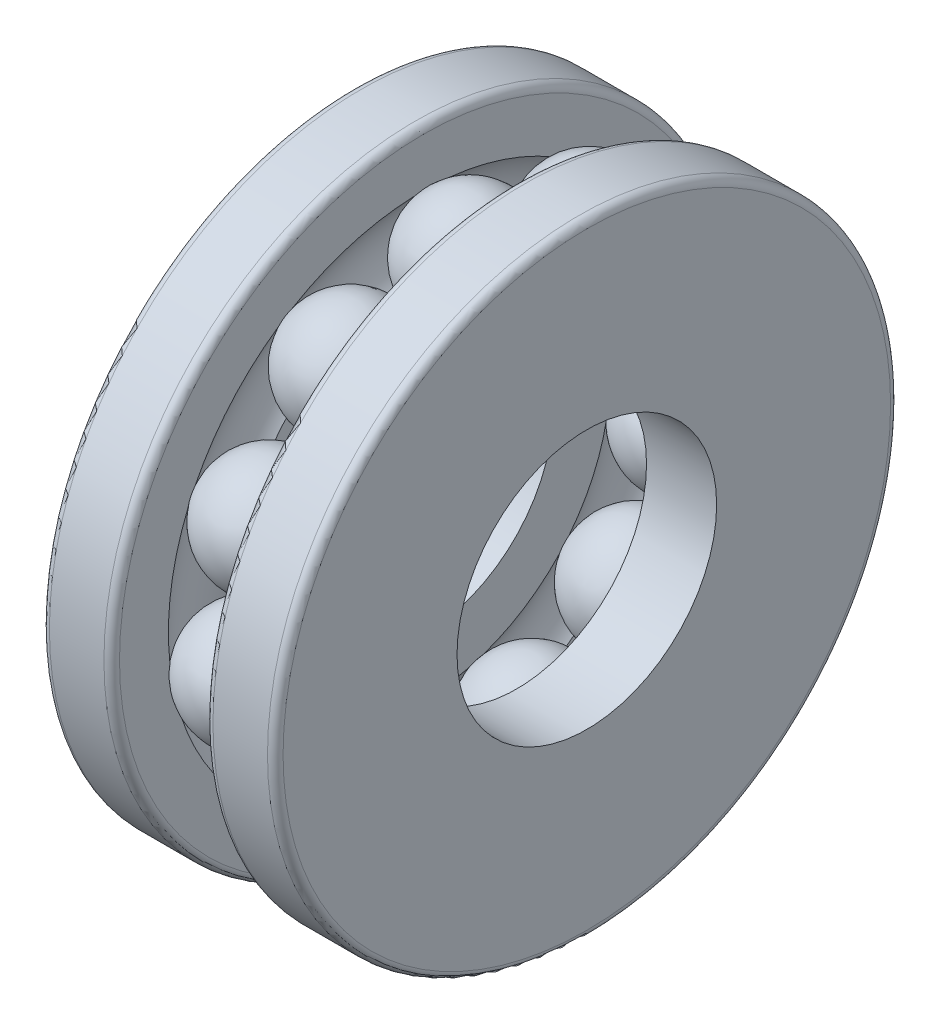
ISO-10303-21;
HEADER;
FILE_DESCRIPTION(('STEP AP214'),'2;1');
FILE_NAME('part.step','',(''),(''),'','','');
FILE_SCHEMA(('AUTOMOTIVE_DESIGN { 1 0 10303 214 1 1 1 1 }'));
ENDSEC;
DATA;
#1=APPLICATION_CONTEXT('core data for automotive mechanical design processes');
#2=APPLICATION_PROTOCOL_DEFINITION('international standard','automotive_design',2000,#1);
#3=PRODUCT_CONTEXT('',#1,'mechanical');
#4=PRODUCT('Part','Part','',(#3));
#5=PRODUCT_RELATED_PRODUCT_CATEGORY('part','',(#4));
#6=PRODUCT_DEFINITION_FORMATION('','',#4);
#7=PRODUCT_DEFINITION_CONTEXT('part definition',#1,'design');
#8=PRODUCT_DEFINITION('design','',#6,#7);
#9=PRODUCT_DEFINITION_SHAPE('','',#8);
#10=(LENGTH_UNIT() NAMED_UNIT(*) SI_UNIT(.MILLI.,.METRE.));
#11=(NAMED_UNIT(*) PLANE_ANGLE_UNIT() SI_UNIT($,.RADIAN.));
#12=(NAMED_UNIT(*) SI_UNIT($,.STERADIAN.) SOLID_ANGLE_UNIT());
#13=UNCERTAINTY_MEASURE_WITH_UNIT(LENGTH_MEASURE(1.E-05),#10,'distance_accuracy_value','');
#14=(GEOMETRIC_REPRESENTATION_CONTEXT(3) GLOBAL_UNCERTAINTY_ASSIGNED_CONTEXT((#13)) GLOBAL_UNIT_ASSIGNED_CONTEXT((#10,
#11,#12)) REPRESENTATION_CONTEXT('',''));
#15=CARTESIAN_POINT('',(0.,0.,0.));
#16=DIRECTION('',(0.,0.,1.));
#17=DIRECTION('',(1.,0.,0.));
#18=AXIS2_PLACEMENT_3D('',#15,#16,#17);
#19=CARTESIAN_POINT('',(0.,0.,0.));
#20=DIRECTION('',(-1.,0.,0.));
#21=DIRECTION('',(0.,0.,1.));
#22=AXIS2_PLACEMENT_3D('',#19,#20,#21);
#23=TOROIDAL_SURFACE('',#22,8.5,2.23);
#24=CARTESIAN_POINT('',(1.8,0.,0.));
#25=DIRECTION('',(-1.,0.,0.));
#26=DIRECTION('',(0.,0.,1.));
#27=AXIS2_PLACEMENT_3D('',#24,#25,#26);
#28=CIRCLE('',#27,9.81639659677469);
#29=CARTESIAN_POINT('',(1.8,9.8111260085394,-0.3216342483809));
#30=VERTEX_POINT('',#29);
#31=CARTESIAN_POINT('',(1.80000000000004,8.42753301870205,-5.03371923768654));
#32=VERTEX_POINT('',#31);
#33=EDGE_CURVE('E334',#30,#32,#28,.T.);
#34=ORIENTED_EDGE('',*,*,#33,.T.);
#35=CARTESIAN_POINT('',(1.79979999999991,8.4277654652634,-5.03386329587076));
#36=CARTESIAN_POINT('',(1.83684498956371,8.38471680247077,-5.00718398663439));
#37=CARTESIAN_POINT('',(1.87173422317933,8.34035780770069,-4.97969638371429));
#38=CARTESIAN_POINT('',(1.93699385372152,8.24929877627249,-4.92327939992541));
#39=CARTESIAN_POINT('',(1.96736446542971,8.20259885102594,-4.89435008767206));
#40=CARTESIAN_POINT('',(2.05131034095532,8.05954057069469,-4.80574445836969));
#41=CARTESIAN_POINT('',(2.09782935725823,7.96009596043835,-4.7441712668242));
#42=CARTESIAN_POINT('',(2.17056560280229,7.75596739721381,-4.61782957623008));
#43=CARTESIAN_POINT('',(2.19677462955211,7.65128134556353,-4.55305979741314));
#44=CARTESIAN_POINT('',(2.22815569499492,7.43963630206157,-4.42216888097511));
#45=CARTESIAN_POINT('',(2.23333226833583,7.33267780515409,-4.35604803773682));
#46=CARTESIAN_POINT('',(2.22250635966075,7.11949644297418,-4.22431975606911));
#47=CARTESIAN_POINT('',(2.20649855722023,7.01327376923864,-4.15871245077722));
#48=CARTESIAN_POINT('',(2.15373773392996,6.80458459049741,-4.02987712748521));
#49=CARTESIAN_POINT('',(2.11698756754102,6.70211757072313,-3.96664878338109));
#50=CARTESIAN_POINT('',(2.03573740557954,6.52924239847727,-3.86002352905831));
#51=CARTESIAN_POINT('',(1.99560868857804,6.45732626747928,-3.81568355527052));
#52=CARTESIAN_POINT('',(1.90517151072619,6.31840420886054,-3.73005966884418));
#53=CARTESIAN_POINT('',(1.85487657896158,6.25139191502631,-3.68877179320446));
#54=CARTESIAN_POINT('',(1.7998,6.18731083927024,-3.64930323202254));
#55=B_SPLINE_CURVE_WITH_KNOTS('',3,(#35,#36,#37,#38,#39,#40,#41,#42,#43,#44,#45,#46,#47,#48,#49,
#50,#51,#52,#53,#54),.UNSPECIFIED.,.F.,.F.,(4,2,2,2,2,2,2,2,2,4),(0.,0.188128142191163,
0.376247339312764,0.75193459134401,1.12777349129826,1.50353135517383,1.87938360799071,
2.25518415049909,2.53507908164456,2.81460395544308),.UNSPECIFIED.);
#56=CARTESIAN_POINT('',(1.8,6.18754369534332,-3.64944665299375));
#57=VERTEX_POINT('',#56);
#58=EDGE_CURVE('E320',#32,#57,#55,.T.);
#59=ORIENTED_EDGE('',*,*,#58,.T.);
#60=CARTESIAN_POINT('',(1.8,0.,0.));
#61=DIRECTION('',(-1.,0.,0.));
#62=DIRECTION('',(0.,0.,1.));
#63=AXIS2_PLACEMENT_3D('',#60,#61,#62);
#64=CIRCLE('',#63,7.18360340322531);
#65=CARTESIAN_POINT('',(1.8,7.17833281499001,-0.27512879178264));
#66=VERTEX_POINT('',#65);
#67=EDGE_CURVE('E331',#66,#57,#64,.T.);
#68=ORIENTED_EDGE('',*,*,#67,.F.);
#69=CARTESIAN_POINT('',(1.7998,9.81139943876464,-0.321638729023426));
#70=CARTESIAN_POINT('',(1.8368449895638,9.76076067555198,-0.320808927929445));
#71=CARTESIAN_POINT('',(1.87173422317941,9.70858259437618,-0.319950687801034));
#72=CARTESIAN_POINT('',(1.93699385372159,9.60147753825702,-0.318181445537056));
#73=CARTESIAN_POINT('',(1.96736446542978,9.54655069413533,-0.317270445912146));
#74=CARTESIAN_POINT('',(2.05131034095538,9.37829859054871,-0.314467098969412));
#75=CARTESIAN_POINT('',(2.09782935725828,9.26135148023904,-0.31250194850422));
#76=CARTESIAN_POINT('',(2.17056560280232,9.0213221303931,-0.308427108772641));
#77=CARTESIAN_POINT('',(2.19677462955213,8.89823743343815,-0.306317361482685));
#78=CARTESIAN_POINT('',(2.22815569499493,8.64942532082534,-0.302005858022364));
#79=CARTESIAN_POINT('',(2.23333226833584,8.52369848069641,-0.29980412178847));
#80=CARTESIAN_POINT('',(2.22250635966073,8.27314122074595,-0.29536645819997));
#81=CARTESIAN_POINT('',(2.20649855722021,8.14831103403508,-0.293130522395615));
#82=CARTESIAN_POINT('',(2.15373773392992,7.90309689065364,-0.288687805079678));
#83=CARTESIAN_POINT('',(2.11698756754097,7.78271232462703,-0.286481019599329));
#84=CARTESIAN_POINT('',(2.03573740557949,7.57963451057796,-0.282716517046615));
#85=CARTESIAN_POINT('',(1.99560868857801,7.4951628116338,-0.28113688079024));
#86=CARTESIAN_POINT('',(1.90517151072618,7.33200237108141,-0.278061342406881));
#87=CARTESIAN_POINT('',(1.8548765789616,7.25330613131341,-0.27656533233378));
#88=CARTESIAN_POINT('',(1.79980000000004,7.17805938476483,-0.275123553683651));
#89=B_SPLINE_CURVE_WITH_KNOTS('',3,(#69,#70,#71,#72,#73,#74,#75,#76,#77,#78,#79,#80,#81,#82,#83,
#84,#85,#86,#87,#88),.UNSPECIFIED.,.F.,.F.,(4,2,2,2,2,2,2,2,2,4),(0.,0.188128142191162,
0.376247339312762,0.75193459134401,1.12777349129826,1.50353135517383,1.87938360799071,
2.25518415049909,2.53507908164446,2.81460395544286),.UNSPECIFIED.);
#90=EDGE_CURVE('E421',#30,#66,#89,.T.);
#91=ORIENTED_EDGE('',*,*,#90,.F.);
#92=EDGE_LOOP('',(#34,#59,#68,#91));
#93=FACE_BOUND('',#92,.T.);
#94=ADVANCED_FACE('F39',(#93),#23,.F.);
#95=CARTESIAN_POINT('',(0.,0.,0.));
#96=DIRECTION('',(-1.,0.,0.));
#97=DIRECTION('',(0.,0.,1.));
#98=AXIS2_PLACEMENT_3D('',#95,#96,#97);
#99=TOROIDAL_SURFACE('',#98,8.5,2.23);
#100=CARTESIAN_POINT('',(-1.8,0.,0.));
#101=DIRECTION('',(-1.,0.,0.));
#102=DIRECTION('',(0.,0.,1.));
#103=AXIS2_PLACEMENT_3D('',#100,#101,#102);
#104=CIRCLE('',#103,9.81639659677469);
#105=CARTESIAN_POINT('',(-1.8,8.07975581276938,-5.57487113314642));
#106=VERTEX_POINT('',#105);
#107=CARTESIAN_POINT('',(-1.8,4.3682578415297,-8.79090243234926));
#108=VERTEX_POINT('',#107);
#109=EDGE_CURVE('E1005',#106,#108,#104,.T.);
#110=ORIENTED_EDGE('',*,*,#109,.F.);
#111=CARTESIAN_POINT('',(-1.7998,8.07998341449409,-5.57502273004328));
#112=CARTESIAN_POINT('',(-1.8368449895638,8.03783200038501,-5.54694727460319));
#113=CARTESIAN_POINT('',(-1.87173422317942,7.99440100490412,-5.51801567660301));
#114=CARTESIAN_POINT('',(-1.93699385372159,7.90525502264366,-5.45862193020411));
#115=CARTESIAN_POINT('',(-1.96736446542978,7.85954014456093,-5.42815985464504));
#116=CARTESIAN_POINT('',(-2.05131034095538,7.71951307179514,-5.33483757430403));
#117=CARTESIAN_POINT('',(-2.09782935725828,7.62219334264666,-5.26995800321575));
#118=CARTESIAN_POINT('',(-2.17056560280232,7.42247082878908,-5.13676036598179));
#119=CARTESIAN_POINT('',(-2.19677462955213,7.32006600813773,-5.06844092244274));
#120=CARTESIAN_POINT('',(-2.22815569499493,7.11308291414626,-4.93029587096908));
#121=CARTESIAN_POINT('',(-2.23333226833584,7.00850511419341,-4.86047059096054));
#122=CARTESIAN_POINT('',(-2.22250635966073,6.80012211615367,-4.72127590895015));
#123=CARTESIAN_POINT('',(-2.20649855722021,6.69631711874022,-4.65190662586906));
#124=CARTESIAN_POINT('',(-2.15373773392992,6.49243176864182,-4.51559639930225));
#125=CARTESIAN_POINT('',(-2.11698756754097,6.39235090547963,-4.44865512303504));
#126=CARTESIAN_POINT('',(-2.03573740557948,6.22354622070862,-4.33569606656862));
#127=CARTESIAN_POINT('',(-1.995608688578,6.15333812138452,-4.28869834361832));
#128=CARTESIAN_POINT('',(-1.90517151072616,6.0177415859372,-4.19789984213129));
#129=CARTESIAN_POINT('',(-1.85487657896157,5.95234690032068,-4.15409491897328));
#130=CARTESIAN_POINT('',(-1.7998,5.88982479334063,-4.1122005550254));
#131=B_SPLINE_CURVE_WITH_KNOTS('',3,(#111,#112,#113,#114,#115,#116,#117,#118,#119,#120,#121,
#122,#123,#124,#125,#126,#127,#128,#129,#130),.UNSPECIFIED.,.F.,.F.,(4,2,2,2,2,2,2,2,2,4),(0.,
0.188128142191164,0.376247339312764,0.75193459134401,1.12777349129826,1.50353135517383,
1.87938360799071,2.25518415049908,2.53507908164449,2.81460395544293),.UNSPECIFIED.);
#132=CARTESIAN_POINT('',(-1.79999999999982,5.89005198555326,-4.11235278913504));
#133=VERTEX_POINT('',#132);
#134=EDGE_CURVE('E54',#106,#133,#131,.T.);
#135=ORIENTED_EDGE('',*,*,#134,.T.);
#136=CARTESIAN_POINT('',(-1.8,0.,0.));
#137=DIRECTION('',(-1.,0.,0.));
#138=DIRECTION('',(0.,0.,1.));
#139=AXIS2_PLACEMENT_3D('',#136,#137,#138);
#140=CIRCLE('',#139,7.18360340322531);
#141=CARTESIAN_POINT('',(-1.80000000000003,3.23225317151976,-6.4153485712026));
#142=VERTEX_POINT('',#141);
#143=EDGE_CURVE('E1056',#133,#142,#140,.T.);
#144=ORIENTED_EDGE('',*,*,#143,.T.);
#145=CARTESIAN_POINT('',(-1.7998,3.23213481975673,-6.41510202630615));
#146=CARTESIAN_POINT('',(-1.83684619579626,3.25405409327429,-6.46076315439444));
#147=CARTESIAN_POINT('',(-1.87173650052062,3.2766349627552,-6.50781448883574));
#148=CARTESIAN_POINT('',(-1.93699800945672,3.3229760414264,-6.6044008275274));
#149=CARTESIAN_POINT('',(-1.96736942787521,3.34673619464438,-6.65393571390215));
#150=CARTESIAN_POINT('',(-2.05131746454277,3.41950203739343,-6.80567926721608));
#151=CARTESIAN_POINT('',(-2.09783738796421,3.47005805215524,-6.91116209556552));
#152=CARTESIAN_POINT('',(-2.17057394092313,3.57377530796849,-7.12768438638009));
#153=CARTESIAN_POINT('',(-2.196782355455,3.6269375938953,-7.23872607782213));
#154=CARTESIAN_POINT('',(-2.22815990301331,3.73435721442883,-7.46321623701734));
#155=CARTESIAN_POINT('',(-2.23333358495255,3.78861430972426,-7.57666417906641));
#156=CARTESIAN_POINT('',(-2.22249902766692,3.89669629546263,-7.80276806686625));
#157=CARTESIAN_POINT('',(-2.20648622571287,3.95052109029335,-7.91542383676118));
#158=CARTESIAN_POINT('',(-2.15371323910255,4.05621485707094,-8.1367408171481));
#159=CARTESIAN_POINT('',(-2.11695592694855,4.10808409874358,-8.24540257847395));
#160=CARTESIAN_POINT('',(-2.03570012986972,4.19554481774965,-8.42869765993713));
#161=CARTESIAN_POINT('',(-1.99557616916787,4.23191033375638,-8.50493410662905));
#162=CARTESIAN_POINT('',(-1.90515241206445,4.30213703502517,-8.65219565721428));
#163=CARTESIAN_POINT('',(-1.85486613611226,4.33600146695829,-8.72322751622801));
#164=CARTESIAN_POINT('',(-1.79979999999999,4.36837550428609,-8.79114929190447));
#165=B_SPLINE_CURVE_WITH_KNOTS('',3,(#145,#146,#147,#148,#149,#150,#151,#152,#153,#154,#155,
#156,#157,#158,#159,#160,#161,#162,#163,#164),.UNSPECIFIED.,.F.,.F.,(4,2,2,2,2,2,2,2,2,4),(0.,
0.188140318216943,0.376271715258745,0.751984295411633,1.12784875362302,1.5036319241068,
1.87949603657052,2.25530811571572,2.53514090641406,2.81460381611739),.UNSPECIFIED.);
#166=EDGE_CURVE('E624',#142,#108,#165,.T.);
#167=ORIENTED_EDGE('',*,*,#166,.T.);
#168=EDGE_LOOP('',(#110,#135,#144,#167));
#169=FACE_BOUND('',#168,.T.);
#170=ADVANCED_FACE('F906',(#169),#99,.F.);
#171=CARTESIAN_POINT('',(-1.8,3.7831202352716,-9.05812582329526));
#172=VERTEX_POINT('',#171);
#173=CARTESIAN_POINT('',(-1.8,-1.07790833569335,-9.75703621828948));
#174=VERTEX_POINT('',#173);
#175=EDGE_CURVE('E1011',#172,#174,#104,.T.);
#176=ORIENTED_EDGE('',*,*,#175,.F.);
#177=CARTESIAN_POINT('',(-1.7998,3.78322974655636,-9.05837640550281));
#178=CARTESIAN_POINT('',(-1.83684498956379,3.76294845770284,-9.01196905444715));
#179=CARTESIAN_POINT('',(-1.87173422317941,3.74205358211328,-8.96414967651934));
#180=CARTESIAN_POINT('',(-1.93699385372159,3.69916989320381,-8.86598852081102));
#181=CARTESIAN_POINT('',(-1.96736446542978,3.67718113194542,-8.81564686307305));
#182=CARTESIAN_POINT('',(-2.05131034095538,3.60983669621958,-8.66143481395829));
#183=CARTESIAN_POINT('',(-2.09782935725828,3.56304267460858,-8.55423962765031));
#184=CARTESIAN_POINT('',(-2.17056560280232,3.46703748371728,-8.33420850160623));
#185=CARTESIAN_POINT('',(-2.19677462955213,3.41782534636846,-8.22137030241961));
#186=CARTESIAN_POINT('',(-2.22815569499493,3.31838694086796,-7.99325178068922));
#187=CARTESIAN_POINT('',(-2.23333226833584,3.2681608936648,-7.87797198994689));
#188=CARTESIAN_POINT('',(-2.22250635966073,3.16811228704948,-7.64821361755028));
#189=CARTESIAN_POINT('',(-2.20649855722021,3.11828983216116,-7.53373524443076));
#190=CARTESIAN_POINT('',(-2.15373773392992,3.020465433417,-7.30883504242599));
#191=CARTESIAN_POINT('',(-2.11698756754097,2.97246324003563,-7.19841265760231));
#192=CARTESIAN_POINT('',(-2.03573740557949,2.89152597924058,-7.01212274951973));
#193=CARTESIAN_POINT('',(-1.995608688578,2.85787205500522,-6.93462838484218));
#194=CARTESIAN_POINT('',(-1.90517151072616,2.79289036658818,-6.78493480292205));
#195=CARTESIAN_POINT('',(-1.85487657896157,2.76155958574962,-6.71272872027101));
#196=CARTESIAN_POINT('',(-1.7998,2.73161244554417,-6.64368293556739));
#197=B_SPLINE_CURVE_WITH_KNOTS('',3,(#177,#178,#179,#180,#181,#182,#183,#184,#185,#186,#187,
#188,#189,#190,#191,#192,#193,#194,#195,#196),.UNSPECIFIED.,.F.,.F.,(4,2,2,2,2,2,2,2,2,4),(0.,
0.188128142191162,0.376247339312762,0.751934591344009,1.12777349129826,1.50353135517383,
1.87938360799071,2.25518415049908,2.53507908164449,2.81460395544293),.UNSPECIFIED.);
#198=CARTESIAN_POINT('',(-1.79999999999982,2.7317212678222,-6.64393383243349));
#199=VERTEX_POINT('',#198);
#200=EDGE_CURVE('E633',#172,#199,#197,.T.);
#201=ORIENTED_EDGE('',*,*,#200,.T.);
#202=CARTESIAN_POINT('',(-1.80000000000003,-0.74925489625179,-7.14442264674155));
#203=VERTEX_POINT('',#202);
#204=EDGE_CURVE('E1057',#199,#203,#140,.T.);
#205=ORIENTED_EDGE('',*,*,#204,.T.);
#206=CARTESIAN_POINT('',(-1.79980000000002,-0.749221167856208,-7.14415125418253));
#207=CARTESIAN_POINT('',(-1.83684619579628,-0.755467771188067,-7.19441429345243));
#208=CARTESIAN_POINT('',(-1.87173650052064,-0.761909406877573,-7.24620453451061));
#209=CARTESIAN_POINT('',(-1.93699800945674,-0.775143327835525,-7.35251201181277));
#210=CARTESIAN_POINT('',(-1.96736942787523,-0.781935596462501,-7.40702911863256));
#211=CARTESIAN_POINT('',(-2.05131746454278,-0.802759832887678,-7.57402410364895));
#212=CARTESIAN_POINT('',(-2.09783738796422,-0.817257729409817,-7.69009455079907));
#213=CARTESIAN_POINT('',(-2.17057394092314,-0.84706600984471,-7.92831847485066));
#214=CARTESIAN_POINT('',(-2.19678235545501,-0.862376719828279,-8.0504743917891));
#215=CARTESIAN_POINT('',(-2.22815990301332,-0.893378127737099,-8.29740296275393));
#216=CARTESIAN_POINT('',(-2.23333358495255,-0.909068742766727,-8.42217504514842));
#217=CARTESIAN_POINT('',(-2.22249902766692,-0.940385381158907,-8.67081927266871));
#218=CARTESIAN_POINT('',(-2.20648622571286,-0.956011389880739,-8.7946912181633));
#219=CARTESIAN_POINT('',(-2.15371323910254,-0.986749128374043,-9.03801727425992));
#220=CARTESIAN_POINT('',(-2.11695592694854,-1.00186092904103,-9.15747199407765));
#221=CARTESIAN_POINT('',(-2.03570012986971,-1.02738109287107,-9.35895446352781));
#222=CARTESIAN_POINT('',(-1.99557616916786,-1.0380050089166,-9.44274932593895));
#223=CARTESIAN_POINT('',(-1.90515241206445,-1.05854215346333,-9.60460104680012));
#224=CARTESIAN_POINT('',(-1.85486613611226,-1.06845630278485,-9.68266534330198));
#225=CARTESIAN_POINT('',(-1.7998,-1.07794281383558,-9.75730750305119));
#226=B_SPLINE_CURVE_WITH_KNOTS('',3,(#206,#207,#208,#209,#210,#211,#212,#213,#214,#215,#216,
#217,#218,#219,#220,#221,#222,#223,#224,#225),.UNSPECIFIED.,.F.,.F.,(4,2,2,2,2,2,2,2,2,4),(0.,
0.188140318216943,0.376271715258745,0.751984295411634,1.12784875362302,1.5036319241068,
1.87949603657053,2.25530811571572,2.53514090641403,2.81460381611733),.UNSPECIFIED.);
#227=EDGE_CURVE('E661',#203,#174,#226,.T.);
#228=ORIENTED_EDGE('',*,*,#227,.T.);
#229=EDGE_LOOP('',(#176,#201,#205,#228));
#230=FACE_BOUND('',#229,.T.);
#231=ADVANCED_FACE('F912',(#230),#99,.F.);
#232=CARTESIAN_POINT('',(1.8,5.89005198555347,-4.11235278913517));
#233=VERTEX_POINT('',#232);
#234=CARTESIAN_POINT('',(1.8,3.23225317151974,-6.41534857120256));
#235=VERTEX_POINT('',#234);
#236=EDGE_CURVE('E342',#233,#235,#64,.T.);
#237=ORIENTED_EDGE('',*,*,#236,.F.);
#238=CARTESIAN_POINT('',(1.7998,5.88982479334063,-4.1122005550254));
#239=CARTESIAN_POINT('',(1.83684619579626,5.93190171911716,-4.1403949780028));
#240=CARTESIAN_POINT('',(1.87173650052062,5.97526054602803,-4.16944210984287));
#241=CARTESIAN_POINT('',(1.93699800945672,6.06426875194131,-4.22905717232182));
#242=CARTESIAN_POINT('',(1.96736942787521,6.10991802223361,-4.25962503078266));
#243=CARTESIAN_POINT('',(2.05131746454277,6.24976138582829,-4.35324558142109));
#244=CARTESIAN_POINT('',(2.09783738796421,6.34697568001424,-4.41829878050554));
#245=CARTESIAN_POINT('',(2.17057394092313,6.54653358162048,-4.55177467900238));
#246=CARTESIAN_POINT('',(2.196782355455,6.64887924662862,-4.6201987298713));
#247=CARTESIAN_POINT('',(2.22815990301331,6.8557970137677,-4.75847325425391));
#248=CARTESIAN_POINT('',(2.23333358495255,6.96036862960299,-4.82832341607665));
#249=CARTESIAN_POINT('',(2.22249902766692,7.1687894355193,-4.96748322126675));
#250=CARTESIAN_POINT('',(2.20648622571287,7.27263846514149,-5.03679274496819));
#251=CARTESIAN_POINT('',(2.15371323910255,7.47666096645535,-5.1729073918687));
#252=CARTESIAN_POINT('',(2.11695592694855,7.57683494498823,-5.23971286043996));
#253=CARTESIAN_POINT('',(2.03570012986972,7.74581738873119,-5.35236896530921));
#254=CARTESIAN_POINT('',(1.99557616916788,7.81610250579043,-5.39921391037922));
#255=CARTESIAN_POINT('',(1.90515241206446,7.95187084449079,-5.48968330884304));
#256=CARTESIAN_POINT('',(1.85486613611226,8.01736029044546,-5.53331193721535));
#257=CARTESIAN_POINT('',(1.7998,8.07998341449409,-5.57502273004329));
#258=B_SPLINE_CURVE_WITH_KNOTS('',3,(#238,#239,#240,#241,#242,#243,#244,#245,#246,#247,#248,
#249,#250,#251,#252,#253,#254,#255,#256,#257),.UNSPECIFIED.,.F.,.F.,(4,2,2,2,2,2,2,2,2,4),(0.,
0.188140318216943,0.376271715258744,0.751984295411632,1.12784875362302,1.5036319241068,
1.87949603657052,2.25530811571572,2.53514090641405,2.81460381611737),.UNSPECIFIED.);
#259=CARTESIAN_POINT('',(1.79999999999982,8.07975581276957,-5.57487113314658));
#260=VERTEX_POINT('',#259);
#261=EDGE_CURVE('E62',#233,#260,#258,.T.);
#262=ORIENTED_EDGE('',*,*,#261,.T.);
#263=CARTESIAN_POINT('',(1.80000000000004,4.36825784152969,-8.7909024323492));
#264=VERTEX_POINT('',#263);
#265=EDGE_CURVE('E1022',#260,#264,#28,.T.);
#266=ORIENTED_EDGE('',*,*,#265,.T.);
#267=CARTESIAN_POINT('',(1.79979999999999,4.36837550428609,-8.79114929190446));
#268=CARTESIAN_POINT('',(1.83684498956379,4.34658458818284,-8.74543136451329));
#269=CARTESIAN_POINT('',(1.87173422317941,4.32412834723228,-8.69832503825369));
#270=CARTESIAN_POINT('',(1.93699385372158,4.27802593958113,-8.60163382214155));
#271=CARTESIAN_POINT('',(1.96736446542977,4.25437982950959,-8.55204905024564));
#272=CARTESIAN_POINT('',(2.05131034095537,4.18193536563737,-8.40016610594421));
#273=CARTESIAN_POINT('',(2.09782935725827,4.13156621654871,-8.29460362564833));
#274=CARTESIAN_POINT('',(2.17056560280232,4.02814781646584,-8.0779579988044));
#275=CARTESIAN_POINT('',(2.19677462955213,3.97509749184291,-7.96687264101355));
#276=CARTESIAN_POINT('',(2.22815569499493,3.86781532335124,-7.74233624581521));
#277=CARTESIAN_POINT('',(2.23333226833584,3.81358373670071,-7.62888572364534));
#278=CARTESIAN_POINT('',(2.22250635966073,3.70546184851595,-7.40281429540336));
#279=CARTESIAN_POINT('',(2.20649855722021,3.65157163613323,-7.29019360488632));
#280=CARTESIAN_POINT('',(2.15373773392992,3.54566476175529,-7.06898454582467));
#281=CARTESIAN_POINT('',(2.11698756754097,3.4936478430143,-6.96039562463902));
#282=CARTESIAN_POINT('',(2.03573740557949,3.40586195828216,-6.77723337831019));
#283=CARTESIAN_POINT('',(1.995608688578,3.36933425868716,-6.7010514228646));
#284=CARTESIAN_POINT('',(1.90517151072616,3.29875735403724,-6.55391309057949));
#285=CARTESIAN_POINT('',(1.85487657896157,3.26470493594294,-6.48294993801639));
#286=CARTESIAN_POINT('',(1.7998,3.23213481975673,-6.41510202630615));
#287=B_SPLINE_CURVE_WITH_KNOTS('',3,(#267,#268,#269,#270,#271,#272,#273,#274,#275,#276,#277,
#278,#279,#280,#281,#282,#283,#284,#285,#286),.UNSPECIFIED.,.F.,.F.,(4,2,2,2,2,2,2,2,2,4),(0.,
0.188128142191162,0.376247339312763,0.751934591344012,1.12777349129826,1.50353135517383,
1.87938360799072,2.25518415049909,2.5350790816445,2.81460395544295),.UNSPECIFIED.);
#288=EDGE_CURVE('E566',#264,#235,#287,.T.);
#289=ORIENTED_EDGE('',*,*,#288,.T.);
#290=EDGE_LOOP('',(#237,#262,#266,#289));
#291=FACE_BOUND('',#290,.T.);
#292=ADVANCED_FACE('F907',(#291),#23,.F.);
#293=CARTESIAN_POINT('',(-1.8,7.17833281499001,-0.275128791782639));
#294=VERTEX_POINT('',#293);
#295=CARTESIAN_POINT('',(-1.80000000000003,6.18754369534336,-3.64944665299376));
#296=VERTEX_POINT('',#295);
#297=EDGE_CURVE('E1010',#294,#296,#140,.T.);
#298=ORIENTED_EDGE('',*,*,#297,.T.);
#299=CARTESIAN_POINT('',(-1.7998,6.18731083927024,-3.64930323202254));
#300=CARTESIAN_POINT('',(-1.83684619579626,6.23043677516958,-3.6758653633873));
#301=CARTESIAN_POINT('',(-1.87173650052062,6.27487088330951,-3.70323932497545));
#302=CARTESIAN_POINT('',(-1.93699800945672,6.36607399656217,-3.75943904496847));
#303=CARTESIAN_POINT('',(-1.96736942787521,6.41284289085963,-3.78826473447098));
#304=CARTESIAN_POINT('',(-2.05131746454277,6.55609617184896,-3.87657935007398));
#305=CARTESIAN_POINT('',(-2.09783738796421,6.65565492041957,-3.93798450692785));
#306=CARTESIAN_POINT('',(-2.17057394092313,6.85996821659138,-4.06406086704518));
#307=CARTESIAN_POINT('',(-2.196782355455,6.96472484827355,-4.12873338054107));
#308=CARTESIAN_POINT('',(-2.22815990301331,7.17646052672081,-4.25951108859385));
#309=CARTESIAN_POINT('',(-2.23333358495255,7.28343908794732,-4.32561597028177));
#310=CARTESIAN_POINT('',(-2.22249902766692,7.49660443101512,-4.45739313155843));
#311=CARTESIAN_POINT('',(-2.20648622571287,7.60279103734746,-4.5230653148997));
#312=CARTESIAN_POINT('',(-2.15371323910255,7.81135928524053,-4.65210664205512));
#313=CARTESIAN_POINT('',(-2.11695592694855,7.91374145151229,-4.71547610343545));
#314=CARTESIAN_POINT('',(-2.03570012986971,8.08641489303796,-4.82238890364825));
#315=CARTESIAN_POINT('',(-1.99557616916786,8.1582240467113,-4.86686240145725));
#316=CARTESIAN_POINT('',(-1.90515241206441,8.29691811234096,-4.95277927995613));
#317=CARTESIAN_POINT('',(-1.8548661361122,8.36380940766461,-4.99422658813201));
#318=CARTESIAN_POINT('',(-1.79979999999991,8.4277654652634,-5.03386329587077));
#319=B_SPLINE_CURVE_WITH_KNOTS('',3,(#299,#300,#301,#302,#303,#304,#305,#306,#307,#308,#309,
#310,#311,#312,#313,#314,#315,#316,#317,#318),.UNSPECIFIED.,.F.,.F.,(4,2,2,2,2,2,2,2,2,4),(0.,
0.188140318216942,0.376271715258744,0.751984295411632,1.12784875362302,1.5036319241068,
1.87949603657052,2.25530811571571,2.53514090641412,2.81460381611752),.UNSPECIFIED.);
#320=CARTESIAN_POINT('',(-1.8,8.42753301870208,-5.03371923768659));
#321=VERTEX_POINT('',#320);
#322=EDGE_CURVE('E593',#296,#321,#319,.T.);
#323=ORIENTED_EDGE('',*,*,#322,.T.);
#324=CARTESIAN_POINT('',(-1.8,9.8111260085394,-0.321634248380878));
#325=VERTEX_POINT('',#324);
#326=EDGE_CURVE('E999',#325,#321,#104,.T.);
#327=ORIENTED_EDGE('',*,*,#326,.F.);
#328=CARTESIAN_POINT('',(-1.79980000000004,7.17805938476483,-0.275123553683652));
#329=CARTESIAN_POINT('',(-1.83684619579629,7.22869980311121,-0.276093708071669));
#330=CARTESIAN_POINT('',(-1.87173650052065,7.28087963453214,-0.277088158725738));
#331=CARTESIAN_POINT('',(-1.93699800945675,7.38798843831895,-0.279118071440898));
#332=CARTESIAN_POINT('',(-1.96736942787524,7.44291728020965,-0.280153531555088));
#333=CARTESIAN_POINT('',(-2.05131746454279,7.61117609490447,-0.283307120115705));
#334=CARTESIAN_POINT('',(-2.09783738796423,7.72812837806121,-0.285475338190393));
#335=CARTESIAN_POINT('',(-2.17057394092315,7.96816968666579,-0.289873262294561));
#336=CARTESIAN_POINT('',(-2.19678235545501,8.09126117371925,-0.292102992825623));
#337=CARTESIAN_POINT('',(-2.22815990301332,8.34008832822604,-0.29655873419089));
#338=CARTESIAN_POINT('',(-2.23333358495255,8.46582341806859,-0.298784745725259));
#339=CARTESIAN_POINT('',(-2.22249902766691,8.71639362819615,-0.30317262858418));
#340=CARTESIAN_POINT('',(-2.20648622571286,8.84122854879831,-0.305334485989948));
#341=CARTESIAN_POINT('',(-2.15371323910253,9.08645233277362,-0.309538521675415));
#342=CARTESIAN_POINT('',(-2.11695592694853,9.20684180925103,-0.311580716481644));
#343=CARTESIAN_POINT('',(-2.0357001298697,9.4099053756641,-0.314994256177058));
#344=CARTESIAN_POINT('',(-1.99557616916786,9.49435926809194,-0.316403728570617));
#345=CARTESIAN_POINT('',(-1.90515241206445,9.65748631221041,-0.31910952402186));
#346=CARTESIAN_POINT('',(-1.85486613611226,9.7361669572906,-0.320405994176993));
#347=CARTESIAN_POINT('',(-1.7998,9.81139943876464,-0.321638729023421));
#348=B_SPLINE_CURVE_WITH_KNOTS('',3,(#328,#329,#330,#331,#332,#333,#334,#335,#336,#337,#338,
#339,#340,#341,#342,#343,#344,#345,#346,#347),.UNSPECIFIED.,.F.,.F.,(4,2,2,2,2,2,2,2,2,4),(0.,
0.188140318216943,0.376271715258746,0.751984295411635,1.12784875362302,1.50363192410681,
1.87949603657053,2.25530811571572,2.53514090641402,2.8146038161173),.UNSPECIFIED.);
#349=EDGE_CURVE('E874',#294,#325,#348,.T.);
#350=ORIENTED_EDGE('',*,*,#349,.F.);
#351=EDGE_LOOP('',(#298,#323,#327,#350));
#352=FACE_BOUND('',#351,.T.);
#353=ADVANCED_FACE('F915',(#352),#99,.F.);
#354=CARTESIAN_POINT('',(1.8,2.7317212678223,-6.64393383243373));
#355=VERTEX_POINT('',#354);
#356=CARTESIAN_POINT('',(1.8,-0.749254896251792,-7.14442264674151));
#357=VERTEX_POINT('',#356);
#358=EDGE_CURVE('E347',#355,#357,#64,.T.);
#359=ORIENTED_EDGE('',*,*,#358,.F.);
#360=CARTESIAN_POINT('',(1.7998,2.73161244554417,-6.64368293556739));
#361=CARTESIAN_POINT('',(1.83684619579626,2.75176675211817,-6.69015009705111));
#362=CARTESIAN_POINT('',(1.87173650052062,2.7725384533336,-6.73802765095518));
#363=CARTESIAN_POINT('',(1.93699800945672,2.81518658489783,-6.83630050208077));
#364=CARTESIAN_POINT('',(1.96736942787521,2.83706296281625,-6.88669567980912));
#365=CARTESIAN_POINT('',(2.05131746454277,2.90409159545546,-7.04105932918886));
#366=CARTESIAN_POINT('',(2.09783738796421,2.95070304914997,-7.14834357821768));
#367=CARTESIAN_POINT('',(2.17057394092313,3.04641932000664,-7.36851979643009));
#368=CARTESIAN_POINT('',(2.196782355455,3.0955251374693,-7.48141401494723));
#369=CARTESIAN_POINT('',(2.22815990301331,3.1948385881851,-7.70960613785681));
#370=CARTESIAN_POINT('',(2.23333358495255,3.24504598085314,-7.82490351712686));
#371=CARTESIAN_POINT('',(2.22249902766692,3.34514524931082,-8.05465298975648));
#372=CARTESIAN_POINT('',(2.20648622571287,3.39503705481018,-8.16910489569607));
#373=CARTESIAN_POINT('',(2.15371323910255,3.49308257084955,-8.39391471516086));
#374=CARTESIAN_POINT('',(2.11695592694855,3.54123652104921,-8.50427319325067));
#375=CARTESIAN_POINT('',(2.03570012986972,3.62248711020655,-8.69040434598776));
#376=CARTESIAN_POINT('',(1.99557616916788,3.65628842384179,-8.76781182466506));
#377=CARTESIAN_POINT('',(1.90515241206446,3.7215925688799,-8.91732143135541));
#378=CARTESIAN_POINT('',(1.85486613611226,3.75309837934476,-8.98943043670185));
#379=CARTESIAN_POINT('',(1.7998,3.78322974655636,-9.05837640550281));
#380=B_SPLINE_CURVE_WITH_KNOTS('',3,(#360,#361,#362,#363,#364,#365,#366,#367,#368,#369,#370,
#371,#372,#373,#374,#375,#376,#377,#378,#379),.UNSPECIFIED.,.F.,.F.,(4,2,2,2,2,2,2,2,2,4),(0.,
0.188140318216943,0.376271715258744,0.751984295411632,1.12784875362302,1.5036319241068,
1.87949603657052,2.25530811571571,2.53514090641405,2.81460381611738),.UNSPECIFIED.);
#381=CARTESIAN_POINT('',(1.79999999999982,3.78312023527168,-9.0581258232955));
#382=VERTEX_POINT('',#381);
#383=EDGE_CURVE('E558',#355,#382,#380,.T.);
#384=ORIENTED_EDGE('',*,*,#383,.T.);
#385=CARTESIAN_POINT('',(1.80000000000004,-1.07790833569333,-9.75703621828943));
#386=VERTEX_POINT('',#385);
#387=EDGE_CURVE('E1023',#382,#386,#28,.T.);
#388=ORIENTED_EDGE('',*,*,#387,.T.);
#389=CARTESIAN_POINT('',(1.7998,-1.07794281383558,-9.75730750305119));
#390=CARTESIAN_POINT('',(1.8368449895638,-1.07155752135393,-9.70706607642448));
#391=CARTESIAN_POINT('',(1.87173422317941,-1.06498131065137,-9.6552969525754));
#392=CARTESIAN_POINT('',(1.93699385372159,-1.05148990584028,-9.54903028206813));
#393=CARTESIAN_POINT('',(1.96736446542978,-1.04457472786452,-9.49453286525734));
#394=CARTESIAN_POINT('',(2.05131034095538,-1.0234047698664,-9.32759436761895));
#395=CARTESIAN_POINT('',(2.09782935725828,-1.00870660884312,-9.21155794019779));
#396=CARTESIAN_POINT('',(2.17056560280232,-0.97858023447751,-8.97339183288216));
#397=CARTESIAN_POINT('',(2.19677462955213,-0.963151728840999,-8.85125971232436));
#398=CARTESIAN_POINT('',(2.22815569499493,-0.932009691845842,-8.60436655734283));
#399=CARTESIAN_POINT('',(2.23333226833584,-0.916296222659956,-8.47960609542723));
#400=CARTESIAN_POINT('',(2.22250635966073,-0.885030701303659,-8.23096760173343));
#401=CARTESIAN_POINT('',(2.20649855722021,-0.869478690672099,-8.10708979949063));
#402=CARTESIAN_POINT('',(2.15373773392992,-0.838978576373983,-7.8637393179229));
#403=CARTESIAN_POINT('',(2.11698756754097,-0.824030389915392,-7.74426603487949));
#404=CARTESIAN_POINT('',(2.03573740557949,-0.798855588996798,-7.54271951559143));
#405=CARTESIAN_POINT('',(1.99560868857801,-0.78839757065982,-7.45888281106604));
#406=CARTESIAN_POINT('',(1.90517151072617,-0.768221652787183,-7.2969454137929));
#407=CARTESIAN_POINT('',(1.85487657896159,-0.758502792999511,-7.21883728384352));
#408=CARTESIAN_POINT('',(1.79980000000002,-0.74922116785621,-7.14415125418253));
#409=B_SPLINE_CURVE_WITH_KNOTS('',3,(#389,#390,#391,#392,#393,#394,#395,#396,#397,#398,#399,
#400,#401,#402,#403,#404,#405,#406,#407,#408),.UNSPECIFIED.,.F.,.F.,(4,2,2,2,2,2,2,2,2,4),(0.,
0.188128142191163,0.376247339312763,0.751934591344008,1.12777349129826,1.50353135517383,
1.87938360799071,2.25518415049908,2.53507908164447,2.81460395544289),.UNSPECIFIED.);
#410=EDGE_CURVE('E550',#386,#357,#409,.T.);
#411=ORIENTED_EDGE('',*,*,#410,.T.);
#412=EDGE_LOOP('',(#359,#384,#388,#411));
#413=FACE_BOUND('',#412,.T.);
#414=ADVANCED_FACE('F916',(#413),#23,.F.);
#415=CARTESIAN_POINT('',(-1.8,-1.71462928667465,-9.66548956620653));
#416=VERTEX_POINT('',#415);
#417=CARTESIAN_POINT('',(-1.8,-6.18184623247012,-7.62537994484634));
#418=VERTEX_POINT('',#417);
#419=EDGE_CURVE('E1093',#416,#418,#104,.T.);
#420=ORIENTED_EDGE('',*,*,#419,.F.);
#421=CARTESIAN_POINT('',(-1.7998,-1.714672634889,-9.66575957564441));
#422=CARTESIAN_POINT('',(-1.8368449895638,-1.70664463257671,-9.61575433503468));
#423=CARTESIAN_POINT('',(-1.87173422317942,-1.69836941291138,-9.56422949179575));
#424=CARTESIAN_POINT('',(-1.93699385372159,-1.68137554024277,-9.45846640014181));
#425=CARTESIAN_POINT('',(-1.96736446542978,-1.67265690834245,-9.40422828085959));
#426=CARTESIAN_POINT('',(-2.05131034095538,-1.64593732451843,-9.23808769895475));
#427=CARTESIAN_POINT('',(-2.09782935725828,-1.62734886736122,-9.12261061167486));
#428=CARTESIAN_POINT('',(-2.17056560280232,-1.58915576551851,-8.88560432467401));
#429=CARTESIAN_POINT('',(-2.19677462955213,-1.5695507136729,-8.76407270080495));
#430=CARTESIAN_POINT('',(-2.22815569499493,-1.52987343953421,-8.51840672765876));
#431=CARTESIAN_POINT('',(-2.23333226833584,-1.50980131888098,-8.39427294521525));
#432=CARTESIAN_POINT('',(-2.22250635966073,-1.46975080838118,-8.14689754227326));
#433=CARTESIAN_POINT('',(-2.20649855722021,-1.44977244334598,-8.02365615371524));
#434=CARTESIAN_POINT('',(-2.15373773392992,-1.4104773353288,-7.78157020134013));
#435=CARTESIAN_POINT('',(-2.11698756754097,-1.39116050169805,-7.6627250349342));
#436=CARTESIAN_POINT('',(-2.03573740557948,-1.35853333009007,-7.46225000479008));
#437=CARTESIAN_POINT('',(-1.995608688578,-1.34494819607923,-7.37886291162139));
#438=CARTESIAN_POINT('',(-1.90517151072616,-1.31868381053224,-7.2178009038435));
#439=CARTESIAN_POINT('',(-1.85487657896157,-1.30600338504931,-7.14011858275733));
#440=CARTESIAN_POINT('',(-1.7998,-1.29386755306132,-7.06584292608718));
#441=B_SPLINE_CURVE_WITH_KNOTS('',3,(#421,#422,#423,#424,#425,#426,#427,#428,#429,#430,#431,
#432,#433,#434,#435,#436,#437,#438,#439,#440),.UNSPECIFIED.,.F.,.F.,(4,2,2,2,2,2,2,2,2,4),(0.,
0.188128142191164,0.376247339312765,0.751934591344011,1.12777349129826,1.50353135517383,
1.87938360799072,2.25518415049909,2.53507908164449,2.81460395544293),.UNSPECIFIED.);
#442=CARTESIAN_POINT('',(-1.79999999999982,-1.29391165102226,-7.06611282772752));
#443=VERTEX_POINT('',#442);
#444=EDGE_CURVE('E652',#416,#443,#441,.T.);
#445=ORIENTED_EDGE('',*,*,#444,.T.);
#446=CARTESIAN_POINT('',(-1.80000000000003,-4.49287982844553,-5.60519301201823));
#447=VERTEX_POINT('',#446);
#448=EDGE_CURVE('E1059',#443,#447,#140,.T.);
#449=ORIENTED_EDGE('',*,*,#448,.T.);
#450=CARTESIAN_POINT('',(-1.7998,-4.4927047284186,-5.60498293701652));
#451=CARTESIAN_POINT('',(-1.83684619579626,-4.52513395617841,-5.64388972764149));
#452=CARTESIAN_POINT('',(-1.87173650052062,-4.55855292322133,-5.68397583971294));
#453=CARTESIAN_POINT('',(-1.93699800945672,-4.6271601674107,-5.7662525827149));
#454=CARTESIAN_POINT('',(-1.96736942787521,-4.66234836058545,-5.80844311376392));
#455=CARTESIAN_POINT('',(-2.05131746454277,-4.77015112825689,-5.93766980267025));
#456=CARTESIAN_POINT('',(-2.09783738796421,-4.84509995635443,-6.02747632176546));
#457=CARTESIAN_POINT('',(-2.17057394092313,-4.99896985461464,-6.2117674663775));
#458=CARTESIAN_POINT('',(-2.196782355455,-5.0778925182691,-6.30625396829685));
#459=CARTESIAN_POINT('',(-2.22815990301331,-5.2374722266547,-6.49722287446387));
#460=CARTESIAN_POINT('',(-2.23333358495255,-5.31812889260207,-6.59370484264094));
#461=CARTESIAN_POINT('',(-2.22249902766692,-5.47890134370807,-6.78594662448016));
#462=CARTESIAN_POINT('',(-2.20648622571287,-5.55901700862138,-6.88170627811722));
#463=CARTESIAN_POINT('',(-2.15371323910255,-5.71642723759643,-7.06978710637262));
#464=CARTESIAN_POINT('',(-2.11695592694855,-5.79372219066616,-7.16210875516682));
#465=CARTESIAN_POINT('',(-2.03570012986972,-5.92412076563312,-7.31780935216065));
#466=CARTESIAN_POINT('',(-1.99557616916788,-5.97836109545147,-7.38255835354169));
#467=CARTESIAN_POINT('',(-1.90515241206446,-6.08314168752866,-7.50761346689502));
#468=CARTESIAN_POINT('',(-1.85486613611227,-6.13368674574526,-7.56792533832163));
#469=CARTESIAN_POINT('',(-1.7998,-6.1820219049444,-7.62558952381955));
#470=B_SPLINE_CURVE_WITH_KNOTS('',3,(#450,#451,#452,#453,#454,#455,#456,#457,#458,#459,#460,
#461,#462,#463,#464,#465,#466,#467,#468,#469),.UNSPECIFIED.,.F.,.F.,(4,2,2,2,2,2,2,2,2,4),(0.,
0.188140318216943,0.376271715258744,0.751984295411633,1.12784875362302,1.5036319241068,
1.87949603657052,2.25530811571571,2.53514090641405,2.81460381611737),.UNSPECIFIED.);
#471=EDGE_CURVE('E691',#447,#418,#470,.T.);
#472=ORIENTED_EDGE('',*,*,#471,.T.);
#473=EDGE_LOOP('',(#420,#445,#449,#472));
#474=FACE_BOUND('',#473,.T.);
#475=ADVANCED_FACE('F922',(#474),#99,.F.);
#476=CARTESIAN_POINT('',(1.8,-4.90873676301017,-5.24485092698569));
#477=VERTEX_POINT('',#476);
#478=CARTESIAN_POINT('',(1.8,-6.81004716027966,-2.28635420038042));
#479=VERTEX_POINT('',#478);
#480=EDGE_CURVE('E938',#477,#479,#64,.T.);
#481=ORIENTED_EDGE('',*,*,#480,.F.);
#482=CARTESIAN_POINT('',(1.79980000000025,-4.90855374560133,-5.24464771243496));
#483=CARTESIAN_POINT('',(1.8368461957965,-4.94244936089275,-5.28228387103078));
#484=CARTESIAN_POINT('',(1.87173650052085,-4.97737143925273,-5.32106752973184));
#485=CARTESIAN_POINT('',(1.93699800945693,-5.04904689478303,-5.40068565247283));
#486=CARTESIAN_POINT('',(1.96736942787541,-5.0858001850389,-5.44152001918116));
#487=CARTESIAN_POINT('',(2.05131746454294,-5.1983695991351,-5.56661638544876));
#488=CARTESIAN_POINT('',(2.09783738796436,-5.27659568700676,-5.65358314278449));
#489=CARTESIAN_POINT('',(2.17057394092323,-5.43711304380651,-5.83211423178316));
#490=CARTESIAN_POINT('',(2.19678235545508,-5.51940594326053,-5.92368040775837));
#491=CARTESIAN_POINT('',(2.22815990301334,-5.6857205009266,-6.10881353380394));
#492=CARTESIAN_POINT('',(2.23333358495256,-5.76974178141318,-6.20238004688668));
#493=CARTESIAN_POINT('',(2.22249902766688,-5.93714651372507,-6.38887492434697));
#494=CARTESIAN_POINT('',(2.2064862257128,-6.02052982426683,-6.48180314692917));
#495=CARTESIAN_POINT('',(2.15371323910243,-6.18429444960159,-6.66437785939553));
#496=CARTESIAN_POINT('',(2.11695592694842,-6.26467617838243,-6.7540248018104));
#497=CARTESIAN_POINT('',(2.03570012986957,-6.40023431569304,-6.90525461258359));
#498=CARTESIAN_POINT('',(1.99557616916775,-6.45660506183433,-6.96815759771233));
#499=CARTESIAN_POINT('',(1.90515241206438,-6.56547546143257,-7.08966887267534));
#500=CARTESIAN_POINT('',(1.85486613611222,-6.61798013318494,-7.14828272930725));
#501=CARTESIAN_POINT('',(1.7998,-6.668178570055,-7.20433237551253));
#502=B_SPLINE_CURVE_WITH_KNOTS('',3,(#482,#483,#484,#485,#486,#487,#488,#489,#490,#491,#492,
#493,#494,#495,#496,#497,#498,#499,#500,#501),.UNSPECIFIED.,.F.,.F.,(4,2,2,2,2,2,2,2,2,4),(0.,
0.188140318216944,0.376271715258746,0.751984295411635,1.12784875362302,1.50363192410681,
1.87949603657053,2.25530811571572,2.53514090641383,2.81460381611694),.UNSPECIFIED.);
#503=CARTESIAN_POINT('',(1.79999999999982,-6.66799612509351,-7.20412866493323));
#504=VERTEX_POINT('',#503);
#505=EDGE_CURVE('E533',#477,#504,#502,.T.);
#506=ORIENTED_EDGE('',*,*,#505,.T.);
#507=CARTESIAN_POINT('',(1.80000000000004,-9.32309162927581,-3.07271941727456));
#508=VERTEX_POINT('',#507);
#509=EDGE_CURVE('E1025',#504,#508,#28,.T.);
#510=ORIENTED_EDGE('',*,*,#509,.T.);
#511=CARTESIAN_POINT('',(1.7998,-9.32335272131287,-3.07280075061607));
#512=CARTESIAN_POINT('',(1.8368449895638,-9.27499896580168,-3.0577379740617));
#513=CARTESIAN_POINT('',(1.87173422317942,-9.22517625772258,-3.04221423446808));
#514=CARTESIAN_POINT('',(1.93699385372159,-9.12290816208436,-3.01034167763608));
#515=CARTESIAN_POINT('',(1.96736446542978,-9.07046289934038,-2.99399289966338));
#516=CARTESIAN_POINT('',(2.05131034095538,-8.90981598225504,-2.94390101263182));
#517=CARTESIAN_POINT('',(2.09782935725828,-8.79815969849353,-2.90906765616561));
#518=CARTESIAN_POINT('',(2.17056560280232,-8.5690012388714,-2.83753379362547));
#519=CARTESIAN_POINT('',(2.19677462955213,-8.45149672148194,-2.80083253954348));
#520=CARTESIAN_POINT('',(2.22815569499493,-8.21397793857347,-2.72659720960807));
#521=CARTESIAN_POINT('',(2.23333226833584,-8.09396421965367,-2.68906331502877));
#522=CARTESIAN_POINT('',(2.22250635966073,-7.8548065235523,-2.61421527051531));
#523=CARTESIAN_POINT('',(2.20649855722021,-7.73566277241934,-2.57690117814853));
#524=CARTESIAN_POINT('',(2.15373773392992,-7.50163318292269,-2.5035536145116));
#525=CARTESIAN_POINT('',(2.11698756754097,-7.38674676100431,-2.46751996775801));
#526=CARTESIAN_POINT('',(2.03573740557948,-7.19295560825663,-2.40669432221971));
#527=CARTESIAN_POINT('',(1.995608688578,-7.11235064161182,-2.38138024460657));
#528=CARTESIAN_POINT('',(1.90517151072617,-6.95666582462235,-2.33246167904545));
#529=CARTESIAN_POINT('',(1.85487657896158,-6.88157881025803,-2.3088549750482));
#530=CARTESIAN_POINT('',(1.79980000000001,-6.80978628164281,-2.28627214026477));
#531=B_SPLINE_CURVE_WITH_KNOTS('',3,(#511,#512,#513,#514,#515,#516,#517,#518,#519,#520,#521,
#522,#523,#524,#525,#526,#527,#528,#529,#530),.UNSPECIFIED.,.F.,.F.,(4,2,2,2,2,2,2,2,2,4),(0.,
0.188128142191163,0.376247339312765,0.751934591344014,1.12777349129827,1.50353135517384,
1.87938360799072,2.25518415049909,2.53507908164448,2.81460395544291),.UNSPECIFIED.);
#532=EDGE_CURVE('E507',#508,#479,#531,.T.);
#533=ORIENTED_EDGE('',*,*,#532,.T.);
#534=EDGE_LOOP('',(#481,#506,#510,#533));
#535=FACE_BOUND('',#534,.T.);
#536=ADVANCED_FACE('F925',(#535),#23,.F.);
#537=CARTESIAN_POINT('',(1.8,-6.96507263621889,-1.75838591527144));
#538=VERTEX_POINT('',#537);
#539=CARTESIAN_POINT('',(1.8,-6.96507263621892,1.75838591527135));
#540=VERTEX_POINT('',#539);
#541=EDGE_CURVE('E943',#538,#540,#64,.T.);
#542=ORIENTED_EDGE('',*,*,#541,.F.);
#543=CARTESIAN_POINT('',(1.79980000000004,-6.96480880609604,-1.75831390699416));
#544=CARTESIAN_POINT('',(1.83684619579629,-7.01367125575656,-1.77165010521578));
#545=CARTESIAN_POINT('',(1.87173650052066,-7.06401760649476,-1.78539669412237));
#546=CARTESIAN_POINT('',(1.93699800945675,-7.16735964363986,-1.81362504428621));
#547=CARTESIAN_POINT('',(1.96736942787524,-7.22035520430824,-1.82810677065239));
#548=CARTESIAN_POINT('',(2.05131746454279,-7.38268682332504,-1.87248491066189));
#549=CARTESIAN_POINT('',(2.09783738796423,-7.49551257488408,-1.90335378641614));
#550=CARTESIAN_POINT('',(2.17057394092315,-7.72706956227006,-1.96676146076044));
#551=CARTESIAN_POINT('',(2.19678235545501,-7.84580316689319,-1.99930092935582));
#552=CARTESIAN_POINT('',(2.22815990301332,-8.0858064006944,-2.06512838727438));
#553=CARTESIAN_POINT('',(2.23333358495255,-8.20707547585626,-2.098416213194));
#554=CARTESIAN_POINT('',(2.22249902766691,-8.44873204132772,-2.16479985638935));
#555=CARTESIAN_POINT('',(2.20648622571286,-8.56911933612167,-2.1978956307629));
#556=CARTESIAN_POINT('',(2.15371323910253,-8.80559424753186,-2.26294941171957));
#557=CARTESIAN_POINT('',(2.11695592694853,-8.92168245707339,-2.29490757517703));
#558=CARTESIAN_POINT('',(2.03570012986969,-9.11748222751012,-2.34884192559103));
#559=CARTESIAN_POINT('',(1.99557616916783,-9.19891223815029,-2.37128295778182));
#560=CARTESIAN_POINT('',(1.90515241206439,-9.35619380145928,-2.4146449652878));
#561=CARTESIAN_POINT('',(1.85486613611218,-9.43205258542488,-2.43556791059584));
#562=CARTESIAN_POINT('',(1.7997999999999,-9.50458492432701,-2.45558054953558));
#563=B_SPLINE_CURVE_WITH_KNOTS('',3,(#543,#544,#545,#546,#547,#548,#549,#550,#551,#552,#553,
#554,#555,#556,#557,#558,#559,#560,#561,#562),.UNSPECIFIED.,.F.,.F.,(4,2,2,2,2,2,2,2,2,4),(0.,
0.188140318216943,0.376271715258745,0.751984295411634,1.12784875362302,1.5036319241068,
1.87949603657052,2.25530811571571,2.5351409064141,2.81460381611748),.UNSPECIFIED.);
#564=CARTESIAN_POINT('',(1.79999999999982,-9.50432130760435,-2.45550781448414));
#565=VERTEX_POINT('',#564);
#566=EDGE_CURVE('E516',#538,#565,#563,.T.);
#567=ORIENTED_EDGE('',*,*,#566,.T.);
#568=CARTESIAN_POINT('',(1.80000000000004,-9.50432130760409,2.45550781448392));
#569=VERTEX_POINT('',#568);
#570=EDGE_CURVE('E1028',#565,#569,#28,.T.);
#571=ORIENTED_EDGE('',*,*,#570,.T.);
#572=CARTESIAN_POINT('',(1.7998,-9.50458492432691,2.45558054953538));
#573=CARTESIAN_POINT('',(1.8368449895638,-9.45576360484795,2.44211014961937));
#574=CARTESIAN_POINT('',(1.87173422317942,-9.40545730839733,2.42823336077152));
#575=CARTESIAN_POINT('',(1.93699385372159,-9.30219230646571,2.39975595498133));
#576=CARTESIAN_POINT('',(1.96736446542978,-9.24923372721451,2.38515537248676));
#577=CARTESIAN_POINT('',(2.05131034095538,-9.0870072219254,2.34044306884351));
#578=CARTESIAN_POINT('',(2.09782935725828,-8.97424364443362,2.3093808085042));
#579=CARTESIAN_POINT('',(2.17056560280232,-8.74278915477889,2.24566650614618));
#580=CARTESIAN_POINT('',(2.19677462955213,-8.62409586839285,2.21301382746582));
#581=CARTESIAN_POINT('',(2.22815569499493,-8.38414770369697,2.1470522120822));
#582=CARTESIAN_POINT('',(2.23333226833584,-8.26289338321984,2.11374341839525));
#583=CARTESIAN_POINT('',(2.22250635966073,-8.02123521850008,2.04741118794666));
#584=CARTESIAN_POINT('',(2.20649855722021,-7.90083159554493,2.01438782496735));
#585=CARTESIAN_POINT('',(2.15373773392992,-7.6642986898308,1.94956577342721));
#586=CARTESIAN_POINT('',(2.11698756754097,-7.54816882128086,1.91776691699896));
#587=CARTESIAN_POINT('',(2.03573740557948,-7.35225650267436,1.86416529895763));
#588=CARTESIAN_POINT('',(1.995608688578,-7.27076146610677,1.84188252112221));
#589=CARTESIAN_POINT('',(1.90517151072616,-7.11334369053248,1.79886587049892));
#590=CARTESIAN_POINT('',(1.85487657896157,-7.03741372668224,1.77812998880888));
#591=CARTESIAN_POINT('',(1.79980000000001,-6.96480880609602,1.75831390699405));
#592=B_SPLINE_CURVE_WITH_KNOTS('',3,(#572,#573,#574,#575,#576,#577,#578,#579,#580,#581,#582,
#583,#584,#585,#586,#587,#588,#589,#590,#591),.UNSPECIFIED.,.F.,.F.,(4,2,2,2,2,2,2,2,2,4),(0.,
0.188128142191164,0.376247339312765,0.751934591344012,1.12777349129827,1.50353135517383,
1.87938360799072,2.25518415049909,2.53507908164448,2.81460395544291),.UNSPECIFIED.);
#593=EDGE_CURVE('E499',#569,#540,#592,.T.);
#594=ORIENTED_EDGE('',*,*,#593,.T.);
#595=EDGE_LOOP('',(#542,#567,#571,#594));
#596=FACE_BOUND('',#595,.T.);
#597=ADVANCED_FACE('F932',(#596),#23,.F.);
#598=CARTESIAN_POINT('',(-1.8,-6.66799612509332,-7.20412866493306));
#599=VERTEX_POINT('',#598);
#600=CARTESIAN_POINT('',(-1.8,-9.32309162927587,-3.07271941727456));
#601=VERTEX_POINT('',#600);
#602=EDGE_CURVE('E1090',#599,#601,#104,.T.);
#603=ORIENTED_EDGE('',*,*,#602,.F.);
#604=CARTESIAN_POINT('',(-1.7998,-6.668178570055,-7.20433237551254));
#605=CARTESIAN_POINT('',(-1.8368449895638,-6.6343901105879,-7.16660555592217));
#606=CARTESIAN_POINT('',(-1.87173422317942,-6.59957211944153,-7.12773402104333));
#607=CARTESIAN_POINT('',(-1.93699385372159,-6.52809611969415,-7.0479480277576));
#608=CARTESIAN_POINT('',(-1.96736446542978,-6.49143819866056,-7.007033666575));
#609=CARTESIAN_POINT('',(-2.05131034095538,-6.37913787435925,-6.88171301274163));
#610=CARTESIAN_POINT('',(-2.09782935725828,-6.30106864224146,-6.79461718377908));
#611=CARTESIAN_POINT('',(-2.17056560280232,-6.14080328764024,-6.61588355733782));
#612=CARTESIAN_POINT('',(-2.19677462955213,-6.05860551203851,-6.52424394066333));
#613=CARTESIAN_POINT('',(-2.22815569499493,-5.89240981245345,-6.33902772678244));
#614=CARTESIAN_POINT('',(-2.23333226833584,-5.80841228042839,-6.24545155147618));
#615=CARTESIAN_POINT('',(-2.22250635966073,-5.64097840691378,-6.05899906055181));
#616=CARTESIAN_POINT('',(-2.20649855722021,-5.55754221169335,-5.96612292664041));
#617=CARTESIAN_POINT('',(-2.15373773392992,-5.39360351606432,-5.78371180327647));
#618=CARTESIAN_POINT('',(-2.11698756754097,-5.31310061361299,-5.69417635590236));
#619=CARTESIAN_POINT('',(-2.03573740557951,-5.17726790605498,-5.54316560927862));
#620=CARTESIAN_POINT('',(-1.99560868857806,-5.12075689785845,-5.48036060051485));
#621=CARTESIAN_POINT('',(-1.9051715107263,-5.0115851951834,-5.359066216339));
#622=CARTESIAN_POINT('',(-1.85487657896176,-4.95891950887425,-5.30057124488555));
#623=CARTESIAN_POINT('',(-1.79980000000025,-4.90855374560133,-5.24464771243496));
#624=B_SPLINE_CURVE_WITH_KNOTS('',3,(#604,#605,#606,#607,#608,#609,#610,#611,#612,#613,#614,
#615,#616,#617,#618,#619,#620,#621,#622,#623),.UNSPECIFIED.,.F.,.F.,(4,2,2,2,2,2,2,2,2,4),(0.,
0.188128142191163,0.376247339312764,0.751934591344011,1.12777349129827,1.50353135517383,
1.87938360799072,2.25518415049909,2.53507908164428,2.8146039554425),.UNSPECIFIED.);
#625=CARTESIAN_POINT('',(-1.79999999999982,-4.90873676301,-5.2448509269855));
#626=VERTEX_POINT('',#625);
#627=EDGE_CURVE('E684',#599,#626,#624,.T.);
#628=ORIENTED_EDGE('',*,*,#627,.T.);
#629=CARTESIAN_POINT('',(-1.80000000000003,-6.8100471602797,-2.28635420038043));
#630=VERTEX_POINT('',#629);
#631=EDGE_CURVE('E1062',#626,#630,#140,.T.);
#632=ORIENTED_EDGE('',*,*,#631,.T.);
#633=CARTESIAN_POINT('',(-1.79980000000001,-6.80978628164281,-2.28627214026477));
#634=CARTESIAN_POINT('',(-1.83684619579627,-6.85810208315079,-2.30147005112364));
#635=CARTESIAN_POINT('',(-1.87173650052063,-6.90788809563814,-2.3171249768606));
#636=CARTESIAN_POINT('',(-1.93699800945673,-7.01008634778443,-2.34924870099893));
#637=CARTESIAN_POINT('',(-1.96736942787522,-7.06249846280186,-2.36571746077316));
#638=CARTESIAN_POINT('',(-2.05131746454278,-7.22305314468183,-2.41614729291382));
#639=CARTESIAN_POINT('',(-2.09783738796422,-7.33465718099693,-2.45117694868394));
#640=CARTESIAN_POINT('',(-2.17057394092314,-7.56373609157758,-2.52302417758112));
#641=CARTESIAN_POINT('',(-2.196782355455,-7.68121332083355,-2.55984246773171));
#642=CARTESIAN_POINT('',(-2.22815990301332,-7.91870589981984,-2.6342204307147));
#643=CARTESIAN_POINT('',(-2.23333358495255,-8.03872069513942,-2.67177994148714));
#644=CARTESIAN_POINT('',(-2.22249902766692,-8.27790484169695,-2.74658387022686));
#645=CARTESIAN_POINT('',(-2.20648622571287,-8.39707400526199,-2.78382821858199));
#646=CARTESIAN_POINT('',(-2.15371323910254,-8.63118008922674,-2.85694948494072));
#647=CARTESIAN_POINT('',(-2.11695592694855,-8.74611759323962,-2.89282659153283));
#648=CARTESIAN_POINT('',(-2.03570012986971,-8.9399939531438,-2.95331147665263));
#649=CARTESIAN_POINT('',(-1.99557616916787,-9.02062977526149,-2.97845726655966));
#650=CARTESIAN_POINT('',(-1.90515241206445,-9.1763867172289,-3.02701165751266));
#651=CARTESIAN_POINT('',(-1.85486613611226,-9.25151498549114,-3.05042251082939));
#652=CARTESIAN_POINT('',(-1.7998,-9.32335272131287,-3.07280075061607));
#653=B_SPLINE_CURVE_WITH_KNOTS('',3,(#633,#634,#635,#636,#637,#638,#639,#640,#641,#642,#643,
#644,#645,#646,#647,#648,#649,#650,#651,#652),.UNSPECIFIED.,.F.,.F.,(4,2,2,2,2,2,2,2,2,4),(0.,
0.188140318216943,0.376271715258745,0.751984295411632,1.12784875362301,1.5036319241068,
1.87949603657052,2.25530811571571,2.53514090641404,2.81460381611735),.UNSPECIFIED.);
#654=EDGE_CURVE('E724',#630,#601,#653,.T.);
#655=ORIENTED_EDGE('',*,*,#654,.T.);
#656=EDGE_LOOP('',(#603,#628,#632,#655));
#657=FACE_BOUND('',#656,.T.);
#658=ADVANCED_FACE('F930',(#657),#99,.F.);
#659=CARTESIAN_POINT('',(-1.8,-9.32309162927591,3.07271941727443));
#660=VERTEX_POINT('',#659);
#661=CARTESIAN_POINT('',(-1.8,-6.66799612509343,7.20412866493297));
#662=VERTEX_POINT('',#661);
#663=EDGE_CURVE('E1084',#660,#662,#104,.T.);
#664=ORIENTED_EDGE('',*,*,#663,.F.);
#665=CARTESIAN_POINT('',(-1.7998,-9.32335272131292,3.07280075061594));
#666=CARTESIAN_POINT('',(-1.8368449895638,-9.27499896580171,3.05773797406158));
#667=CARTESIAN_POINT('',(-1.87173422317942,-9.22517625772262,3.04221423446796));
#668=CARTESIAN_POINT('',(-1.93699385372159,-9.12290816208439,3.01034167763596));
#669=CARTESIAN_POINT('',(-1.96736446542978,-9.07046289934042,2.99399289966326));
#670=CARTESIAN_POINT('',(-2.05131034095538,-8.90981598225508,2.9439010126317));
#671=CARTESIAN_POINT('',(-2.09782935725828,-8.79815969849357,2.90906765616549));
#672=CARTESIAN_POINT('',(-2.17056560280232,-8.56900123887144,2.83753379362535));
#673=CARTESIAN_POINT('',(-2.19677462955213,-8.45149672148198,2.80083253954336));
#674=CARTESIAN_POINT('',(-2.22815569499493,-8.21397793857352,2.72659720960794));
#675=CARTESIAN_POINT('',(-2.23333226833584,-8.09396421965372,2.68906331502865));
#676=CARTESIAN_POINT('',(-2.22250635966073,-7.85480652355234,2.6142152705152));
#677=CARTESIAN_POINT('',(-2.20649855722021,-7.73566277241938,2.57690117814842));
#678=CARTESIAN_POINT('',(-2.15373773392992,-7.50163318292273,2.50355361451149));
#679=CARTESIAN_POINT('',(-2.11698756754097,-7.38674676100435,2.4675199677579));
#680=CARTESIAN_POINT('',(-2.03573740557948,-7.19295560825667,2.4066943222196));
#681=CARTESIAN_POINT('',(-1.995608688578,-7.11235064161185,2.38138024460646));
#682=CARTESIAN_POINT('',(-1.90517151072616,-6.95666582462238,2.33246167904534));
#683=CARTESIAN_POINT('',(-1.85487657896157,-6.88157881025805,2.30885497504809));
#684=CARTESIAN_POINT('',(-1.7998,-6.80978628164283,2.28627214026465));
#685=B_SPLINE_CURVE_WITH_KNOTS('',3,(#665,#666,#667,#668,#669,#670,#671,#672,#673,#674,#675,
#676,#677,#678,#679,#680,#681,#682,#683,#684),.UNSPECIFIED.,.F.,.F.,(4,2,2,2,2,2,2,2,2,4),(0.,
0.188128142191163,0.376247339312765,0.751934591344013,1.12777349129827,1.50353135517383,
1.87938360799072,2.25518415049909,2.53507908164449,2.81460395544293),.UNSPECIFIED.);
#686=CARTESIAN_POINT('',(-1.79999999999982,-6.81004716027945,2.28635420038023));
#687=VERTEX_POINT('',#686);
#688=EDGE_CURVE('E752',#660,#687,#685,.T.);
#689=ORIENTED_EDGE('',*,*,#688,.T.);
#690=CARTESIAN_POINT('',(-1.80000000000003,-4.90873676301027,5.24485092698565));
#691=VERTEX_POINT('',#690);
#692=EDGE_CURVE('E1067',#687,#691,#140,.T.);
#693=ORIENTED_EDGE('',*,*,#692,.T.);
#694=CARTESIAN_POINT('',(-1.79980000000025,-4.90855374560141,5.24464771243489));
#695=CARTESIAN_POINT('',(-1.8368461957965,-4.94244936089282,5.28228387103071));
#696=CARTESIAN_POINT('',(-1.87173650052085,-4.97737143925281,5.32106752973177));
#697=CARTESIAN_POINT('',(-1.93699800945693,-5.04904689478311,5.40068565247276));
#698=CARTESIAN_POINT('',(-1.96736942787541,-5.08580018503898,5.44152001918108));
#699=CARTESIAN_POINT('',(-2.05131746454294,-5.19836959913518,5.56661638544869));
#700=CARTESIAN_POINT('',(-2.09783738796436,-5.27659568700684,5.65358314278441));
#701=CARTESIAN_POINT('',(-2.17057394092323,-5.4371130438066,5.83211423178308));
#702=CARTESIAN_POINT('',(-2.19678235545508,-5.51940594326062,5.92368040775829));
#703=CARTESIAN_POINT('',(-2.22815990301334,-5.68572050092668,6.10881353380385));
#704=CARTESIAN_POINT('',(-2.23333358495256,-5.76974178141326,6.20238004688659));
#705=CARTESIAN_POINT('',(-2.22249902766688,-5.93714651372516,6.38887492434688));
#706=CARTESIAN_POINT('',(-2.2064862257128,-6.02052982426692,6.48180314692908));
#707=CARTESIAN_POINT('',(-2.15371323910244,-6.18429444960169,6.66437785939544));
#708=CARTESIAN_POINT('',(-2.11695592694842,-6.26467617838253,6.7540248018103));
#709=CARTESIAN_POINT('',(-2.03570012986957,-6.40023431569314,6.9052546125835));
#710=CARTESIAN_POINT('',(-1.99557616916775,-6.45660506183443,6.96815759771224));
#711=CARTESIAN_POINT('',(-1.90515241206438,-6.56547546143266,7.08966887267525));
#712=CARTESIAN_POINT('',(-1.85486613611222,-6.61798013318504,7.14828272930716));
#713=CARTESIAN_POINT('',(-1.7998,-6.6681785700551,7.20433237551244));
#714=B_SPLINE_CURVE_WITH_KNOTS('',3,(#694,#695,#696,#697,#698,#699,#700,#701,#702,#703,#704,
#705,#706,#707,#708,#709,#710,#711,#712,#713),.UNSPECIFIED.,.F.,.F.,(4,2,2,2,2,2,2,2,2,4),(0.,
0.188140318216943,0.376271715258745,0.751984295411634,1.12784875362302,1.5036319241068,
1.87949603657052,2.25530811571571,2.53514090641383,2.81460381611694),.UNSPECIFIED.);
#715=EDGE_CURVE('E782',#691,#662,#714,.T.);
#716=ORIENTED_EDGE('',*,*,#715,.T.);
#717=EDGE_LOOP('',(#664,#689,#693,#716));
#718=FACE_BOUND('',#717,.T.);
#719=ADVANCED_FACE('F1113',(#718),#99,.F.);
#720=CARTESIAN_POINT('',(1.8,-1.2939116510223,-7.06611282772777));
#721=VERTEX_POINT('',#720);
#722=CARTESIAN_POINT('',(1.8,-4.4928798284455,-5.60519301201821));
#723=VERTEX_POINT('',#722);
#724=EDGE_CURVE('E942',#721,#723,#64,.T.);
#725=ORIENTED_EDGE('',*,*,#724,.F.);
#726=CARTESIAN_POINT('',(1.7998,-1.29386755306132,-7.06584292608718));
#727=CARTESIAN_POINT('',(1.83684619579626,-1.30203471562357,-7.11582983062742));
#728=CARTESIAN_POINT('',(1.87173650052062,-1.31044500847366,-7.16733702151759));
#729=CARTESIAN_POINT('',(1.93699800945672,-1.32769743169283,-7.27306672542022));
#730=CARTESIAN_POINT('',(1.96736942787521,-1.33653954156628,-7.32728910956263));
#731=CARTESIAN_POINT('',(2.05131746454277,-1.3636067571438,-7.49338648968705));
#732=CARTESIAN_POINT('',(2.09783738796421,-1.38239695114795,-7.60883979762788));
#733=CARTESIAN_POINT('',(2.17057394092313,-1.42091155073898,-7.84581194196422));
#734=CARTESIAN_POINT('',(2.196782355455,-1.44063633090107,-7.96733321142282));
#735=CARTESIAN_POINT('',(2.22815990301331,-1.48045851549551,-8.21299354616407));
#736=CARTESIAN_POINT('',(2.23333358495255,-1.50055583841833,-8.33713203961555));
#737=CARTESIAN_POINT('',(2.22249902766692,-1.54055891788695,-8.58452734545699));
#738=CARTESIAN_POINT('',(2.20648622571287,-1.56046463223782,-8.70778396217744));
#739=CARTESIAN_POINT('',(2.15371323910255,-1.59952486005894,-8.94991342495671));
#740=CARTESIAN_POINT('',(2.11695592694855,-1.61867947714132,-9.0687868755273));
#741=CARTESIAN_POINT('',(2.03570012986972,-1.65095723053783,-9.26929775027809));
#742=CARTESIAN_POINT('',(1.99557616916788,-1.66437139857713,-9.35269143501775));
#743=CARTESIAN_POINT('',(1.90515241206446,-1.69026505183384,-9.51377300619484));
#744=CARTESIAN_POINT('',(1.85486613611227,-1.70274574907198,-9.5914682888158));
#745=CARTESIAN_POINT('',(1.7998,-1.714672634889,-9.66575957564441));
#746=B_SPLINE_CURVE_WITH_KNOTS('',3,(#726,#727,#728,#729,#730,#731,#732,#733,#734,#735,#736,
#737,#738,#739,#740,#741,#742,#743,#744,#745),.UNSPECIFIED.,.F.,.F.,(4,2,2,2,2,2,2,2,2,4),(0.,
0.188140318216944,0.376271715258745,0.751984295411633,1.12784875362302,1.5036319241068,
1.87949603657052,2.25530811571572,2.53514090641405,2.81460381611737),.UNSPECIFIED.);
#747=CARTESIAN_POINT('',(1.79999999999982,-1.71462928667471,-9.66548956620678));
#748=VERTEX_POINT('',#747);
#749=EDGE_CURVE('E541',#721,#748,#746,.T.);
#750=ORIENTED_EDGE('',*,*,#749,.T.);
#751=CARTESIAN_POINT('',(1.80000000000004,-6.18184623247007,-7.62537994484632));
#752=VERTEX_POINT('',#751);
#753=EDGE_CURVE('E1024',#748,#752,#28,.T.);
#754=ORIENTED_EDGE('',*,*,#753,.T.);
#755=CARTESIAN_POINT('',(1.7998,-6.1820219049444,-7.62558952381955));
#756=CARTESIAN_POINT('',(1.8368449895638,-6.14948768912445,-7.58677589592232));
#757=CARTESIAN_POINT('',(1.87173422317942,-6.11596692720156,-7.5467803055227));
#758=CARTESIAN_POINT('',(1.93699385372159,-6.04716513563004,-7.46467709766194));
#759=CARTESIAN_POINT('',(1.96736446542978,-6.01188418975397,-7.42256958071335));
#760=CARTESIAN_POINT('',(2.05131034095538,-5.90382112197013,-7.29357732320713));
#761=CARTESIAN_POINT('',(2.09782935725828,-5.82872221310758,-7.20390769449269));
#762=CARTESIAN_POINT('',(2.17056560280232,-5.67461597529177,-7.01983716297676));
#763=CARTESIAN_POINT('',(2.19677462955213,-5.59560708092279,-6.92543436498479));
#764=CARTESIAN_POINT('',(2.22815569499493,-5.43592821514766,-6.73457128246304));
#765=CARTESIAN_POINT('',(2.23333226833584,-5.35525860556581,-6.63811144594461));
#766=CARTESIAN_POINT('',(2.22250635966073,-5.19453225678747,-6.44584685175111));
#767=CARTESIAN_POINT('',(2.20649855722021,-5.11447567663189,-6.35004226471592));
#768=CARTESIAN_POINT('',(2.15373773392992,-4.95725214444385,-6.16181241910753));
#769=CARTESIAN_POINT('',(2.11698756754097,-4.88008479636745,-6.06938669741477));
#770=CARTESIAN_POINT('',(2.03573740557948,-4.74994213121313,-5.91344550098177));
#771=CARTESIAN_POINT('',(1.995608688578,-4.69581874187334,-5.84857160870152));
#772=CARTESIAN_POINT('',(1.90517151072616,-4.59129571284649,-5.72324912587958));
#773=CARTESIAN_POINT('',(1.85487657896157,-4.54089124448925,-5.66279479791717));
#774=CARTESIAN_POINT('',(1.7998,-4.49270472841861,-5.60498293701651));
#775=B_SPLINE_CURVE_WITH_KNOTS('',3,(#755,#756,#757,#758,#759,#760,#761,#762,#763,#764,#765,
#766,#767,#768,#769,#770,#771,#772,#773,#774),.UNSPECIFIED.,.F.,.F.,(4,2,2,2,2,2,2,2,2,4),(0.,
0.188128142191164,0.376247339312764,0.751934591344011,1.12777349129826,1.50353135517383,
1.87938360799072,2.25518415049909,2.53507908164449,2.81460395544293),.UNSPECIFIED.);
#776=EDGE_CURVE('E524',#752,#723,#775,.T.);
#777=ORIENTED_EDGE('',*,*,#776,.T.);
#778=EDGE_LOOP('',(#725,#750,#754,#777));
#779=FACE_BOUND('',#778,.T.);
#780=ADVANCED_FACE('F936',(#779),#23,.F.);
#781=CARTESIAN_POINT('',(1.8,-4.49287982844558,5.60519301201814));
#782=VERTEX_POINT('',#781);
#783=CARTESIAN_POINT('',(1.8,-1.29391165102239,7.06611282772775));
#784=VERTEX_POINT('',#783);
#785=EDGE_CURVE('E947',#782,#784,#64,.T.);
#786=ORIENTED_EDGE('',*,*,#785,.F.);
#787=CARTESIAN_POINT('',(1.7998,-4.49270472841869,5.60498293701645));
#788=CARTESIAN_POINT('',(1.83684619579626,-4.52513395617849,5.64388972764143));
#789=CARTESIAN_POINT('',(1.87173650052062,-4.55855292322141,5.68397583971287));
#790=CARTESIAN_POINT('',(1.93699800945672,-4.62716016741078,5.76625258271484));
#791=CARTESIAN_POINT('',(1.96736942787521,-4.66234836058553,5.80844311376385));
#792=CARTESIAN_POINT('',(2.05131746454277,-4.77015112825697,5.93766980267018));
#793=CARTESIAN_POINT('',(2.09783738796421,-4.84509995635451,6.0274763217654));
#794=CARTESIAN_POINT('',(2.17057394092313,-4.99896985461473,6.21176746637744));
#795=CARTESIAN_POINT('',(2.196782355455,-5.07789251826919,6.30625396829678));
#796=CARTESIAN_POINT('',(2.22815990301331,-5.2374722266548,6.4972228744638));
#797=CARTESIAN_POINT('',(2.23333358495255,-5.31812889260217,6.59370484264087));
#798=CARTESIAN_POINT('',(2.22249902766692,-5.47890134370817,6.78594662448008));
#799=CARTESIAN_POINT('',(2.20648622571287,-5.55901700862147,6.88170627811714));
#800=CARTESIAN_POINT('',(2.15371323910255,-5.71642723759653,7.06978710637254));
#801=CARTESIAN_POINT('',(2.11695592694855,-5.79372219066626,7.16210875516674));
#802=CARTESIAN_POINT('',(2.03570012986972,-5.92412076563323,7.31780935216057));
#803=CARTESIAN_POINT('',(1.99557616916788,-5.97836109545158,7.38255835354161));
#804=CARTESIAN_POINT('',(1.90515241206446,-6.08314168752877,7.50761346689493));
#805=CARTESIAN_POINT('',(1.85486613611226,-6.13368674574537,7.56792533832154));
#806=CARTESIAN_POINT('',(1.7998,-6.18202190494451,7.62558952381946));
#807=B_SPLINE_CURVE_WITH_KNOTS('',3,(#787,#788,#789,#790,#791,#792,#793,#794,#795,#796,#797,
#798,#799,#800,#801,#802,#803,#804,#805,#806),.UNSPECIFIED.,.F.,.F.,(4,2,2,2,2,2,2,2,2,4),(0.,
0.188140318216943,0.376271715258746,0.751984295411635,1.12784875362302,1.50363192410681,
1.87949603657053,2.25530811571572,2.53514090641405,2.81460381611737),.UNSPECIFIED.);
#808=CARTESIAN_POINT('',(1.79999999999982,-6.18184623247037,7.62537994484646));
#809=VERTEX_POINT('',#808);
#810=EDGE_CURVE('E482',#782,#809,#807,.T.);
#811=ORIENTED_EDGE('',*,*,#810,.T.);
#812=CARTESIAN_POINT('',(1.80000000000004,-1.71462928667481,9.66548956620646));
#813=VERTEX_POINT('',#812);
#814=EDGE_CURVE('E1030',#809,#813,#28,.T.);
#815=ORIENTED_EDGE('',*,*,#814,.T.);
#816=CARTESIAN_POINT('',(1.7998,-1.71467263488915,9.66575957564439));
#817=CARTESIAN_POINT('',(1.8368449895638,-1.70664463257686,9.61575433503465));
#818=CARTESIAN_POINT('',(1.87173422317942,-1.69836941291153,9.56422949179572));
#819=CARTESIAN_POINT('',(1.93699385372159,-1.68137554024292,9.45846640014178));
#820=CARTESIAN_POINT('',(1.96736446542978,-1.67265690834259,9.40422828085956));
#821=CARTESIAN_POINT('',(2.05131034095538,-1.64593732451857,9.23808769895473));
#822=CARTESIAN_POINT('',(2.09782935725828,-1.62734886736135,9.12261061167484));
#823=CARTESIAN_POINT('',(2.17056560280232,-1.58915576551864,8.88560432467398));
#824=CARTESIAN_POINT('',(2.19677462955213,-1.56955071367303,8.76407270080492));
#825=CARTESIAN_POINT('',(2.22815569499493,-1.52987343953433,8.51840672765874));
#826=CARTESIAN_POINT('',(2.23333226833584,-1.5098013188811,8.39427294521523));
#827=CARTESIAN_POINT('',(2.22250635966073,-1.4697508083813,8.14689754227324));
#828=CARTESIAN_POINT('',(2.20649855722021,-1.44977244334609,8.02365615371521));
#829=CARTESIAN_POINT('',(2.15373773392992,-1.41047733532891,7.78157020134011));
#830=CARTESIAN_POINT('',(2.11698756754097,-1.39116050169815,7.66272503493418));
#831=CARTESIAN_POINT('',(2.03573740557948,-1.35853333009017,7.46225000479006));
#832=CARTESIAN_POINT('',(1.995608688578,-1.34494819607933,7.37886291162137));
#833=CARTESIAN_POINT('',(1.90517151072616,-1.31868381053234,7.21780090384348));
#834=CARTESIAN_POINT('',(1.85487657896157,-1.30600338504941,7.14011858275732));
#835=CARTESIAN_POINT('',(1.7998,-1.29386755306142,7.06584292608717));
#836=B_SPLINE_CURVE_WITH_KNOTS('',3,(#816,#817,#818,#819,#820,#821,#822,#823,#824,#825,#826,
#827,#828,#829,#830,#831,#832,#833,#834,#835),.UNSPECIFIED.,.F.,.F.,(4,2,2,2,2,2,2,2,2,4),(0.,
0.188128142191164,0.376247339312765,0.751934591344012,1.12777349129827,1.50353135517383,
1.87938360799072,2.25518415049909,2.53507908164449,2.81460395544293),.UNSPECIFIED.);
#837=EDGE_CURVE('E457',#813,#784,#836,.T.);
#838=ORIENTED_EDGE('',*,*,#837,.T.);
#839=EDGE_LOOP('',(#786,#811,#815,#838));
#840=FACE_BOUND('',#839,.T.);
#841=ADVANCED_FACE('F1117',(#840),#23,.F.);
#842=CARTESIAN_POINT('',(-1.8,-9.5043213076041,-2.4555078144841));
#843=VERTEX_POINT('',#842);
#844=CARTESIAN_POINT('',(-1.8,-9.50432130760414,2.45550781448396));
#845=VERTEX_POINT('',#844);
#846=EDGE_CURVE('E1087',#843,#845,#104,.T.);
#847=ORIENTED_EDGE('',*,*,#846,.F.);
#848=CARTESIAN_POINT('',(-1.7997999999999,-9.50458492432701,-2.45558054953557));
#849=CARTESIAN_POINT('',(-1.8368449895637,-9.45576360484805,-2.44211014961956));
#850=CARTESIAN_POINT('',(-1.87173422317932,-9.40545730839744,-2.42823336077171));
#851=CARTESIAN_POINT('',(-1.9369938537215,-9.30219230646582,-2.39975595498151));
#852=CARTESIAN_POINT('',(-1.9673644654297,-9.24923372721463,-2.38515537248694));
#853=CARTESIAN_POINT('',(-2.05131034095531,-9.08700722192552,-2.34044306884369));
#854=CARTESIAN_POINT('',(-2.09782935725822,-8.97424364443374,-2.30938080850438));
#855=CARTESIAN_POINT('',(-2.17056560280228,-8.74278915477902,-2.24566650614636));
#856=CARTESIAN_POINT('',(-2.1967746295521,-8.62409586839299,-2.213013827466));
#857=CARTESIAN_POINT('',(-2.22815569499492,-8.38414770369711,-2.14705221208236));
#858=CARTESIAN_POINT('',(-2.23333226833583,-8.26289338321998,-2.11374341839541));
#859=CARTESIAN_POINT('',(-2.22250635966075,-8.02123521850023,-2.04741118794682));
#860=CARTESIAN_POINT('',(-2.20649855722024,-7.90083159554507,-2.01438782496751));
#861=CARTESIAN_POINT('',(-2.15373773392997,-7.66429868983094,-1.94956577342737));
#862=CARTESIAN_POINT('',(-2.11698756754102,-7.54816882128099,-1.91776691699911));
#863=CARTESIAN_POINT('',(-2.03573740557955,-7.35225650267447,-1.86416529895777));
#864=CARTESIAN_POINT('',(-1.99560868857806,-7.27076146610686,-1.84188252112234));
#865=CARTESIAN_POINT('',(-1.90517151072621,-7.11334369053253,-1.79886587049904));
#866=CARTESIAN_POINT('',(-1.85487657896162,-7.03741372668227,-1.77812998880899));
#867=CARTESIAN_POINT('',(-1.79980000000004,-6.96480880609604,-1.75831390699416));
#868=B_SPLINE_CURVE_WITH_KNOTS('',3,(#848,#849,#850,#851,#852,#853,#854,#855,#856,#857,#858,
#859,#860,#861,#862,#863,#864,#865,#866,#867),.UNSPECIFIED.,.F.,.F.,(4,2,2,2,2,2,2,2,2,4),(0.,
0.188128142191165,0.376247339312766,0.751934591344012,1.12777349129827,1.50353135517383,
1.87938360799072,2.25518415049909,2.53507908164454,2.81460395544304),.UNSPECIFIED.);
#869=CARTESIAN_POINT('',(-1.79999999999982,-6.96507263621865,-1.75838591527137));
#870=VERTEX_POINT('',#869);
#871=EDGE_CURVE('E715',#843,#870,#868,.T.);
#872=ORIENTED_EDGE('',*,*,#871,.T.);
#873=CARTESIAN_POINT('',(-1.80000000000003,-6.96507263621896,1.75838591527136));
#874=VERTEX_POINT('',#873);
#875=EDGE_CURVE('E1064',#870,#874,#140,.T.);
#876=ORIENTED_EDGE('',*,*,#875,.T.);
#877=CARTESIAN_POINT('',(-1.79980000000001,-6.96480880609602,1.75831390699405));
#878=CARTESIAN_POINT('',(-1.83684619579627,-7.01367125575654,1.77165010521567));
#879=CARTESIAN_POINT('',(-1.87173650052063,-7.06401760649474,1.78539669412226));
#880=CARTESIAN_POINT('',(-1.93699800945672,-7.16735964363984,1.8136250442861));
#881=CARTESIAN_POINT('',(-1.96736942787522,-7.22035520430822,1.82810677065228));
#882=CARTESIAN_POINT('',(-2.05131746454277,-7.38268682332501,1.87248491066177));
#883=CARTESIAN_POINT('',(-2.09783738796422,-7.49551257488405,1.90335378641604));
#884=CARTESIAN_POINT('',(-2.17057394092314,-7.72706956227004,1.96676146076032));
#885=CARTESIAN_POINT('',(-2.196782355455,-7.84580316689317,1.9993009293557));
#886=CARTESIAN_POINT('',(-2.22815990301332,-8.08580640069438,2.06512838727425));
#887=CARTESIAN_POINT('',(-2.23333358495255,-8.20707547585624,2.09841621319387));
#888=CARTESIAN_POINT('',(-2.22249902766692,-8.4487320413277,2.16479985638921));
#889=CARTESIAN_POINT('',(-2.20648622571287,-8.56911933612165,2.19789563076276));
#890=CARTESIAN_POINT('',(-2.15371323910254,-8.80559424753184,2.26294941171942));
#891=CARTESIAN_POINT('',(-2.11695592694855,-8.92168245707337,2.29490757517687));
#892=CARTESIAN_POINT('',(-2.03570012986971,-9.11748222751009,2.34884192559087));
#893=CARTESIAN_POINT('',(-1.99557616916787,-9.19891223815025,2.37128295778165));
#894=CARTESIAN_POINT('',(-1.90515241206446,-9.35619380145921,2.41464496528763));
#895=CARTESIAN_POINT('',(-1.85486613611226,-9.43205258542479,2.43556791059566));
#896=CARTESIAN_POINT('',(-1.7998,-9.50458492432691,2.45558054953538));
#897=B_SPLINE_CURVE_WITH_KNOTS('',3,(#877,#878,#879,#880,#881,#882,#883,#884,#885,#886,#887,
#888,#889,#890,#891,#892,#893,#894,#895,#896),.UNSPECIFIED.,.F.,.F.,(4,2,2,2,2,2,2,2,2,4),(0.,
0.188140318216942,0.376271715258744,0.751984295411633,1.12784875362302,1.5036319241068,
1.87949603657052,2.25530811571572,2.53514090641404,2.81460381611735),.UNSPECIFIED.);
#898=EDGE_CURVE('E743',#874,#845,#897,.T.);
#899=ORIENTED_EDGE('',*,*,#898,.T.);
#900=EDGE_LOOP('',(#847,#872,#876,#899));
#901=FACE_BOUND('',#900,.T.);
#902=ADVANCED_FACE('F1109',(#901),#99,.F.);
#903=CARTESIAN_POINT('',(1.8,-0.749254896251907,7.14442264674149));
#904=VERTEX_POINT('',#903);
#905=CARTESIAN_POINT('',(1.8,2.73172126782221,6.64393383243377));
#906=VERTEX_POINT('',#905);
#907=EDGE_CURVE('E354',#904,#906,#64,.T.);
#908=ORIENTED_EDGE('',*,*,#907,.F.);
#909=CARTESIAN_POINT('',(1.79980000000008,-0.749221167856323,7.14415125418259));
#910=CARTESIAN_POINT('',(1.83684619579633,-0.755467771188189,7.19441429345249));
#911=CARTESIAN_POINT('',(1.87173650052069,-0.761909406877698,7.24620453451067));
#912=CARTESIAN_POINT('',(1.93699800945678,-0.775143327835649,7.35251201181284));
#913=CARTESIAN_POINT('',(1.96736942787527,-0.781935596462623,7.40702911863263));
#914=CARTESIAN_POINT('',(2.05131746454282,-0.802759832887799,7.57402410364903));
#915=CARTESIAN_POINT('',(2.09783738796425,-0.817257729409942,7.69009455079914));
#916=CARTESIAN_POINT('',(2.17057394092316,-0.84706600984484,7.92831847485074));
#917=CARTESIAN_POINT('',(2.19678235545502,-0.862376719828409,8.05047439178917));
#918=CARTESIAN_POINT('',(2.22815990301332,-0.893378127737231,8.297402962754));
#919=CARTESIAN_POINT('',(2.23333358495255,-0.90906874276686,8.4221750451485));
#920=CARTESIAN_POINT('',(2.22249902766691,-0.940385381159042,8.67081927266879));
#921=CARTESIAN_POINT('',(2.20648622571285,-0.956011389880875,8.79469121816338));
#922=CARTESIAN_POINT('',(2.15371323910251,-0.986749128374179,9.03801727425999));
#923=CARTESIAN_POINT('',(2.11695592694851,-1.00186092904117,9.15747199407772));
#924=CARTESIAN_POINT('',(2.03570012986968,-1.02738109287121,9.35895446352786));
#925=CARTESIAN_POINT('',(1.99557616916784,-1.03800500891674,9.44274932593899));
#926=CARTESIAN_POINT('',(1.90515241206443,-1.05854215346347,9.60460104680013));
#927=CARTESIAN_POINT('',(1.85486613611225,-1.06845630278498,9.68266534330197));
#928=CARTESIAN_POINT('',(1.7998,-1.07794281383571,9.75730750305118));
#929=B_SPLINE_CURVE_WITH_KNOTS('',3,(#909,#910,#911,#912,#913,#914,#915,#916,#917,#918,#919,
#920,#921,#922,#923,#924,#925,#926,#927,#928),.UNSPECIFIED.,.F.,.F.,(4,2,2,2,2,2,2,2,2,4),(0.,
0.188140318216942,0.376271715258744,0.751984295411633,1.12784875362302,1.5036319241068,
1.87949603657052,2.25530811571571,2.53514090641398,2.81460381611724),.UNSPECIFIED.);
#930=CARTESIAN_POINT('',(1.79999999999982,-1.0779083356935,9.75703621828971));
#931=VERTEX_POINT('',#930);
#932=EDGE_CURVE('E465',#904,#931,#929,.T.);
#933=ORIENTED_EDGE('',*,*,#932,.T.);
#934=CARTESIAN_POINT('',(1.80000000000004,3.78312023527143,9.05812582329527));
#935=VERTEX_POINT('',#934);
#936=EDGE_CURVE('E1033',#931,#935,#28,.T.);
#937=ORIENTED_EDGE('',*,*,#936,.T.);
#938=CARTESIAN_POINT('',(1.79979999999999,3.78322974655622,9.05837640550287));
#939=CARTESIAN_POINT('',(1.83684498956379,3.7629484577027,9.0119690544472));
#940=CARTESIAN_POINT('',(1.87173422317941,3.74205358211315,8.9641496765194));
#941=CARTESIAN_POINT('',(1.93699385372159,3.69916989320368,8.86598852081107));
#942=CARTESIAN_POINT('',(1.96736446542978,3.67718113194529,8.81564686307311));
#943=CARTESIAN_POINT('',(2.05131034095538,3.60983669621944,8.66143481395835));
#944=CARTESIAN_POINT('',(2.09782935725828,3.56304267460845,8.55423962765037));
#945=CARTESIAN_POINT('',(2.17056560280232,3.46703748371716,8.33420850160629));
#946=CARTESIAN_POINT('',(2.19677462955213,3.41782534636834,8.22137030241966));
#947=CARTESIAN_POINT('',(2.22815569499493,3.31838694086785,7.99325178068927));
#948=CARTESIAN_POINT('',(2.23333226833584,3.26816089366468,7.87797198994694));
#949=CARTESIAN_POINT('',(2.22250635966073,3.16811228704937,7.64821361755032));
#950=CARTESIAN_POINT('',(2.20649855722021,3.11828983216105,7.53373524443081));
#951=CARTESIAN_POINT('',(2.15373773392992,3.02046543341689,7.30883504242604));
#952=CARTESIAN_POINT('',(2.11698756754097,2.97246324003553,7.19841265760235));
#953=CARTESIAN_POINT('',(2.03573740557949,2.89152597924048,7.01212274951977));
#954=CARTESIAN_POINT('',(1.995608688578,2.85787205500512,6.93462838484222));
#955=CARTESIAN_POINT('',(1.90517151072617,2.79289036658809,6.7849348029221));
#956=CARTESIAN_POINT('',(1.85487657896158,2.76155958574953,6.71272872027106));
#957=CARTESIAN_POINT('',(1.79980000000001,2.73161244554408,6.64368293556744));
#958=B_SPLINE_CURVE_WITH_KNOTS('',3,(#938,#939,#940,#941,#942,#943,#944,#945,#946,#947,#948,
#949,#950,#951,#952,#953,#954,#955,#956,#957),.UNSPECIFIED.,.F.,.F.,(4,2,2,2,2,2,2,2,2,4),(0.,
0.188128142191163,0.376247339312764,0.751934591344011,1.12777349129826,1.50353135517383,
1.87938360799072,2.25518415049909,2.53507908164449,2.81460395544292),.UNSPECIFIED.);
#959=EDGE_CURVE('E449',#935,#906,#958,.T.);
#960=ORIENTED_EDGE('',*,*,#959,.T.);
#961=EDGE_LOOP('',(#908,#933,#937,#960));
#962=FACE_BOUND('',#961,.T.);
#963=ADVANCED_FACE('F1120',(#962),#23,.F.);
#964=CARTESIAN_POINT('',(-1.8,-1.07790833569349,9.75703621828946));
#965=VERTEX_POINT('',#964);
#966=CARTESIAN_POINT('',(-1.8,3.78312023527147,9.05812582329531));
#967=VERTEX_POINT('',#966);
#968=EDGE_CURVE('E1018',#965,#967,#104,.T.);
#969=ORIENTED_EDGE('',*,*,#968,.F.);
#970=CARTESIAN_POINT('',(-1.7998,-1.07794281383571,9.75730750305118));
#971=CARTESIAN_POINT('',(-1.8368449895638,-1.07155752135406,9.70706607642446));
#972=CARTESIAN_POINT('',(-1.87173422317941,-1.0649813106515,9.65529695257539));
#973=CARTESIAN_POINT('',(-1.93699385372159,-1.05148990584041,9.54903028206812));
#974=CARTESIAN_POINT('',(-1.96736446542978,-1.04457472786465,9.49453286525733));
#975=CARTESIAN_POINT('',(-2.05131034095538,-1.02340476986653,9.32759436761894));
#976=CARTESIAN_POINT('',(-2.09782935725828,-1.00870660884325,9.21155794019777));
#977=CARTESIAN_POINT('',(-2.17056560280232,-0.978580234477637,8.97339183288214));
#978=CARTESIAN_POINT('',(-2.19677462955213,-0.963151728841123,8.85125971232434));
#979=CARTESIAN_POINT('',(-2.22815569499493,-0.932009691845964,8.60436655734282));
#980=CARTESIAN_POINT('',(-2.23333226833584,-0.916296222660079,8.47960609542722));
#981=CARTESIAN_POINT('',(-2.22250635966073,-0.885030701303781,8.23096760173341));
#982=CARTESIAN_POINT('',(-2.20649855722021,-0.869478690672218,8.10708979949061));
#983=CARTESIAN_POINT('',(-2.15373773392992,-0.838978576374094,7.86373931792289));
#984=CARTESIAN_POINT('',(-2.11698756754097,-0.8240303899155,7.74426603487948));
#985=CARTESIAN_POINT('',(-2.03573740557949,-0.798855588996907,7.54271951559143));
#986=CARTESIAN_POINT('',(-1.99560868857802,-0.788397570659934,7.45888281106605));
#987=CARTESIAN_POINT('',(-1.9051715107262,-0.768221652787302,7.29694541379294));
#988=CARTESIAN_POINT('',(-1.85487657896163,-0.758502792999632,7.21883728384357));
#989=CARTESIAN_POINT('',(-1.79980000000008,-0.749221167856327,7.14415125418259));
#990=B_SPLINE_CURVE_WITH_KNOTS('',3,(#970,#971,#972,#973,#974,#975,#976,#977,#978,#979,#980,
#981,#982,#983,#984,#985,#986,#987,#988,#989),.UNSPECIFIED.,.F.,.F.,(4,2,2,2,2,2,2,2,2,4),(0.,
0.188128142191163,0.376247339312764,0.751934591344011,1.12777349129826,1.50353135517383,
1.87938360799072,2.25518415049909,2.53507908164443,2.8146039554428),.UNSPECIFIED.);
#991=CARTESIAN_POINT('',(-1.79999999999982,-0.749254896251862,7.14442264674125));
#992=VERTEX_POINT('',#991);
#993=EDGE_CURVE('E815',#965,#992,#990,.T.);
#994=ORIENTED_EDGE('',*,*,#993,.T.);
#995=CARTESIAN_POINT('',(-1.80000000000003,2.73172126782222,6.6439338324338));
#996=VERTEX_POINT('',#995);
#997=EDGE_CURVE('E1074',#992,#996,#140,.T.);
#998=ORIENTED_EDGE('',*,*,#997,.T.);
#999=CARTESIAN_POINT('',(-1.79980000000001,2.73161244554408,6.64368293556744));
#1000=CARTESIAN_POINT('',(-1.83684619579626,2.75176675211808,6.69015009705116));
#1001=CARTESIAN_POINT('',(-1.87173650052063,2.7725384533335,6.73802765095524));
#1002=CARTESIAN_POINT('',(-1.93699800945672,2.81518658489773,6.83630050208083));
#1003=CARTESIAN_POINT('',(-1.96736942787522,2.83706296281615,6.88669567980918));
#1004=CARTESIAN_POINT('',(-2.05131746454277,2.90409159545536,7.04105932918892));
#1005=CARTESIAN_POINT('',(-2.09783738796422,2.95070304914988,7.14834357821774));
#1006=CARTESIAN_POINT('',(-2.17057394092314,3.04641932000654,7.36851979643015));
#1007=CARTESIAN_POINT('',(-2.196782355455,3.0955251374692,7.48141401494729));
#1008=CARTESIAN_POINT('',(-2.22815990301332,3.19483858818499,7.70960613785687));
#1009=CARTESIAN_POINT('',(-2.23333358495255,3.24504598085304,7.82490351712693));
#1010=CARTESIAN_POINT('',(-2.22249902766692,3.34514524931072,8.05465298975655));
#1011=CARTESIAN_POINT('',(-2.20648622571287,3.39503705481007,8.16910489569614));
#1012=CARTESIAN_POINT('',(-2.15371323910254,3.49308257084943,8.39391471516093));
#1013=CARTESIAN_POINT('',(-2.11695592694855,3.54123652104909,8.50427319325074));
#1014=CARTESIAN_POINT('',(-2.03570012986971,3.62248711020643,8.69040434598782));
#1015=CARTESIAN_POINT('',(-1.99557616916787,3.65628842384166,8.76781182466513));
#1016=CARTESIAN_POINT('',(-1.90515241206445,3.72159256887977,8.91732143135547));
#1017=CARTESIAN_POINT('',(-1.85486613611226,3.75309837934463,8.98943043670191));
#1018=CARTESIAN_POINT('',(-1.7998,3.78322974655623,9.05837640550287));
#1019=B_SPLINE_CURVE_WITH_KNOTS('',3,(#999,#1000,#1001,#1002,#1003,#1004,#1005,#1006,#1007,
#1008,#1009,#1010,#1011,#1012,#1013,#1014,#1015,#1016,#1017,#1018),.UNSPECIFIED.,.F.,.F.,(4,2,2,
2,2,2,2,2,2,4),(0.,0.188140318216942,0.376271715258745,0.751984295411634,1.12784875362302,
1.50363192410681,1.87949603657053,2.25530811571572,2.53514090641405,2.81460381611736),.UNSPECIFIED.);
#1020=EDGE_CURVE('E834',#996,#967,#1019,.T.);
#1021=ORIENTED_EDGE('',*,*,#1020,.T.);
#1022=EDGE_LOOP('',(#969,#994,#998,#1021));
#1023=FACE_BOUND('',#1022,.T.);
#1024=ADVANCED_FACE('F1080',(#1023),#99,.F.);
#1025=CARTESIAN_POINT('',(1.8,-6.8100471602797,2.2863542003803));
#1026=VERTEX_POINT('',#1025);
#1027=CARTESIAN_POINT('',(1.8,-4.90873676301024,5.24485092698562));
#1028=VERTEX_POINT('',#1027);
#1029=EDGE_CURVE('E944',#1026,#1028,#64,.T.);
#1030=ORIENTED_EDGE('',*,*,#1029,.F.);
#1031=CARTESIAN_POINT('',(1.7998,-6.80978628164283,2.28627214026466));
#1032=CARTESIAN_POINT('',(1.83684619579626,-6.85810208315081,2.30147005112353));
#1033=CARTESIAN_POINT('',(1.87173650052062,-6.90788809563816,2.31712497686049));
#1034=CARTESIAN_POINT('',(1.93699800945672,-7.01008634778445,2.34924870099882));
#1035=CARTESIAN_POINT('',(1.96736942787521,-7.06249846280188,2.36571746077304));
#1036=CARTESIAN_POINT('',(2.05131746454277,-7.22305314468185,2.41614729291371));
#1037=CARTESIAN_POINT('',(2.09783738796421,-7.33465718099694,2.45117694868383));
#1038=CARTESIAN_POINT('',(2.17057394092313,-7.5637360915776,2.523024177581));
#1039=CARTESIAN_POINT('',(2.196782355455,-7.68121332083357,2.55984246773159));
#1040=CARTESIAN_POINT('',(2.22815990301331,-7.91870589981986,2.63422043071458));
#1041=CARTESIAN_POINT('',(2.23333358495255,-8.03872069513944,2.67177994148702));
#1042=CARTESIAN_POINT('',(2.22249902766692,-8.27790484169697,2.74658387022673));
#1043=CARTESIAN_POINT('',(2.20648622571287,-8.39707400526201,2.78382821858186));
#1044=CARTESIAN_POINT('',(2.15371323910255,-8.63118008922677,2.85694948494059));
#1045=CARTESIAN_POINT('',(2.11695592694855,-8.74611759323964,2.8928265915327));
#1046=CARTESIAN_POINT('',(2.03570012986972,-8.93999395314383,2.9533114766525));
#1047=CARTESIAN_POINT('',(1.99557616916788,-9.02062977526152,2.97845726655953));
#1048=CARTESIAN_POINT('',(1.90515241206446,-9.17638671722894,3.02701165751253));
#1049=CARTESIAN_POINT('',(1.85486613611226,-9.25151498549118,3.05042251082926));
#1050=CARTESIAN_POINT('',(1.7998,-9.32335272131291,3.07280075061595));
#1051=B_SPLINE_CURVE_WITH_KNOTS('',3,(#1031,#1032,#1033,#1034,#1035,#1036,#1037,#1038,#1039,
#1040,#1041,#1042,#1043,#1044,#1045,#1046,#1047,#1048,#1049,#1050),.UNSPECIFIED.,.F.,.F.,(4,2,2,
2,2,2,2,2,2,4),(0.,0.188140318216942,0.376271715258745,0.751984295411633,1.12784875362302,
1.5036319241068,1.87949603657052,2.25530811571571,2.53514090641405,2.81460381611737),.UNSPECIFIED.);
#1052=CARTESIAN_POINT('',(1.79999999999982,-9.32309162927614,3.07271941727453));
#1053=VERTEX_POINT('',#1052);
#1054=EDGE_CURVE('E490',#1026,#1053,#1051,.T.);
#1055=ORIENTED_EDGE('',*,*,#1054,.T.);
#1056=CARTESIAN_POINT('',(1.80000000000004,-6.6679961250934,7.20412866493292));
#1057=VERTEX_POINT('',#1056);
#1058=EDGE_CURVE('E1029',#1053,#1057,#28,.T.);
#1059=ORIENTED_EDGE('',*,*,#1058,.T.);
#1060=CARTESIAN_POINT('',(1.7998,-6.6681785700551,7.20433237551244));
#1061=CARTESIAN_POINT('',(1.8368449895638,-6.634390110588,7.16660555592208));
#1062=CARTESIAN_POINT('',(1.87173422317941,-6.59957211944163,7.12773402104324));
#1063=CARTESIAN_POINT('',(1.93699385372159,-6.52809611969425,7.04794802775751));
#1064=CARTESIAN_POINT('',(1.96736446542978,-6.49143819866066,7.00703366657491));
#1065=CARTESIAN_POINT('',(2.05131034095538,-6.37913787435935,6.88171301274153));
#1066=CARTESIAN_POINT('',(2.09782935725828,-6.30106864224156,6.79461718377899));
#1067=CARTESIAN_POINT('',(2.17056560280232,-6.14080328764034,6.61588355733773));
#1068=CARTESIAN_POINT('',(2.19677462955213,-6.05860551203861,6.52424394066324));
#1069=CARTESIAN_POINT('',(2.22815569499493,-5.89240981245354,6.33902772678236));
#1070=CARTESIAN_POINT('',(2.23333226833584,-5.80841228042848,6.2454515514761));
#1071=CARTESIAN_POINT('',(2.22250635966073,-5.64097840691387,6.05899906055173));
#1072=CARTESIAN_POINT('',(2.20649855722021,-5.55754221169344,5.96612292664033));
#1073=CARTESIAN_POINT('',(2.15373773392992,-5.39360351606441,5.78371180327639));
#1074=CARTESIAN_POINT('',(2.11698756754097,-5.31310061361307,5.69417635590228));
#1075=CARTESIAN_POINT('',(2.03573740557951,-5.17726790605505,5.54316560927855));
#1076=CARTESIAN_POINT('',(1.99560868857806,-5.12075689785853,5.48036060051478));
#1077=CARTESIAN_POINT('',(1.90517151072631,-5.01158519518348,5.35906621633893));
#1078=CARTESIAN_POINT('',(1.85487657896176,-4.95891950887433,5.30057124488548));
#1079=CARTESIAN_POINT('',(1.79980000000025,-4.90855374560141,5.24464771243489));
#1080=B_SPLINE_CURVE_WITH_KNOTS('',3,(#1060,#1061,#1062,#1063,#1064,#1065,#1066,#1067,#1068,
#1069,#1070,#1071,#1072,#1073,#1074,#1075,#1076,#1077,#1078,#1079),.UNSPECIFIED.,.F.,.F.,(4,2,2,
2,2,2,2,2,2,4),(0.,0.188128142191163,0.376247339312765,0.75193459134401,1.12777349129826,
1.50353135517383,1.87938360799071,2.25518415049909,2.53507908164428,2.8146039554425),.UNSPECIFIED.);
#1081=EDGE_CURVE('E473',#1057,#1028,#1080,.T.);
#1082=ORIENTED_EDGE('',*,*,#1081,.T.);
#1083=EDGE_LOOP('',(#1030,#1055,#1059,#1082));
#1084=FACE_BOUND('',#1083,.T.);
#1085=ADVANCED_FACE('F1118',(#1084),#23,.F.);
#1086=CARTESIAN_POINT('',(-1.8,4.36825784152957,8.79090243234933));
#1087=VERTEX_POINT('',#1086);
#1088=CARTESIAN_POINT('',(-1.8,8.0797558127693,5.57487113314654));
#1089=VERTEX_POINT('',#1088);
#1090=EDGE_CURVE('E1013',#1087,#1089,#104,.T.);
#1091=ORIENTED_EDGE('',*,*,#1090,.F.);
#1092=CARTESIAN_POINT('',(-1.7998,4.36837550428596,8.79114929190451));
#1093=CARTESIAN_POINT('',(-1.8368449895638,4.3465845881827,8.74543136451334));
#1094=CARTESIAN_POINT('',(-1.87173422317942,4.32412834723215,8.69832503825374));
#1095=CARTESIAN_POINT('',(-1.93699385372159,4.27802593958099,8.6016338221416));
#1096=CARTESIAN_POINT('',(-1.96736446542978,4.25437982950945,8.55204905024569));
#1097=CARTESIAN_POINT('',(-2.05131034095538,4.18193536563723,8.40016610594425));
#1098=CARTESIAN_POINT('',(-2.09782935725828,4.13156621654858,8.29460362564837));
#1099=CARTESIAN_POINT('',(-2.17056560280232,4.02814781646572,8.07795799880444));
#1100=CARTESIAN_POINT('',(-2.19677462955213,3.97509749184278,7.96687264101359));
#1101=CARTESIAN_POINT('',(-2.22815569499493,3.86781532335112,7.74233624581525));
#1102=CARTESIAN_POINT('',(-2.23333226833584,3.81358373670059,7.62888572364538));
#1103=CARTESIAN_POINT('',(-2.22250635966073,3.70546184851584,7.4028142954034));
#1104=CARTESIAN_POINT('',(-2.20649855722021,3.65157163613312,7.29019360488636));
#1105=CARTESIAN_POINT('',(-2.15373773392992,3.54566476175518,7.06898454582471));
#1106=CARTESIAN_POINT('',(-2.11698756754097,3.4936478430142,6.96039562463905));
#1107=CARTESIAN_POINT('',(-2.03573740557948,3.40586195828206,6.77723337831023));
#1108=CARTESIAN_POINT('',(-1.995608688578,3.36933425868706,6.70105142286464));
#1109=CARTESIAN_POINT('',(-1.90517151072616,3.29875735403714,6.55391309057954));
#1110=CARTESIAN_POINT('',(-1.85487657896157,3.26470493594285,6.48294993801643));
#1111=CARTESIAN_POINT('',(-1.7998,3.23213481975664,6.4151020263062));
#1112=B_SPLINE_CURVE_WITH_KNOTS('',3,(#1092,#1093,#1094,#1095,#1096,#1097,#1098,#1099,#1100,
#1101,#1102,#1103,#1104,#1105,#1106,#1107,#1108,#1109,#1110,#1111),.UNSPECIFIED.,.F.,.F.,(4,2,2,
2,2,2,2,2,2,4),(0.,0.188128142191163,0.376247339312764,0.751934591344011,1.12777349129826,
1.50353135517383,1.87938360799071,2.25518415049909,2.53507908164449,2.81460395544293),.UNSPECIFIED.);
#1113=CARTESIAN_POINT('',(-1.79999999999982,3.23225317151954,6.41534857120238));
#1114=VERTEX_POINT('',#1113);
#1115=EDGE_CURVE('E843',#1087,#1114,#1112,.T.);
#1116=ORIENTED_EDGE('',*,*,#1115,.T.);
#1117=CARTESIAN_POINT('',(-1.80000000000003,5.89005198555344,4.11235278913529));
#1118=VERTEX_POINT('',#1117);
#1119=EDGE_CURVE('E1008',#1114,#1118,#140,.T.);
#1120=ORIENTED_EDGE('',*,*,#1119,.T.);
#1121=CARTESIAN_POINT('',(-1.79980000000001,5.88982479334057,4.1122005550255));
#1122=CARTESIAN_POINT('',(-1.83684619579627,5.93190171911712,4.1403949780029));
#1123=CARTESIAN_POINT('',(-1.87173650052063,5.97526054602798,4.16944210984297));
#1124=CARTESIAN_POINT('',(-1.93699800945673,6.06426875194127,4.22905717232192));
#1125=CARTESIAN_POINT('',(-1.96736942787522,6.10991802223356,4.25962503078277));
#1126=CARTESIAN_POINT('',(-2.05131746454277,6.24976138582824,4.3532455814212));
#1127=CARTESIAN_POINT('',(-2.09783738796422,6.34697568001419,4.41829878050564));
#1128=CARTESIAN_POINT('',(-2.17057394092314,6.54653358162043,4.55177467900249));
#1129=CARTESIAN_POINT('',(-2.196782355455,6.64887924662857,4.62019872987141));
#1130=CARTESIAN_POINT('',(-2.22815990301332,6.85579701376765,4.75847325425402));
#1131=CARTESIAN_POINT('',(-2.23333358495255,6.96036862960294,4.82832341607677));
#1132=CARTESIAN_POINT('',(-2.22249902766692,7.16878943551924,4.96748322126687));
#1133=CARTESIAN_POINT('',(-2.20648622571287,7.27263846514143,5.03679274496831));
#1134=CARTESIAN_POINT('',(-2.15371323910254,7.47666096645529,5.17290739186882));
#1135=CARTESIAN_POINT('',(-2.11695592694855,7.57683494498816,5.23971286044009));
#1136=CARTESIAN_POINT('',(-2.03570012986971,7.74581738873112,5.35236896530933));
#1137=CARTESIAN_POINT('',(-1.99557616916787,7.81610250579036,5.39921391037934));
#1138=CARTESIAN_POINT('',(-1.90515241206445,7.95187084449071,5.48968330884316));
#1139=CARTESIAN_POINT('',(-1.85486613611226,8.01736029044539,5.53331193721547));
#1140=CARTESIAN_POINT('',(-1.7998,8.07998341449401,5.5750227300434));
#1141=B_SPLINE_CURVE_WITH_KNOTS('',3,(#1121,#1122,#1123,#1124,#1125,#1126,#1127,#1128,#1129,
#1130,#1131,#1132,#1133,#1134,#1135,#1136,#1137,#1138,#1139,#1140),.UNSPECIFIED.,.F.,.F.,(4,2,2,
2,2,2,2,2,2,4),(0.,0.188140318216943,0.376271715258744,0.751984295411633,1.12784875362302,
1.5036319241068,1.87949603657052,2.25530811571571,2.53514090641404,2.81460381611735),.UNSPECIFIED.);
#1142=EDGE_CURVE('E371',#1118,#1089,#1141,.T.);
#1143=ORIENTED_EDGE('',*,*,#1142,.T.);
#1144=EDGE_LOOP('',(#1091,#1116,#1120,#1143));
#1145=FACE_BOUND('',#1144,.T.);
#1146=ADVANCED_FACE('F1043',(#1145),#99,.F.);
#1147=CARTESIAN_POINT('',(-1.8,8.427533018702,5.03371923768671));
#1148=VERTEX_POINT('',#1147);
#1149=CARTESIAN_POINT('',(-1.8,9.8111260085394,0.321634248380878));
#1150=VERTEX_POINT('',#1149);
#1151=EDGE_CURVE('E1007',#1148,#1150,#104,.T.);
#1152=ORIENTED_EDGE('',*,*,#1151,.F.);
#1153=CARTESIAN_POINT('',(-1.79979999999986,8.42776546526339,5.03386329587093));
#1154=CARTESIAN_POINT('',(-1.83684498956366,8.38471680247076,5.00718398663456));
#1155=CARTESIAN_POINT('',(-1.87173422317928,8.34035780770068,4.97969638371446));
#1156=CARTESIAN_POINT('',(-1.93699385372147,8.24929877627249,4.92327939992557));
#1157=CARTESIAN_POINT('',(-1.96736446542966,8.20259885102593,4.89435008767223));
#1158=CARTESIAN_POINT('',(-2.05131034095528,8.05954057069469,4.80574445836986));
#1159=CARTESIAN_POINT('',(-2.0978293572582,7.96009596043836,4.74417126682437));
#1160=CARTESIAN_POINT('',(-2.17056560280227,7.75596739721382,4.61782957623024));
#1161=CARTESIAN_POINT('',(-2.19677462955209,7.65128134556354,4.5530597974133));
#1162=CARTESIAN_POINT('',(-2.22815569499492,7.43963630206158,4.42216888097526));
#1163=CARTESIAN_POINT('',(-2.23333226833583,7.3326778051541,4.35604803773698));
#1164=CARTESIAN_POINT('',(-2.22250635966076,7.11949644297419,4.22431975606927));
#1165=CARTESIAN_POINT('',(-2.20649855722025,7.01327376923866,4.15871245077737));
#1166=CARTESIAN_POINT('',(-2.15373773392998,6.80458459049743,4.02987712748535));
#1167=CARTESIAN_POINT('',(-2.11698756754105,6.70211757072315,3.96664878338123));
#1168=CARTESIAN_POINT('',(-2.03573740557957,6.52924239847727,3.86002352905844));
#1169=CARTESIAN_POINT('',(-1.99560868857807,6.45732626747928,3.81568355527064));
#1170=CARTESIAN_POINT('',(-1.9051715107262,6.3184042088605,3.73005966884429));
#1171=CARTESIAN_POINT('',(-1.85487657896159,6.25139191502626,3.68877179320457));
#1172=CARTESIAN_POINT('',(-1.7998,6.18731083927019,3.64930323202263));
#1173=B_SPLINE_CURVE_WITH_KNOTS('',3,(#1153,#1154,#1155,#1156,#1157,#1158,#1159,#1160,#1161,
#1162,#1163,#1164,#1165,#1166,#1167,#1168,#1169,#1170,#1171,#1172),.UNSPECIFIED.,.F.,.F.,(4,2,2,
2,2,2,2,2,2,4),(0.,0.188128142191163,0.376247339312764,0.751934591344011,1.12777349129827,
1.50353135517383,1.87938360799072,2.25518415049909,2.53507908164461,2.81460395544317),.UNSPECIFIED.);
#1174=CARTESIAN_POINT('',(-1.79999999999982,6.18754369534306,3.6494466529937));
#1175=VERTEX_POINT('',#1174);
#1176=EDGE_CURVE('E360',#1148,#1175,#1173,.T.);
#1177=ORIENTED_EDGE('',*,*,#1176,.T.);
#1178=CARTESIAN_POINT('',(-1.8,7.17833281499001,0.275128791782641));
#1179=VERTEX_POINT('',#1178);
#1180=EDGE_CURVE('E1004',#1175,#1179,#140,.T.);
#1181=ORIENTED_EDGE('',*,*,#1180,.T.);
#1182=CARTESIAN_POINT('',(-1.79979999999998,9.81139943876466,0.321638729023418));
#1183=CARTESIAN_POINT('',(-1.83684498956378,9.760760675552,0.32080892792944));
#1184=CARTESIAN_POINT('',(-1.8717342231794,9.7085825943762,0.31995068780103));
#1185=CARTESIAN_POINT('',(-1.93699385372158,9.60147753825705,0.318181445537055));
#1186=CARTESIAN_POINT('',(-1.96736446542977,9.54655069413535,0.317270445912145));
#1187=CARTESIAN_POINT('',(-2.05131034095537,9.37829859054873,0.314467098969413));
#1188=CARTESIAN_POINT('',(-2.09782935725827,9.26135148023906,0.31250194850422));
#1189=CARTESIAN_POINT('',(-2.17056560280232,9.02132213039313,0.30842710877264));
#1190=CARTESIAN_POINT('',(-2.19677462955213,8.89823743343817,0.306317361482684));
#1191=CARTESIAN_POINT('',(-2.22815569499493,8.64942532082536,0.302005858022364));
#1192=CARTESIAN_POINT('',(-2.23333226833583,8.52369848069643,0.299804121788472));
#1193=CARTESIAN_POINT('',(-2.22250635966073,8.27314122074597,0.295366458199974));
#1194=CARTESIAN_POINT('',(-2.20649855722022,8.14831103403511,0.293130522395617));
#1195=CARTESIAN_POINT('',(-2.15373773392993,7.90309689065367,0.288687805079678));
#1196=CARTESIAN_POINT('',(-2.11698756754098,7.78271232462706,0.286481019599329));
#1197=CARTESIAN_POINT('',(-2.03573740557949,7.57963451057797,0.282716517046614));
#1198=CARTESIAN_POINT('',(-1.99560868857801,7.4951628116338,0.281136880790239));
#1199=CARTESIAN_POINT('',(-1.90517151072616,7.33200237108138,0.278061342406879));
#1200=CARTESIAN_POINT('',(-1.85487657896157,7.25330613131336,0.276565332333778));
#1201=CARTESIAN_POINT('',(-1.7998,7.17805938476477,0.27512355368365));
#1202=B_SPLINE_CURVE_WITH_KNOTS('',3,(#1182,#1183,#1184,#1185,#1186,#1187,#1188,#1189,#1190,
#1191,#1192,#1193,#1194,#1195,#1196,#1197,#1198,#1199,#1200,#1201),.UNSPECIFIED.,.F.,.F.,(4,2,2,
2,2,2,2,2,2,4),(0.,0.188128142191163,0.376247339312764,0.75193459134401,1.12777349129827,
1.50353135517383,1.87938360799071,2.25518415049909,2.5350790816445,2.81460395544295),.UNSPECIFIED.);
#1203=EDGE_CURVE('E865',#1150,#1179,#1202,.T.);
#1204=ORIENTED_EDGE('',*,*,#1203,.F.);
#1205=EDGE_LOOP('',(#1152,#1177,#1181,#1204));
#1206=FACE_BOUND('',#1205,.T.);
#1207=ADVANCED_FACE('F1049',(#1206),#99,.F.);
#1208=CARTESIAN_POINT('',(1.8,3.23225317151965,6.41534857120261));
#1209=VERTEX_POINT('',#1208);
#1210=CARTESIAN_POINT('',(1.8,5.89005198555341,4.11235278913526));
#1211=VERTEX_POINT('',#1210);
#1212=EDGE_CURVE('E349',#1209,#1211,#64,.T.);
#1213=ORIENTED_EDGE('',*,*,#1212,.F.);
#1214=CARTESIAN_POINT('',(1.7998,3.23213481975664,6.4151020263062));
#1215=CARTESIAN_POINT('',(1.83684619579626,3.2540540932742,6.46076315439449));
#1216=CARTESIAN_POINT('',(1.87173650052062,3.2766349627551,6.50781448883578));
#1217=CARTESIAN_POINT('',(1.93699800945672,3.3229760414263,6.60440082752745));
#1218=CARTESIAN_POINT('',(1.96736942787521,3.34673619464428,6.6539357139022));
#1219=CARTESIAN_POINT('',(2.05131746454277,3.41950203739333,6.80567926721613));
#1220=CARTESIAN_POINT('',(2.09783738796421,3.47005805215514,6.91116209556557));
#1221=CARTESIAN_POINT('',(2.17057394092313,3.57377530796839,7.12768438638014));
#1222=CARTESIAN_POINT('',(2.196782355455,3.62693759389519,7.23872607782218));
#1223=CARTESIAN_POINT('',(2.22815990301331,3.73435721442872,7.4632162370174));
#1224=CARTESIAN_POINT('',(2.23333358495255,3.78861430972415,7.57666417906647));
#1225=CARTESIAN_POINT('',(2.22249902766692,3.89669629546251,7.8027680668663));
#1226=CARTESIAN_POINT('',(2.20648622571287,3.95052109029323,7.91542383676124));
#1227=CARTESIAN_POINT('',(2.15371323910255,4.05621485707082,8.13674081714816));
#1228=CARTESIAN_POINT('',(2.11695592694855,4.10808409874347,8.24540257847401));
#1229=CARTESIAN_POINT('',(2.03570012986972,4.19554481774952,8.42869765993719));
#1230=CARTESIAN_POINT('',(1.99557616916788,4.23191033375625,8.5049341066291));
#1231=CARTESIAN_POINT('',(1.90515241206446,4.30213703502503,8.65219565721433));
#1232=CARTESIAN_POINT('',(1.85486613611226,4.33600146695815,8.72322751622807));
#1233=CARTESIAN_POINT('',(1.7998,4.36837550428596,8.79114929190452));
#1234=B_SPLINE_CURVE_WITH_KNOTS('',3,(#1214,#1215,#1216,#1217,#1218,#1219,#1220,#1221,#1222,
#1223,#1224,#1225,#1226,#1227,#1228,#1229,#1230,#1231,#1232,#1233),.UNSPECIFIED.,.F.,.F.,(4,2,2,
2,2,2,2,2,2,4),(0.,0.188140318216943,0.376271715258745,0.751984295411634,1.12784875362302,
1.5036319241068,1.87949603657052,2.25530811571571,2.53514090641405,2.81460381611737),.UNSPECIFIED.);
#1235=CARTESIAN_POINT('',(1.79999999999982,4.36825784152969,8.79090243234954));
#1236=VERTEX_POINT('',#1235);
#1237=EDGE_CURVE('E441',#1209,#1236,#1234,.T.);
#1238=ORIENTED_EDGE('',*,*,#1237,.T.);
#1239=CARTESIAN_POINT('',(1.80000000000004,8.07975581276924,5.57487113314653));
#1240=VERTEX_POINT('',#1239);
#1241=EDGE_CURVE('E345',#1236,#1240,#28,.T.);
#1242=ORIENTED_EDGE('',*,*,#1241,.T.);
#1243=CARTESIAN_POINT('',(1.7998,8.079983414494,5.57502273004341));
#1244=CARTESIAN_POINT('',(1.8368449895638,8.03783200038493,5.54694727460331));
#1245=CARTESIAN_POINT('',(1.87173422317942,7.99440100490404,5.51801567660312));
#1246=CARTESIAN_POINT('',(1.93699385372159,7.90525502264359,5.45862193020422));
#1247=CARTESIAN_POINT('',(1.96736446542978,7.85954014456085,5.42815985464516));
#1248=CARTESIAN_POINT('',(2.05131034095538,7.71951307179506,5.33483757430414));
#1249=CARTESIAN_POINT('',(2.09782935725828,7.62219334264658,5.26995800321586));
#1250=CARTESIAN_POINT('',(2.17056560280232,7.422470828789,5.1367603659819));
#1251=CARTESIAN_POINT('',(2.19677462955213,7.32006600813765,5.06844092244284));
#1252=CARTESIAN_POINT('',(2.22815569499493,7.11308291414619,4.93029587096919));
#1253=CARTESIAN_POINT('',(2.23333226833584,7.00850511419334,4.86047059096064));
#1254=CARTESIAN_POINT('',(2.22250635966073,6.8001221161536,4.72127590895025));
#1255=CARTESIAN_POINT('',(2.20649855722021,6.69631711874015,4.65190662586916));
#1256=CARTESIAN_POINT('',(2.15373773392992,6.49243176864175,4.51559639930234));
#1257=CARTESIAN_POINT('',(2.11698756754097,6.39235090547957,4.44865512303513));
#1258=CARTESIAN_POINT('',(2.03573740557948,6.22354622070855,4.33569606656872));
#1259=CARTESIAN_POINT('',(1.995608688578,6.15333812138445,4.28869834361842));
#1260=CARTESIAN_POINT('',(1.90517151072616,6.01774158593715,4.19789984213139));
#1261=CARTESIAN_POINT('',(1.85487657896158,5.95234690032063,4.15409491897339));
#1262=CARTESIAN_POINT('',(1.79980000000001,5.88982479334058,4.1122005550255));
#1263=B_SPLINE_CURVE_WITH_KNOTS('',3,(#1243,#1244,#1245,#1246,#1247,#1248,#1249,#1250,#1251,
#1252,#1253,#1254,#1255,#1256,#1257,#1258,#1259,#1260,#1261,#1262),.UNSPECIFIED.,.F.,.F.,(4,2,2,
2,2,2,2,2,2,4),(0.,0.188128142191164,0.376247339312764,0.751934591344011,1.12777349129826,
1.50353135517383,1.87938360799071,2.25518415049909,2.53507908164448,2.81460395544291),.UNSPECIFIED.);
#1264=EDGE_CURVE('E402',#1240,#1211,#1263,.T.);
#1265=ORIENTED_EDGE('',*,*,#1264,.T.);
#1266=EDGE_LOOP('',(#1213,#1238,#1242,#1265));
#1267=FACE_BOUND('',#1266,.T.);
#1268=ADVANCED_FACE('F416',(#1267),#23,.F.);
#1269=CARTESIAN_POINT('',(0.,8.5,0.));
#1270=DIRECTION('',(0.,-1.,0.));
#1271=DIRECTION('',(-1.,0.,0.));
#1272=AXIS2_PLACEMENT_3D('',#1269,#1270,#1271);
#1273=SPHERICAL_SURFACE('',#1272,2.25);
#1274=ORIENTED_EDGE('',*,*,#1203,.T.);
#1275=CARTESIAN_POINT('',(-1.8,8.5,0.));
#1276=DIRECTION('',(-1.,0.,0.));
#1277=DIRECTION('',(0.,0.,1.));
#1278=AXIS2_PLACEMENT_3D('',#1275,#1276,#1277);
#1279=CIRCLE('',#1278,1.35);
#1280=EDGE_CURVE('E863',#1179,#294,#1279,.F.);
#1281=ORIENTED_EDGE('',*,*,#1280,.T.);
#1282=ORIENTED_EDGE('',*,*,#349,.T.);
#1283=CARTESIAN_POINT('',(-1.8,8.5,0.));
#1284=DIRECTION('',(-1.,0.,0.));
#1285=DIRECTION('',(0.,0.,1.));
#1286=AXIS2_PLACEMENT_3D('',#1283,#1284,#1285);
#1287=CIRCLE('',#1286,1.35);
#1288=EDGE_CURVE('E1002',#325,#1150,#1287,.F.);
#1289=ORIENTED_EDGE('',*,*,#1288,.T.);
#1290=EDGE_LOOP('',(#1274,#1281,#1282,#1289));
#1291=FACE_BOUND('',#1290,.T.);
#1292=CARTESIAN_POINT('',(1.7998,7.17805938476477,0.275123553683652));
#1293=CARTESIAN_POINT('',(1.83684619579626,7.22869980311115,0.276093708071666));
#1294=CARTESIAN_POINT('',(1.87173650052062,7.28087963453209,0.277088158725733));
#1295=CARTESIAN_POINT('',(1.93699800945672,7.38798843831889,0.279118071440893));
#1296=CARTESIAN_POINT('',(1.96736942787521,7.44291728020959,0.280153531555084));
#1297=CARTESIAN_POINT('',(2.05131746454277,7.61117609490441,0.283307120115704));
#1298=CARTESIAN_POINT('',(2.09783738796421,7.72812837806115,0.285475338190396));
#1299=CARTESIAN_POINT('',(2.17057394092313,7.96816968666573,0.289873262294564));
#1300=CARTESIAN_POINT('',(2.196782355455,8.09126117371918,0.292102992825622));
#1301=CARTESIAN_POINT('',(2.22815990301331,8.34008832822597,0.296558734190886));
#1302=CARTESIAN_POINT('',(2.23333358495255,8.46582341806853,0.298784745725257));
#1303=CARTESIAN_POINT('',(2.22249902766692,8.71639362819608,0.30317262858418));
#1304=CARTESIAN_POINT('',(2.20648622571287,8.84122854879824,0.305334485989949));
#1305=CARTESIAN_POINT('',(2.15371323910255,9.08645233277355,0.309538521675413));
#1306=CARTESIAN_POINT('',(2.11695592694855,9.20684180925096,0.311580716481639));
#1307=CARTESIAN_POINT('',(2.03570012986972,9.40990537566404,0.314994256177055));
#1308=CARTESIAN_POINT('',(1.99557616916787,9.49435926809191,0.316403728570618));
#1309=CARTESIAN_POINT('',(1.90515241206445,9.65748631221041,0.319109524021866));
#1310=CARTESIAN_POINT('',(1.85486613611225,9.73616695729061,0.320405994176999));
#1311=CARTESIAN_POINT('',(1.79979999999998,9.81139943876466,0.32163872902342));
#1312=B_SPLINE_CURVE_WITH_KNOTS('',3,(#1292,#1293,#1294,#1295,#1296,#1297,#1298,#1299,#1300,
#1301,#1302,#1303,#1304,#1305,#1306,#1307,#1308,#1309,#1310,#1311),.UNSPECIFIED.,.F.,.F.,(4,2,2,
2,2,2,2,2,2,4),(0.,0.188140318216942,0.376271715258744,0.751984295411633,1.12784875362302,
1.5036319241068,1.87949603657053,2.25530811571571,2.53514090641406,2.8146038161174),.UNSPECIFIED.);
#1313=CARTESIAN_POINT('',(1.8,7.17833281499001,0.27512879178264));
#1314=VERTEX_POINT('',#1313);
#1315=CARTESIAN_POINT('',(1.8,9.8111260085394,0.3216342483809));
#1316=VERTEX_POINT('',#1315);
#1317=EDGE_CURVE('E431',#1314,#1316,#1312,.T.);
#1318=ORIENTED_EDGE('',*,*,#1317,.T.);
#1319=CARTESIAN_POINT('',(1.8,8.5,0.));
#1320=DIRECTION('',(1.,0.,0.));
#1321=DIRECTION('',(0.,0.,-1.));
#1322=AXIS2_PLACEMENT_3D('',#1319,#1320,#1321);
#1323=CIRCLE('',#1322,1.35);
#1324=EDGE_CURVE('E858',#1316,#30,#1323,.F.);
#1325=ORIENTED_EDGE('',*,*,#1324,.T.);
#1326=ORIENTED_EDGE('',*,*,#90,.T.);
#1327=CARTESIAN_POINT('',(1.8,8.5,0.));
#1328=DIRECTION('',(1.,0.,0.));
#1329=DIRECTION('',(0.,0.,-1.));
#1330=AXIS2_PLACEMENT_3D('',#1327,#1328,#1329);
#1331=CIRCLE('',#1330,1.35);
#1332=EDGE_CURVE('E340',#66,#1314,#1331,.F.);
#1333=ORIENTED_EDGE('',*,*,#1332,.T.);
#1334=EDGE_LOOP('',(#1318,#1325,#1326,#1333));
#1335=FACE_BOUND('',#1334,.T.);
#1336=ADVANCED_FACE('F862',(#1291,#1335),#1273,.T.);
#1337=CARTESIAN_POINT('',(-4.5,5.,0.));
#1338=DIRECTION('',(1.,0.,0.));
#1339=DIRECTION('',(0.,0.,-1.));
#1340=AXIS2_PLACEMENT_3D('',#1337,#1338,#1339);
#1341=PLANE('',#1340);
#1342=CARTESIAN_POINT('',(-4.5,0.,0.));
#1343=DIRECTION('',(1.,0.,0.));
#1344=DIRECTION('',(0.,0.,-1.));
#1345=AXIS2_PLACEMENT_3D('',#1342,#1343,#1344);
#1346=CIRCLE('',#1345,11.7);
#1347=CARTESIAN_POINT('',(-4.5,0.,-11.7));
#1348=VERTEX_POINT('',#1347);
#1349=EDGE_CURVE('E11',#1348,#1348,#1346,.F.);
#1350=ORIENTED_EDGE('',*,*,#1349,.T.);
#1351=EDGE_LOOP('',(#1350));
#1352=FACE_BOUND('',#1351,.T.);
#1353=CARTESIAN_POINT('',(-4.5,0.,0.));
#1354=DIRECTION('',(-1.,0.,0.));
#1355=DIRECTION('',(0.,0.,1.));
#1356=AXIS2_PLACEMENT_3D('',#1353,#1354,#1355);
#1357=CIRCLE('',#1356,5.);
#1358=CARTESIAN_POINT('',(-4.5,0.,5.));
#1359=VERTEX_POINT('',#1358);
#1360=EDGE_CURVE('E1050',#1359,#1359,#1357,.T.);
#1361=ORIENTED_EDGE('',*,*,#1360,.F.);
#1362=EDGE_LOOP('',(#1361));
#1363=FACE_BOUND('',#1362,.T.);
#1364=ADVANCED_FACE('F884',(#1352,#1363),#1341,.F.);
#1365=CARTESIAN_POINT('',(-4.873642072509,0.,0.));
#1366=DIRECTION('',(-1.,0.,0.));
#1367=DIRECTION('',(0.,0.,1.));
#1368=AXIS2_PLACEMENT_3D('',#1365,#1366,#1367);
#1369=CYLINDRICAL_SURFACE('',#1368,5.);
#1370=CARTESIAN_POINT('',(-1.8,0.,0.));
#1371=DIRECTION('',(-1.,0.,0.));
#1372=DIRECTION('',(0.,0.,1.));
#1373=AXIS2_PLACEMENT_3D('',#1370,#1371,#1372);
#1374=CIRCLE('',#1373,5.);
#1375=CARTESIAN_POINT('',(-1.8,0.,5.));
#1376=VERTEX_POINT('',#1375);
#1377=EDGE_CURVE('E1052',#1376,#1376,#1374,.T.);
#1378=ORIENTED_EDGE('',*,*,#1377,.F.);
#1379=EDGE_LOOP('',(#1378));
#1380=FACE_BOUND('',#1379,.T.);
#1381=ORIENTED_EDGE('',*,*,#1360,.T.);
#1382=EDGE_LOOP('',(#1381));
#1383=FACE_BOUND('',#1382,.T.);
#1384=ADVANCED_FACE('F1159',(#1380,#1383),#1369,.F.);
#1385=CARTESIAN_POINT('',(-1.8,5.,0.));
#1386=DIRECTION('',(-1.,0.,0.));
#1387=DIRECTION('',(0.,0.,1.));
#1388=AXIS2_PLACEMENT_3D('',#1385,#1386,#1387);
#1389=PLANE('',#1388);
#1390=ORIENTED_EDGE('',*,*,#143,.F.);
#1391=CARTESIAN_POINT('',(-1.8,7.1506550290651,-4.59544694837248));
#1392=DIRECTION('',(-1.,0.,0.));
#1393=DIRECTION('',(0.,0.,1.));
#1394=AXIS2_PLACEMENT_3D('',#1391,#1392,#1393);
#1395=CIRCLE('',#1394,1.35);
#1396=EDGE_CURVE('E605',#133,#296,#1395,.T.);
#1397=ORIENTED_EDGE('',*,*,#1396,.T.);
#1398=ORIENTED_EDGE('',*,*,#297,.F.);
#1399=ORIENTED_EDGE('',*,*,#1280,.F.);
#1400=ORIENTED_EDGE('',*,*,#1180,.F.);
#1401=CARTESIAN_POINT('',(-1.8,7.15065502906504,4.59544694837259));
#1402=DIRECTION('',(-1.,0.,0.));
#1403=DIRECTION('',(0.,0.,1.));
#1404=AXIS2_PLACEMENT_3D('',#1401,#1402,#1403);
#1405=CIRCLE('',#1404,1.35);
#1406=EDGE_CURVE('E356',#1175,#1118,#1405,.T.);
#1407=ORIENTED_EDGE('',*,*,#1406,.T.);
#1408=ORIENTED_EDGE('',*,*,#1119,.F.);
#1409=CARTESIAN_POINT('',(-1.8,3.53102761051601,7.73187196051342));
#1410=DIRECTION('',(-1.,0.,0.));
#1411=DIRECTION('',(0.,0.,1.));
#1412=AXIS2_PLACEMENT_3D('',#1409,#1410,#1411);
#1413=CIRCLE('',#1412,1.35);
#1414=EDGE_CURVE('E849',#1114,#996,#1413,.T.);
#1415=ORIENTED_EDGE('',*,*,#1414,.T.);
#1416=ORIENTED_EDGE('',*,*,#997,.F.);
#1417=CARTESIAN_POINT('',(-1.8,-1.20967612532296,8.41348225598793));
#1418=DIRECTION('',(-1.,0.,0.));
#1419=DIRECTION('',(0.,0.,1.));
#1420=AXIS2_PLACEMENT_3D('',#1417,#1418,#1419);
#1421=CIRCLE('',#1420,1.35);
#1422=CARTESIAN_POINT('',(-1.80000000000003,-1.2939116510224,7.06611282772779));
#1423=VERTEX_POINT('',#1422);
#1424=EDGE_CURVE('E821',#992,#1423,#1421,.T.);
#1425=ORIENTED_EDGE('',*,*,#1424,.T.);
#1426=CARTESIAN_POINT('',(-1.79999999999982,-4.49287982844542,5.60519301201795));
#1427=VERTEX_POINT('',#1426);
#1428=EDGE_CURVE('E1070',#1427,#1423,#140,.T.);
#1429=ORIENTED_EDGE('',*,*,#1428,.F.);
#1430=CARTESIAN_POINT('',(-1.8,-5.56631623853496,6.42387138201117));
#1431=DIRECTION('',(-1.,0.,0.));
#1432=DIRECTION('',(0.,0.,1.));
#1433=AXIS2_PLACEMENT_3D('',#1430,#1431,#1432);
#1434=CIRCLE('',#1433,1.35);
#1435=EDGE_CURVE('E789',#1427,#691,#1434,.T.);
#1436=ORIENTED_EDGE('',*,*,#1435,.T.);
#1437=ORIENTED_EDGE('',*,*,#692,.F.);
#1438=CARTESIAN_POINT('',(-1.8,-8.15569027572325,2.3947267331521));
#1439=DIRECTION('',(-1.,0.,0.));
#1440=DIRECTION('',(0.,0.,1.));
#1441=AXIS2_PLACEMENT_3D('',#1438,#1439,#1440);
#1442=CIRCLE('',#1441,1.35);
#1443=EDGE_CURVE('E1112',#687,#874,#1442,.T.);
#1444=ORIENTED_EDGE('',*,*,#1443,.T.);
#1445=ORIENTED_EDGE('',*,*,#875,.F.);
#1446=CARTESIAN_POINT('',(-1.8,-8.15569027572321,-2.39472673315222));
#1447=DIRECTION('',(-1.,0.,0.));
#1448=DIRECTION('',(0.,0.,1.));
#1449=AXIS2_PLACEMENT_3D('',#1446,#1447,#1448);
#1450=CIRCLE('',#1449,1.35);
#1451=EDGE_CURVE('E730',#870,#630,#1450,.T.);
#1452=ORIENTED_EDGE('',*,*,#1451,.T.);
#1453=ORIENTED_EDGE('',*,*,#631,.F.);
#1454=CARTESIAN_POINT('',(-1.8,-5.56631623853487,-6.42387138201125));
#1455=DIRECTION('',(-1.,0.,0.));
#1456=DIRECTION('',(0.,0.,1.));
#1457=AXIS2_PLACEMENT_3D('',#1454,#1455,#1456);
#1458=CIRCLE('',#1457,1.35);
#1459=EDGE_CURVE('E698',#626,#447,#1458,.T.);
#1460=ORIENTED_EDGE('',*,*,#1459,.T.);
#1461=ORIENTED_EDGE('',*,*,#448,.F.);
#1462=CARTESIAN_POINT('',(-1.8,-1.20967612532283,-8.41348225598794));
#1463=DIRECTION('',(-1.,0.,0.));
#1464=DIRECTION('',(0.,0.,1.));
#1465=AXIS2_PLACEMENT_3D('',#1462,#1463,#1464);
#1466=CIRCLE('',#1465,1.35);
#1467=EDGE_CURVE('E1104',#443,#203,#1466,.T.);
#1468=ORIENTED_EDGE('',*,*,#1467,.T.);
#1469=ORIENTED_EDGE('',*,*,#204,.F.);
#1470=CARTESIAN_POINT('',(-1.8,3.53102761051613,-7.73187196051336));
#1471=DIRECTION('',(-1.,0.,0.));
#1472=DIRECTION('',(0.,0.,1.));
#1473=AXIS2_PLACEMENT_3D('',#1470,#1471,#1472);
#1474=CIRCLE('',#1473,1.35);
#1475=EDGE_CURVE('E639',#199,#142,#1474,.T.);
#1476=ORIENTED_EDGE('',*,*,#1475,.T.);
#1477=EDGE_LOOP('',(#1390,#1397,#1398,#1399,#1400,#1407,#1408,#1415,#1416,#1425,#1429,#1436,
#1437,#1444,#1445,#1452,#1453,#1460,#1461,#1468,#1469,#1476));
#1478=FACE_BOUND('',#1477,.T.);
#1479=ORIENTED_EDGE('',*,*,#1377,.T.);
#1480=EDGE_LOOP('',(#1479));
#1481=FACE_BOUND('',#1480,.T.);
#1482=ADVANCED_FACE('F1045',(#1478,#1481),#1389,.F.);
#1483=CARTESIAN_POINT('',(-1.8,-6.18184623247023,7.62537994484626));
#1484=VERTEX_POINT('',#1483);
#1485=CARTESIAN_POINT('',(-1.8,-1.71462928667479,9.66548956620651));
#1486=VERTEX_POINT('',#1485);
#1487=EDGE_CURVE('E1083',#1484,#1486,#104,.T.);
#1488=ORIENTED_EDGE('',*,*,#1487,.F.);
#1489=CARTESIAN_POINT('',(-1.7998,-6.18202190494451,7.62558952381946));
#1490=CARTESIAN_POINT('',(-1.8368449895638,-6.14948768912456,7.58677589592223));
#1491=CARTESIAN_POINT('',(-1.87173422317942,-6.11596692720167,7.54678030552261));
#1492=CARTESIAN_POINT('',(-1.93699385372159,-6.04716513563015,7.46467709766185));
#1493=CARTESIAN_POINT('',(-1.96736446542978,-6.01188418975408,7.42256958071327));
#1494=CARTESIAN_POINT('',(-2.05131034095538,-5.90382112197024,7.29357732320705));
#1495=CARTESIAN_POINT('',(-2.09782935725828,-5.82872221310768,7.2039076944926));
#1496=CARTESIAN_POINT('',(-2.17056560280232,-5.67461597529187,7.01983716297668));
#1497=CARTESIAN_POINT('',(-2.19677462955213,-5.59560708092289,6.92543436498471));
#1498=CARTESIAN_POINT('',(-2.22815569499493,-5.43592821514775,6.73457128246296));
#1499=CARTESIAN_POINT('',(-2.23333226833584,-5.3552586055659,6.63811144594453));
#1500=CARTESIAN_POINT('',(-2.22250635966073,-5.19453225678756,6.44584685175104));
#1501=CARTESIAN_POINT('',(-2.20649855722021,-5.11447567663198,6.35004226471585));
#1502=CARTESIAN_POINT('',(-2.15373773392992,-4.95725214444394,6.16181241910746));
#1503=CARTESIAN_POINT('',(-2.11698756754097,-4.88008479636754,6.0693866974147));
#1504=CARTESIAN_POINT('',(-2.03573740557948,-4.74994213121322,5.91344550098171));
#1505=CARTESIAN_POINT('',(-1.995608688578,-4.69581874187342,5.84857160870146));
#1506=CARTESIAN_POINT('',(-1.90517151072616,-4.59129571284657,5.72324912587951));
#1507=CARTESIAN_POINT('',(-1.85487657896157,-4.54089124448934,5.6627947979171));
#1508=CARTESIAN_POINT('',(-1.7998,-4.49270472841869,5.60498293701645));
#1509=B_SPLINE_CURVE_WITH_KNOTS('',3,(#1489,#1490,#1491,#1492,#1493,#1494,#1495,#1496,#1497,
#1498,#1499,#1500,#1501,#1502,#1503,#1504,#1505,#1506,#1507,#1508),.UNSPECIFIED.,.F.,.F.,(4,2,2,
2,2,2,2,2,2,4),(0.,0.188128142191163,0.376247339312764,0.751934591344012,1.12777349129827,
1.50353135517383,1.87938360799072,2.25518415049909,2.53507908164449,2.81460395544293),.UNSPECIFIED.);
#1510=EDGE_CURVE('E775',#1484,#1427,#1509,.T.);
#1511=ORIENTED_EDGE('',*,*,#1510,.T.);
#1512=ORIENTED_EDGE('',*,*,#1428,.T.);
#1513=CARTESIAN_POINT('',(-1.7998,-1.29386755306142,7.06584292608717));
#1514=CARTESIAN_POINT('',(-1.83684619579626,-1.30203471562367,7.1158298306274));
#1515=CARTESIAN_POINT('',(-1.87173650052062,-1.31044500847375,7.16733702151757));
#1516=CARTESIAN_POINT('',(-1.93699800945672,-1.32769743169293,7.2730667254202));
#1517=CARTESIAN_POINT('',(-1.96736942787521,-1.33653954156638,7.32728910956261));
#1518=CARTESIAN_POINT('',(-2.05131746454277,-1.3636067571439,7.49338648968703));
#1519=CARTESIAN_POINT('',(-2.09783738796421,-1.38239695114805,7.60883979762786));
#1520=CARTESIAN_POINT('',(-2.17057394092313,-1.42091155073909,7.8458119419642));
#1521=CARTESIAN_POINT('',(-2.196782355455,-1.44063633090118,7.9673332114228));
#1522=CARTESIAN_POINT('',(-2.22815990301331,-1.48045851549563,8.21299354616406));
#1523=CARTESIAN_POINT('',(-2.23333358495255,-1.50055583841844,8.33713203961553));
#1524=CARTESIAN_POINT('',(-2.22249902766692,-1.54055891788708,8.58452734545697));
#1525=CARTESIAN_POINT('',(-2.20648622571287,-1.56046463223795,8.70778396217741));
#1526=CARTESIAN_POINT('',(-2.15371323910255,-1.59952486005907,8.94991342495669));
#1527=CARTESIAN_POINT('',(-2.11695592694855,-1.61867947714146,9.06878687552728));
#1528=CARTESIAN_POINT('',(-2.03570012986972,-1.65095723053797,9.26929775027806));
#1529=CARTESIAN_POINT('',(-1.99557616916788,-1.66437139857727,9.35269143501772));
#1530=CARTESIAN_POINT('',(-1.90515241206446,-1.69026505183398,9.51377300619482));
#1531=CARTESIAN_POINT('',(-1.85486613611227,-1.70274574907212,9.59146828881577));
#1532=CARTESIAN_POINT('',(-1.7998,-1.71467263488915,9.66575957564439));
#1533=B_SPLINE_CURVE_WITH_KNOTS('',3,(#1513,#1514,#1515,#1516,#1517,#1518,#1519,#1520,#1521,
#1522,#1523,#1524,#1525,#1526,#1527,#1528,#1529,#1530,#1531,#1532),.UNSPECIFIED.,.F.,.F.,(4,2,2,
2,2,2,2,2,2,4),(0.,0.188140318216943,0.376271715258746,0.751984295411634,1.12784875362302,
1.5036319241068,1.87949603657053,2.25530811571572,2.53514090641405,2.81460381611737),.UNSPECIFIED.);
#1534=EDGE_CURVE('E806',#1423,#1486,#1533,.T.);
#1535=ORIENTED_EDGE('',*,*,#1534,.T.);
#1536=EDGE_LOOP('',(#1488,#1511,#1512,#1535));
#1537=FACE_BOUND('',#1536,.T.);
#1538=ADVANCED_FACE('F377',(#1537),#99,.F.);
#1539=CARTESIAN_POINT('',(-1.8,12.,0.));
#1540=DIRECTION('',(-1.,0.,0.));
#1541=DIRECTION('',(0.,0.,1.));
#1542=AXIS2_PLACEMENT_3D('',#1539,#1540,#1541);
#1543=PLANE('',#1542);
#1544=CARTESIAN_POINT('',(-1.8,0.,0.));
#1545=DIRECTION('',(-1.,0.,0.));
#1546=DIRECTION('',(0.,0.,1.));
#1547=AXIS2_PLACEMENT_3D('',#1544,#1545,#1546);
#1548=CIRCLE('',#1547,11.7);
#1549=CARTESIAN_POINT('',(-1.8,0.,11.7));
#1550=VERTEX_POINT('',#1549);
#1551=EDGE_CURVE('E47',#1550,#1550,#1548,.F.);
#1552=ORIENTED_EDGE('',*,*,#1551,.T.);
#1553=EDGE_LOOP('',(#1552));
#1554=FACE_BOUND('',#1553,.T.);
#1555=ORIENTED_EDGE('',*,*,#326,.T.);
#1556=CARTESIAN_POINT('',(-1.8,7.1506550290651,-4.59544694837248));
#1557=DIRECTION('',(-1.,0.,0.));
#1558=DIRECTION('',(0.,0.,1.));
#1559=AXIS2_PLACEMENT_3D('',#1556,#1557,#1558);
#1560=CIRCLE('',#1559,1.35);
#1561=EDGE_CURVE('E600',#321,#106,#1560,.T.);
#1562=ORIENTED_EDGE('',*,*,#1561,.T.);
#1563=ORIENTED_EDGE('',*,*,#109,.T.);
#1564=CARTESIAN_POINT('',(-1.8,3.53102761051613,-7.73187196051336));
#1565=DIRECTION('',(-1.,0.,0.));
#1566=DIRECTION('',(0.,0.,1.));
#1567=AXIS2_PLACEMENT_3D('',#1564,#1565,#1566);
#1568=CIRCLE('',#1567,1.35);
#1569=EDGE_CURVE('E620',#108,#172,#1568,.T.);
#1570=ORIENTED_EDGE('',*,*,#1569,.T.);
#1571=ORIENTED_EDGE('',*,*,#175,.T.);
#1572=CARTESIAN_POINT('',(-1.8,-1.20967612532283,-8.41348225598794));
#1573=DIRECTION('',(-1.,0.,0.));
#1574=DIRECTION('',(0.,0.,1.));
#1575=AXIS2_PLACEMENT_3D('',#1572,#1573,#1574);
#1576=CIRCLE('',#1575,1.35);
#1577=EDGE_CURVE('E650',#174,#416,#1576,.T.);
#1578=ORIENTED_EDGE('',*,*,#1577,.T.);
#1579=ORIENTED_EDGE('',*,*,#419,.T.);
#1580=CARTESIAN_POINT('',(-1.8,-5.56631623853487,-6.42387138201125));
#1581=DIRECTION('',(-1.,0.,0.));
#1582=DIRECTION('',(0.,0.,1.));
#1583=AXIS2_PLACEMENT_3D('',#1580,#1581,#1582);
#1584=CIRCLE('',#1583,1.35);
#1585=EDGE_CURVE('E692',#418,#599,#1584,.T.);
#1586=ORIENTED_EDGE('',*,*,#1585,.T.);
#1587=ORIENTED_EDGE('',*,*,#602,.T.);
#1588=CARTESIAN_POINT('',(-1.8,-8.15569027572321,-2.39472673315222));
#1589=DIRECTION('',(-1.,0.,0.));
#1590=DIRECTION('',(0.,0.,1.));
#1591=AXIS2_PLACEMENT_3D('',#1588,#1589,#1590);
#1592=CIRCLE('',#1591,1.35);
#1593=EDGE_CURVE('E712',#601,#843,#1592,.T.);
#1594=ORIENTED_EDGE('',*,*,#1593,.T.);
#1595=ORIENTED_EDGE('',*,*,#846,.T.);
#1596=CARTESIAN_POINT('',(-1.8,-8.15569027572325,2.3947267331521));
#1597=DIRECTION('',(-1.,0.,0.));
#1598=DIRECTION('',(0.,0.,1.));
#1599=AXIS2_PLACEMENT_3D('',#1596,#1597,#1598);
#1600=CIRCLE('',#1599,1.35);
#1601=EDGE_CURVE('E741',#845,#660,#1600,.T.);
#1602=ORIENTED_EDGE('',*,*,#1601,.T.);
#1603=ORIENTED_EDGE('',*,*,#663,.T.);
#1604=CARTESIAN_POINT('',(-1.8,-5.56631623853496,6.42387138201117));
#1605=DIRECTION('',(-1.,0.,0.));
#1606=DIRECTION('',(0.,0.,1.));
#1607=AXIS2_PLACEMENT_3D('',#1604,#1605,#1606);
#1608=CIRCLE('',#1607,1.35);
#1609=EDGE_CURVE('E783',#662,#1484,#1608,.T.);
#1610=ORIENTED_EDGE('',*,*,#1609,.T.);
#1611=ORIENTED_EDGE('',*,*,#1487,.T.);
#1612=CARTESIAN_POINT('',(-1.8,-1.20967612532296,8.41348225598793));
#1613=DIRECTION('',(-1.,0.,0.));
#1614=DIRECTION('',(0.,0.,1.));
#1615=AXIS2_PLACEMENT_3D('',#1612,#1613,#1614);
#1616=CIRCLE('',#1615,1.35);
#1617=EDGE_CURVE('E803',#1486,#965,#1616,.T.);
#1618=ORIENTED_EDGE('',*,*,#1617,.T.);
#1619=ORIENTED_EDGE('',*,*,#968,.T.);
#1620=CARTESIAN_POINT('',(-1.8,3.53102761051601,7.73187196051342));
#1621=DIRECTION('',(-1.,0.,0.));
#1622=DIRECTION('',(0.,0.,1.));
#1623=AXIS2_PLACEMENT_3D('',#1620,#1621,#1622);
#1624=CIRCLE('',#1623,1.35);
#1625=EDGE_CURVE('E832',#967,#1087,#1624,.T.);
#1626=ORIENTED_EDGE('',*,*,#1625,.T.);
#1627=ORIENTED_EDGE('',*,*,#1090,.T.);
#1628=CARTESIAN_POINT('',(-1.8,7.15065502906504,4.59544694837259));
#1629=DIRECTION('',(-1.,0.,0.));
#1630=DIRECTION('',(0.,0.,1.));
#1631=AXIS2_PLACEMENT_3D('',#1628,#1629,#1630);
#1632=CIRCLE('',#1631,1.35);
#1633=EDGE_CURVE('E1037',#1089,#1148,#1632,.T.);
#1634=ORIENTED_EDGE('',*,*,#1633,.T.);
#1635=ORIENTED_EDGE('',*,*,#1151,.T.);
#1636=ORIENTED_EDGE('',*,*,#1288,.F.);
#1637=EDGE_LOOP('',(#1555,#1562,#1563,#1570,#1571,#1578,#1579,#1586,#1587,#1594,#1595,#1602,
#1603,#1610,#1611,#1618,#1619,#1626,#1627,#1634,#1635,#1636));
#1638=FACE_BOUND('',#1637,.T.);
#1639=ADVANCED_FACE('F993',(#1554,#1638),#1543,.F.);
#1640=CARTESIAN_POINT('',(-4.873642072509,0.,0.));
#1641=DIRECTION('',(-1.,0.,0.));
#1642=DIRECTION('',(0.,0.,1.));
#1643=AXIS2_PLACEMENT_3D('',#1640,#1641,#1642);
#1644=CYLINDRICAL_SURFACE('',#1643,12.);
#1645=CARTESIAN_POINT('',(-2.1,0.,0.));
#1646=DIRECTION('',(-1.,0.,0.));
#1647=DIRECTION('',(0.,0.,1.));
#1648=AXIS2_PLACEMENT_3D('',#1645,#1646,#1647);
#1649=CIRCLE('',#1648,12.);
#1650=CARTESIAN_POINT('',(-2.1,0.,12.));
#1651=VERTEX_POINT('',#1650);
#1652=EDGE_CURVE('E989',#1651,#1651,#1649,.T.);
#1653=ORIENTED_EDGE('',*,*,#1652,.T.);
#1654=EDGE_LOOP('',(#1653));
#1655=FACE_BOUND('',#1654,.T.);
#1656=CARTESIAN_POINT('',(-4.2,0.,0.));
#1657=DIRECTION('',(1.,0.,0.));
#1658=DIRECTION('',(0.,0.,-1.));
#1659=AXIS2_PLACEMENT_3D('',#1656,#1657,#1658);
#1660=CIRCLE('',#1659,12.);
#1661=CARTESIAN_POINT('',(-4.2,0.,-12.));
#1662=VERTEX_POINT('',#1661);
#1663=EDGE_CURVE('E986',#1662,#1662,#1660,.T.);
#1664=ORIENTED_EDGE('',*,*,#1663,.T.);
#1665=EDGE_LOOP('',(#1664));
#1666=FACE_BOUND('',#1665,.T.);
#1667=ADVANCED_FACE('F996',(#1655,#1666),#1644,.T.);
#1668=CARTESIAN_POINT('',(-8.72590702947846,0.,0.));
#1669=DIRECTION('',(-1.,0.,0.));
#1670=DIRECTION('',(0.,0.,1.));
#1671=AXIS2_PLACEMENT_3D('',#1668,#1669,#1670);
#1672=CYLINDRICAL_SURFACE('',#1671,5.);
#1673=CARTESIAN_POINT('',(4.5,0.,0.));
#1674=DIRECTION('',(-1.,0.,0.));
#1675=DIRECTION('',(0.,0.,1.));
#1676=AXIS2_PLACEMENT_3D('',#1673,#1674,#1675);
#1677=CIRCLE('',#1676,5.);
#1678=CARTESIAN_POINT('',(4.5,0.,5.));
#1679=VERTEX_POINT('',#1678);
#1680=EDGE_CURVE('E1014',#1679,#1679,#1677,.T.);
#1681=ORIENTED_EDGE('',*,*,#1680,.F.);
#1682=EDGE_LOOP('',(#1681));
#1683=FACE_BOUND('',#1682,.T.);
#1684=CARTESIAN_POINT('',(1.8,0.,0.));
#1685=DIRECTION('',(-1.,0.,0.));
#1686=DIRECTION('',(0.,0.,1.));
#1687=AXIS2_PLACEMENT_3D('',#1684,#1685,#1686);
#1688=CIRCLE('',#1687,5.);
#1689=CARTESIAN_POINT('',(1.8,0.,5.));
#1690=VERTEX_POINT('',#1689);
#1691=EDGE_CURVE('E350',#1690,#1690,#1688,.T.);
#1692=ORIENTED_EDGE('',*,*,#1691,.T.);
#1693=EDGE_LOOP('',(#1692));
#1694=FACE_BOUND('',#1693,.T.);
#1695=ADVANCED_FACE('F1175',(#1683,#1694),#1672,.F.);
#1696=CARTESIAN_POINT('',(4.5,5.,0.));
#1697=DIRECTION('',(-1.,0.,0.));
#1698=DIRECTION('',(0.,0.,1.));
#1699=AXIS2_PLACEMENT_3D('',#1696,#1697,#1698);
#1700=PLANE('',#1699);
#1701=CARTESIAN_POINT('',(4.5,0.,0.));
#1702=DIRECTION('',(-1.,0.,0.));
#1703=DIRECTION('',(0.,0.,1.));
#1704=AXIS2_PLACEMENT_3D('',#1701,#1702,#1703);
#1705=CIRCLE('',#1704,11.7);
#1706=CARTESIAN_POINT('',(4.5,0.,11.7));
#1707=VERTEX_POINT('',#1706);
#1708=EDGE_CURVE('E980',#1707,#1707,#1705,.F.);
#1709=ORIENTED_EDGE('',*,*,#1708,.T.);
#1710=EDGE_LOOP('',(#1709));
#1711=FACE_BOUND('',#1710,.T.);
#1712=ORIENTED_EDGE('',*,*,#1680,.T.);
#1713=EDGE_LOOP('',(#1712));
#1714=FACE_BOUND('',#1713,.T.);
#1715=ADVANCED_FACE('F1182',(#1711,#1714),#1700,.F.);
#1716=CARTESIAN_POINT('',(-8.72590702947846,0.,0.));
#1717=DIRECTION('',(-1.,0.,0.));
#1718=DIRECTION('',(0.,0.,1.));
#1719=AXIS2_PLACEMENT_3D('',#1716,#1717,#1718);
#1720=CYLINDRICAL_SURFACE('',#1719,12.);
#1721=CARTESIAN_POINT('',(4.2,0.,0.));
#1722=DIRECTION('',(-1.,0.,0.));
#1723=DIRECTION('',(0.,0.,1.));
#1724=AXIS2_PLACEMENT_3D('',#1721,#1722,#1723);
#1725=CIRCLE('',#1724,12.);
#1726=CARTESIAN_POINT('',(4.2,0.,12.));
#1727=VERTEX_POINT('',#1726);
#1728=EDGE_CURVE('E977',#1727,#1727,#1725,.T.);
#1729=ORIENTED_EDGE('',*,*,#1728,.T.);
#1730=EDGE_LOOP('',(#1729));
#1731=FACE_BOUND('',#1730,.T.);
#1732=CARTESIAN_POINT('',(2.1,0.,0.));
#1733=DIRECTION('',(1.,0.,0.));
#1734=DIRECTION('',(0.,0.,-1.));
#1735=AXIS2_PLACEMENT_3D('',#1732,#1733,#1734);
#1736=CIRCLE('',#1735,12.);
#1737=CARTESIAN_POINT('',(2.1,0.,-12.));
#1738=VERTEX_POINT('',#1737);
#1739=EDGE_CURVE('E325',#1738,#1738,#1736,.T.);
#1740=ORIENTED_EDGE('',*,*,#1739,.T.);
#1741=EDGE_LOOP('',(#1740));
#1742=FACE_BOUND('',#1741,.T.);
#1743=ADVANCED_FACE('F1186',(#1731,#1742),#1720,.T.);
#1744=CARTESIAN_POINT('',(1.8,9.81639659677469,0.));
#1745=DIRECTION('',(1.,0.,0.));
#1746=DIRECTION('',(0.,0.,-1.));
#1747=AXIS2_PLACEMENT_3D('',#1744,#1745,#1746);
#1748=PLANE('',#1747);
#1749=CARTESIAN_POINT('',(1.8,0.,0.));
#1750=DIRECTION('',(1.,0.,0.));
#1751=DIRECTION('',(0.,0.,-1.));
#1752=AXIS2_PLACEMENT_3D('',#1749,#1750,#1751);
#1753=CIRCLE('',#1752,11.7);
#1754=CARTESIAN_POINT('',(1.8,0.,-11.7));
#1755=VERTEX_POINT('',#1754);
#1756=EDGE_CURVE('E983',#1755,#1755,#1753,.F.);
#1757=ORIENTED_EDGE('',*,*,#1756,.T.);
#1758=EDGE_LOOP('',(#1757));
#1759=FACE_BOUND('',#1758,.T.);
#1760=ORIENTED_EDGE('',*,*,#265,.F.);
#1761=CARTESIAN_POINT('',(1.8,7.1506550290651,-4.59544694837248));
#1762=DIRECTION('',(1.,0.,0.));
#1763=DIRECTION('',(0.,0.,-1.));
#1764=AXIS2_PLACEMENT_3D('',#1761,#1762,#1763);
#1765=CIRCLE('',#1764,1.35);
#1766=EDGE_CURVE('E335',#260,#32,#1765,.T.);
#1767=ORIENTED_EDGE('',*,*,#1766,.T.);
#1768=ORIENTED_EDGE('',*,*,#33,.F.);
#1769=ORIENTED_EDGE('',*,*,#1324,.F.);
#1770=CARTESIAN_POINT('',(1.79999999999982,8.42753301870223,5.03371923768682));
#1771=VERTEX_POINT('',#1770);
#1772=EDGE_CURVE('E341',#1771,#1316,#28,.T.);
#1773=ORIENTED_EDGE('',*,*,#1772,.F.);
#1774=CARTESIAN_POINT('',(1.8,7.15065502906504,4.59544694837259));
#1775=DIRECTION('',(1.,0.,0.));
#1776=DIRECTION('',(0.,0.,-1.));
#1777=AXIS2_PLACEMENT_3D('',#1774,#1775,#1776);
#1778=CIRCLE('',#1777,1.35);
#1779=EDGE_CURVE('E409',#1771,#1240,#1778,.T.);
#1780=ORIENTED_EDGE('',*,*,#1779,.T.);
#1781=ORIENTED_EDGE('',*,*,#1241,.F.);
#1782=CARTESIAN_POINT('',(1.8,3.53102761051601,7.73187196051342));
#1783=DIRECTION('',(1.,0.,0.));
#1784=DIRECTION('',(0.,0.,-1.));
#1785=AXIS2_PLACEMENT_3D('',#1782,#1783,#1784);
#1786=CIRCLE('',#1785,1.35);
#1787=EDGE_CURVE('E829',#1236,#935,#1786,.T.);
#1788=ORIENTED_EDGE('',*,*,#1787,.T.);
#1789=ORIENTED_EDGE('',*,*,#936,.F.);
#1790=CARTESIAN_POINT('',(1.8,-1.20967612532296,8.41348225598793));
#1791=DIRECTION('',(1.,0.,0.));
#1792=DIRECTION('',(0.,0.,-1.));
#1793=AXIS2_PLACEMENT_3D('',#1790,#1791,#1792);
#1794=CIRCLE('',#1793,1.35);
#1795=EDGE_CURVE('E798',#931,#813,#1794,.T.);
#1796=ORIENTED_EDGE('',*,*,#1795,.T.);
#1797=ORIENTED_EDGE('',*,*,#814,.F.);
#1798=CARTESIAN_POINT('',(1.8,-5.56631623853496,6.42387138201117));
#1799=DIRECTION('',(1.,0.,0.));
#1800=DIRECTION('',(0.,0.,-1.));
#1801=AXIS2_PLACEMENT_3D('',#1798,#1799,#1800);
#1802=CIRCLE('',#1801,1.35);
#1803=EDGE_CURVE('E1115',#809,#1057,#1802,.T.);
#1804=ORIENTED_EDGE('',*,*,#1803,.T.);
#1805=ORIENTED_EDGE('',*,*,#1058,.F.);
#1806=CARTESIAN_POINT('',(1.8,-8.15569027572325,2.3947267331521));
#1807=DIRECTION('',(1.,0.,0.));
#1808=DIRECTION('',(0.,0.,-1.));
#1809=AXIS2_PLACEMENT_3D('',#1806,#1807,#1808);
#1810=CIRCLE('',#1809,1.35);
#1811=EDGE_CURVE('E738',#1053,#569,#1810,.T.);
#1812=ORIENTED_EDGE('',*,*,#1811,.T.);
#1813=ORIENTED_EDGE('',*,*,#570,.F.);
#1814=CARTESIAN_POINT('',(1.8,-8.15569027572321,-2.39472673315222));
#1815=DIRECTION('',(1.,0.,0.));
#1816=DIRECTION('',(0.,0.,-1.));
#1817=AXIS2_PLACEMENT_3D('',#1814,#1815,#1816);
#1818=CIRCLE('',#1817,1.35);
#1819=EDGE_CURVE('E707',#565,#508,#1818,.T.);
#1820=ORIENTED_EDGE('',*,*,#1819,.T.);
#1821=ORIENTED_EDGE('',*,*,#509,.F.);
#1822=CARTESIAN_POINT('',(1.8,-5.56631623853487,-6.42387138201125));
#1823=DIRECTION('',(1.,0.,0.));
#1824=DIRECTION('',(0.,0.,-1.));
#1825=AXIS2_PLACEMENT_3D('',#1822,#1823,#1824);
#1826=CIRCLE('',#1825,1.35);
#1827=EDGE_CURVE('E1105',#504,#752,#1826,.T.);
#1828=ORIENTED_EDGE('',*,*,#1827,.T.);
#1829=ORIENTED_EDGE('',*,*,#753,.F.);
#1830=CARTESIAN_POINT('',(1.8,-1.20967612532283,-8.41348225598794));
#1831=DIRECTION('',(1.,0.,0.));
#1832=DIRECTION('',(0.,0.,-1.));
#1833=AXIS2_PLACEMENT_3D('',#1830,#1831,#1832);
#1834=CIRCLE('',#1833,1.35);
#1835=EDGE_CURVE('E647',#748,#386,#1834,.T.);
#1836=ORIENTED_EDGE('',*,*,#1835,.T.);
#1837=ORIENTED_EDGE('',*,*,#387,.F.);
#1838=CARTESIAN_POINT('',(1.8,3.53102761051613,-7.73187196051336));
#1839=DIRECTION('',(1.,0.,0.));
#1840=DIRECTION('',(0.,0.,-1.));
#1841=AXIS2_PLACEMENT_3D('',#1838,#1839,#1840);
#1842=CIRCLE('',#1841,1.35);
#1843=EDGE_CURVE('E616',#382,#264,#1842,.T.);
#1844=ORIENTED_EDGE('',*,*,#1843,.T.);
#1845=EDGE_LOOP('',(#1760,#1767,#1768,#1769,#1773,#1780,#1781,#1788,#1789,#1796,#1797,#1804,
#1805,#1812,#1813,#1820,#1821,#1828,#1829,#1836,#1837,#1844));
#1846=FACE_BOUND('',#1845,.T.);
#1847=ADVANCED_FACE('F414',(#1759,#1846),#1748,.F.);
#1848=CARTESIAN_POINT('',(1.8,6.18754369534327,3.64944665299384));
#1849=VERTEX_POINT('',#1848);
#1850=EDGE_CURVE('E344',#1849,#1314,#64,.T.);
#1851=ORIENTED_EDGE('',*,*,#1850,.F.);
#1852=CARTESIAN_POINT('',(1.7998,6.18731083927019,3.64930323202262));
#1853=CARTESIAN_POINT('',(1.83684619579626,6.23043677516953,3.67586536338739));
#1854=CARTESIAN_POINT('',(1.87173650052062,6.27487088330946,3.70323932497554));
#1855=CARTESIAN_POINT('',(1.93699800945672,6.36607399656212,3.75943904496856));
#1856=CARTESIAN_POINT('',(1.96736942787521,6.41284289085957,3.78826473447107));
#1857=CARTESIAN_POINT('',(2.05131746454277,6.55609617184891,3.87657935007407));
#1858=CARTESIAN_POINT('',(2.09783738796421,6.65565492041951,3.93798450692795));
#1859=CARTESIAN_POINT('',(2.17057394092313,6.85996821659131,4.06406086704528));
#1860=CARTESIAN_POINT('',(2.196782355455,6.96472484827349,4.12873338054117));
#1861=CARTESIAN_POINT('',(2.22815990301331,7.17646052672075,4.25951108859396));
#1862=CARTESIAN_POINT('',(2.23333358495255,7.28343908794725,4.32561597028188));
#1863=CARTESIAN_POINT('',(2.22249902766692,7.49660443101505,4.45739313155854));
#1864=CARTESIAN_POINT('',(2.20648622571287,7.6027910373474,4.52306531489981));
#1865=CARTESIAN_POINT('',(2.15371323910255,7.81135928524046,4.65210664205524));
#1866=CARTESIAN_POINT('',(2.11695592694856,7.91374145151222,4.71547610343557));
#1867=CARTESIAN_POINT('',(2.03570012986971,8.0864148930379,4.82238890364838));
#1868=CARTESIAN_POINT('',(1.99557616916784,8.15822404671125,4.86686240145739));
#1869=CARTESIAN_POINT('',(1.90515241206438,8.29691811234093,4.95277927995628));
#1870=CARTESIAN_POINT('',(1.85486613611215,8.36380940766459,4.99422658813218));
#1871=CARTESIAN_POINT('',(1.79979999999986,8.42776546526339,5.03386329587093));
#1872=B_SPLINE_CURVE_WITH_KNOTS('',3,(#1852,#1853,#1854,#1855,#1856,#1857,#1858,#1859,#1860,
#1861,#1862,#1863,#1864,#1865,#1866,#1867,#1868,#1869,#1870,#1871),.UNSPECIFIED.,.F.,.F.,(4,2,2,
2,2,2,2,2,2,4),(0.,0.188140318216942,0.376271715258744,0.751984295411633,1.12784875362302,
1.5036319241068,1.87949603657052,2.25530811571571,2.53514090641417,2.81460381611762),.UNSPECIFIED.);
#1873=EDGE_CURVE('E394',#1849,#1771,#1872,.T.);
#1874=ORIENTED_EDGE('',*,*,#1873,.T.);
#1875=ORIENTED_EDGE('',*,*,#1772,.T.);
#1876=ORIENTED_EDGE('',*,*,#1317,.F.);
#1877=EDGE_LOOP('',(#1851,#1874,#1875,#1876));
#1878=FACE_BOUND('',#1877,.T.);
#1879=ADVANCED_FACE('F410',(#1878),#23,.F.);
#1880=CARTESIAN_POINT('',(1.8,5.,0.));
#1881=DIRECTION('',(1.,0.,0.));
#1882=DIRECTION('',(0.,0.,-1.));
#1883=AXIS2_PLACEMENT_3D('',#1880,#1881,#1882);
#1884=PLANE('',#1883);
#1885=ORIENTED_EDGE('',*,*,#67,.T.);
#1886=CARTESIAN_POINT('',(1.8,7.1506550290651,-4.59544694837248));
#1887=DIRECTION('',(1.,0.,0.));
#1888=DIRECTION('',(0.,0.,-1.));
#1889=AXIS2_PLACEMENT_3D('',#1886,#1887,#1888);
#1890=CIRCLE('',#1889,1.35);
#1891=EDGE_CURVE('E317',#57,#233,#1890,.T.);
#1892=ORIENTED_EDGE('',*,*,#1891,.T.);
#1893=ORIENTED_EDGE('',*,*,#236,.T.);
#1894=CARTESIAN_POINT('',(1.8,3.53102761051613,-7.73187196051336));
#1895=DIRECTION('',(1.,0.,0.));
#1896=DIRECTION('',(0.,0.,-1.));
#1897=AXIS2_PLACEMENT_3D('',#1894,#1895,#1896);
#1898=CIRCLE('',#1897,1.35);
#1899=EDGE_CURVE('E326',#235,#355,#1898,.T.);
#1900=ORIENTED_EDGE('',*,*,#1899,.T.);
#1901=ORIENTED_EDGE('',*,*,#358,.T.);
#1902=CARTESIAN_POINT('',(1.8,-1.20967612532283,-8.41348225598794));
#1903=DIRECTION('',(1.,0.,0.));
#1904=DIRECTION('',(0.,0.,-1.));
#1905=AXIS2_PLACEMENT_3D('',#1902,#1903,#1904);
#1906=CIRCLE('',#1905,1.35);
#1907=EDGE_CURVE('E970',#357,#721,#1906,.T.);
#1908=ORIENTED_EDGE('',*,*,#1907,.T.);
#1909=ORIENTED_EDGE('',*,*,#724,.T.);
#1910=CARTESIAN_POINT('',(1.8,-5.56631623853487,-6.42387138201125));
#1911=DIRECTION('',(1.,0.,0.));
#1912=DIRECTION('',(0.,0.,-1.));
#1913=AXIS2_PLACEMENT_3D('',#1910,#1911,#1912);
#1914=CIRCLE('',#1913,1.35);
#1915=EDGE_CURVE('E968',#723,#477,#1914,.T.);
#1916=ORIENTED_EDGE('',*,*,#1915,.T.);
#1917=ORIENTED_EDGE('',*,*,#480,.T.);
#1918=CARTESIAN_POINT('',(1.8,-8.15569027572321,-2.39472673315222));
#1919=DIRECTION('',(1.,0.,0.));
#1920=DIRECTION('',(0.,0.,-1.));
#1921=AXIS2_PLACEMENT_3D('',#1918,#1919,#1920);
#1922=CIRCLE('',#1921,1.35);
#1923=EDGE_CURVE('E966',#479,#538,#1922,.T.);
#1924=ORIENTED_EDGE('',*,*,#1923,.T.);
#1925=ORIENTED_EDGE('',*,*,#541,.T.);
#1926=CARTESIAN_POINT('',(1.8,-8.15569027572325,2.3947267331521));
#1927=DIRECTION('',(1.,0.,0.));
#1928=DIRECTION('',(0.,0.,-1.));
#1929=AXIS2_PLACEMENT_3D('',#1926,#1927,#1928);
#1930=CIRCLE('',#1929,1.35);
#1931=EDGE_CURVE('E964',#540,#1026,#1930,.T.);
#1932=ORIENTED_EDGE('',*,*,#1931,.T.);
#1933=ORIENTED_EDGE('',*,*,#1029,.T.);
#1934=CARTESIAN_POINT('',(1.8,-5.56631623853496,6.42387138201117));
#1935=DIRECTION('',(1.,0.,0.));
#1936=DIRECTION('',(0.,0.,-1.));
#1937=AXIS2_PLACEMENT_3D('',#1934,#1935,#1936);
#1938=CIRCLE('',#1937,1.35);
#1939=EDGE_CURVE('E959',#1028,#782,#1938,.T.);
#1940=ORIENTED_EDGE('',*,*,#1939,.T.);
#1941=ORIENTED_EDGE('',*,*,#785,.T.);
#1942=CARTESIAN_POINT('',(1.8,-1.20967612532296,8.41348225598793));
#1943=DIRECTION('',(1.,0.,0.));
#1944=DIRECTION('',(0.,0.,-1.));
#1945=AXIS2_PLACEMENT_3D('',#1942,#1943,#1944);
#1946=CIRCLE('',#1945,1.35);
#1947=EDGE_CURVE('E955',#784,#904,#1946,.T.);
#1948=ORIENTED_EDGE('',*,*,#1947,.T.);
#1949=ORIENTED_EDGE('',*,*,#907,.T.);
#1950=CARTESIAN_POINT('',(1.8,3.53102761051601,7.73187196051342));
#1951=DIRECTION('',(1.,0.,0.));
#1952=DIRECTION('',(0.,0.,-1.));
#1953=AXIS2_PLACEMENT_3D('',#1950,#1951,#1952);
#1954=CIRCLE('',#1953,1.35);
#1955=EDGE_CURVE('E954',#906,#1209,#1954,.T.);
#1956=ORIENTED_EDGE('',*,*,#1955,.T.);
#1957=ORIENTED_EDGE('',*,*,#1212,.T.);
#1958=CARTESIAN_POINT('',(1.8,7.15065502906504,4.59544694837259));
#1959=DIRECTION('',(1.,0.,0.));
#1960=DIRECTION('',(0.,0.,-1.));
#1961=AXIS2_PLACEMENT_3D('',#1958,#1959,#1960);
#1962=CIRCLE('',#1961,1.35);
#1963=EDGE_CURVE('E861',#1211,#1849,#1962,.T.);
#1964=ORIENTED_EDGE('',*,*,#1963,.T.);
#1965=ORIENTED_EDGE('',*,*,#1850,.T.);
#1966=ORIENTED_EDGE('',*,*,#1332,.F.);
#1967=EDGE_LOOP('',(#1885,#1892,#1893,#1900,#1901,#1908,#1909,#1916,#1917,#1924,#1925,#1932,
#1933,#1940,#1941,#1948,#1949,#1956,#1957,#1964,#1965,#1966));
#1968=FACE_BOUND('',#1967,.T.);
#1969=ORIENTED_EDGE('',*,*,#1691,.F.);
#1970=EDGE_LOOP('',(#1969));
#1971=FACE_BOUND('',#1970,.T.);
#1972=ADVANCED_FACE('F337',(#1968,#1971),#1884,.F.);
#1973=CARTESIAN_POINT('',(0.,7.15065502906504,4.59544694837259));
#1974=DIRECTION('',(0.,-0.841253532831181,-0.540640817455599));
#1975=DIRECTION('',(-1.,0.,0.));
#1976=AXIS2_PLACEMENT_3D('',#1973,#1974,#1975);
#1977=SPHERICAL_SURFACE('',#1976,2.25);
#1978=ORIENTED_EDGE('',*,*,#1779,.F.);
#1979=ORIENTED_EDGE('',*,*,#1873,.F.);
#1980=ORIENTED_EDGE('',*,*,#1963,.F.);
#1981=ORIENTED_EDGE('',*,*,#1264,.F.);
#1982=EDGE_LOOP('',(#1978,#1979,#1980,#1981));
#1983=FACE_BOUND('',#1982,.T.);
#1984=ORIENTED_EDGE('',*,*,#1406,.F.);
#1985=ORIENTED_EDGE('',*,*,#1176,.F.);
#1986=ORIENTED_EDGE('',*,*,#1633,.F.);
#1987=ORIENTED_EDGE('',*,*,#1142,.F.);
#1988=EDGE_LOOP('',(#1984,#1985,#1986,#1987));
#1989=FACE_BOUND('',#1988,.T.);
#1990=ADVANCED_FACE('F381',(#1983,#1989),#1977,.T.);
#1991=CARTESIAN_POINT('',(0.,3.53102761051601,7.73187196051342));
#1992=DIRECTION('',(0.,-0.415415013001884,-0.909631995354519));
#1993=DIRECTION('',(-1.,0.,0.));
#1994=AXIS2_PLACEMENT_3D('',#1991,#1992,#1993);
#1995=SPHERICAL_SURFACE('',#1994,2.25);
#1996=ORIENTED_EDGE('',*,*,#1787,.F.);
#1997=ORIENTED_EDGE('',*,*,#1237,.F.);
#1998=ORIENTED_EDGE('',*,*,#1955,.F.);
#1999=ORIENTED_EDGE('',*,*,#959,.F.);
#2000=EDGE_LOOP('',(#1996,#1997,#1998,#1999));
#2001=FACE_BOUND('',#2000,.T.);
#2002=ORIENTED_EDGE('',*,*,#1414,.F.);
#2003=ORIENTED_EDGE('',*,*,#1115,.F.);
#2004=ORIENTED_EDGE('',*,*,#1625,.F.);
#2005=ORIENTED_EDGE('',*,*,#1020,.F.);
#2006=EDGE_LOOP('',(#2002,#2003,#2004,#2005));
#2007=FACE_BOUND('',#2006,.T.);
#2008=ADVANCED_FACE('F386',(#2001,#2007),#1995,.T.);
#2009=CARTESIAN_POINT('',(0.,-1.20967612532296,8.41348225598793));
#2010=DIRECTION('',(0.,0.142314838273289,-0.989821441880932));
#2011=DIRECTION('',(-1.,0.,0.));
#2012=AXIS2_PLACEMENT_3D('',#2009,#2010,#2011);
#2013=SPHERICAL_SURFACE('',#2012,2.25);
#2014=ORIENTED_EDGE('',*,*,#1795,.F.);
#2015=ORIENTED_EDGE('',*,*,#932,.F.);
#2016=ORIENTED_EDGE('',*,*,#1947,.F.);
#2017=ORIENTED_EDGE('',*,*,#837,.F.);
#2018=EDGE_LOOP('',(#2014,#2015,#2016,#2017));
#2019=FACE_BOUND('',#2018,.T.);
#2020=ORIENTED_EDGE('',*,*,#1424,.F.);
#2021=ORIENTED_EDGE('',*,*,#993,.F.);
#2022=ORIENTED_EDGE('',*,*,#1617,.F.);
#2023=ORIENTED_EDGE('',*,*,#1534,.F.);
#2024=EDGE_LOOP('',(#2020,#2021,#2022,#2023));
#2025=FACE_BOUND('',#2024,.T.);
#2026=ADVANCED_FACE('F767',(#2019,#2025),#2013,.T.);
#2027=CARTESIAN_POINT('',(0.,-5.56631623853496,6.42387138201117));
#2028=DIRECTION('',(0.,0.654860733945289,-0.755749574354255));
#2029=DIRECTION('',(-1.,0.,0.));
#2030=AXIS2_PLACEMENT_3D('',#2027,#2028,#2029);
#2031=SPHERICAL_SURFACE('',#2030,2.25);
#2032=ORIENTED_EDGE('',*,*,#1803,.F.);
#2033=ORIENTED_EDGE('',*,*,#810,.F.);
#2034=ORIENTED_EDGE('',*,*,#1939,.F.);
#2035=ORIENTED_EDGE('',*,*,#1081,.F.);
#2036=EDGE_LOOP('',(#2032,#2033,#2034,#2035));
#2037=FACE_BOUND('',#2036,.T.);
#2038=ORIENTED_EDGE('',*,*,#1435,.F.);
#2039=ORIENTED_EDGE('',*,*,#1510,.F.);
#2040=ORIENTED_EDGE('',*,*,#1609,.F.);
#2041=ORIENTED_EDGE('',*,*,#715,.F.);
#2042=EDGE_LOOP('',(#2038,#2039,#2040,#2041));
#2043=FACE_BOUND('',#2042,.T.);
#2044=ADVANCED_FACE('F760',(#2037,#2043),#2031,.T.);
#2045=CARTESIAN_POINT('',(0.,-8.15569027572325,2.3947267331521));
#2046=DIRECTION('',(0.,0.959492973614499,-0.281732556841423));
#2047=DIRECTION('',(-1.,0.,0.));
#2048=AXIS2_PLACEMENT_3D('',#2045,#2046,#2047);
#2049=SPHERICAL_SURFACE('',#2048,2.25);
#2050=ORIENTED_EDGE('',*,*,#1811,.F.);
#2051=ORIENTED_EDGE('',*,*,#1054,.F.);
#2052=ORIENTED_EDGE('',*,*,#1931,.F.);
#2053=ORIENTED_EDGE('',*,*,#593,.F.);
#2054=EDGE_LOOP('',(#2050,#2051,#2052,#2053));
#2055=FACE_BOUND('',#2054,.T.);
#2056=ORIENTED_EDGE('',*,*,#1443,.F.);
#2057=ORIENTED_EDGE('',*,*,#688,.F.);
#2058=ORIENTED_EDGE('',*,*,#1601,.F.);
#2059=ORIENTED_EDGE('',*,*,#898,.F.);
#2060=EDGE_LOOP('',(#2056,#2057,#2058,#2059));
#2061=FACE_BOUND('',#2060,.T.);
#2062=ADVANCED_FACE('F757',(#2055,#2061),#2049,.T.);
#2063=CARTESIAN_POINT('',(0.,-8.15569027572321,-2.39472673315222));
#2064=DIRECTION('',(0.,0.959492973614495,0.281732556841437));
#2065=DIRECTION('',(-1.,0.,0.));
#2066=AXIS2_PLACEMENT_3D('',#2063,#2064,#2065);
#2067=SPHERICAL_SURFACE('',#2066,2.25);
#2068=ORIENTED_EDGE('',*,*,#1819,.F.);
#2069=ORIENTED_EDGE('',*,*,#566,.F.);
#2070=ORIENTED_EDGE('',*,*,#1923,.F.);
#2071=ORIENTED_EDGE('',*,*,#532,.F.);
#2072=EDGE_LOOP('',(#2068,#2069,#2070,#2071));
#2073=FACE_BOUND('',#2072,.T.);
#2074=ORIENTED_EDGE('',*,*,#1451,.F.);
#2075=ORIENTED_EDGE('',*,*,#871,.F.);
#2076=ORIENTED_EDGE('',*,*,#1593,.F.);
#2077=ORIENTED_EDGE('',*,*,#654,.F.);
#2078=EDGE_LOOP('',(#2074,#2075,#2076,#2077));
#2079=FACE_BOUND('',#2078,.T.);
#2080=ADVANCED_FACE('F676',(#2073,#2079),#2067,.T.);
#2081=CARTESIAN_POINT('',(0.,-5.56631623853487,-6.42387138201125));
#2082=DIRECTION('',(0.,0.654860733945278,0.755749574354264));
#2083=DIRECTION('',(-1.,0.,0.));
#2084=AXIS2_PLACEMENT_3D('',#2081,#2082,#2083);
#2085=SPHERICAL_SURFACE('',#2084,2.25);
#2086=ORIENTED_EDGE('',*,*,#1827,.F.);
#2087=ORIENTED_EDGE('',*,*,#505,.F.);
#2088=ORIENTED_EDGE('',*,*,#1915,.F.);
#2089=ORIENTED_EDGE('',*,*,#776,.F.);
#2090=EDGE_LOOP('',(#2086,#2087,#2088,#2089));
#2091=FACE_BOUND('',#2090,.T.);
#2092=ORIENTED_EDGE('',*,*,#1459,.F.);
#2093=ORIENTED_EDGE('',*,*,#627,.F.);
#2094=ORIENTED_EDGE('',*,*,#1585,.F.);
#2095=ORIENTED_EDGE('',*,*,#471,.F.);
#2096=EDGE_LOOP('',(#2092,#2093,#2094,#2095));
#2097=FACE_BOUND('',#2096,.T.);
#2098=ADVANCED_FACE('F669',(#2091,#2097),#2085,.T.);
#2099=CARTESIAN_POINT('',(0.,-1.20967612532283,-8.41348225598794));
#2100=DIRECTION('',(0.,0.142314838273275,0.989821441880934));
#2101=DIRECTION('',(-1.,0.,0.));
#2102=AXIS2_PLACEMENT_3D('',#2099,#2100,#2101);
#2103=SPHERICAL_SURFACE('',#2102,2.25);
#2104=ORIENTED_EDGE('',*,*,#1835,.F.);
#2105=ORIENTED_EDGE('',*,*,#749,.F.);
#2106=ORIENTED_EDGE('',*,*,#1907,.F.);
#2107=ORIENTED_EDGE('',*,*,#410,.F.);
#2108=EDGE_LOOP('',(#2104,#2105,#2106,#2107));
#2109=FACE_BOUND('',#2108,.T.);
#2110=ORIENTED_EDGE('',*,*,#1467,.F.);
#2111=ORIENTED_EDGE('',*,*,#444,.F.);
#2112=ORIENTED_EDGE('',*,*,#1577,.F.);
#2113=ORIENTED_EDGE('',*,*,#227,.F.);
#2114=EDGE_LOOP('',(#2110,#2111,#2112,#2113));
#2115=FACE_BOUND('',#2114,.T.);
#2116=ADVANCED_FACE('F666',(#2109,#2115),#2103,.T.);
#2117=CARTESIAN_POINT('',(0.,3.53102761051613,-7.73187196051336));
#2118=DIRECTION('',(0.,-0.415415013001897,0.909631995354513));
#2119=DIRECTION('',(-1.,0.,0.));
#2120=AXIS2_PLACEMENT_3D('',#2117,#2118,#2119);
#2121=SPHERICAL_SURFACE('',#2120,2.25);
#2122=ORIENTED_EDGE('',*,*,#1843,.F.);
#2123=ORIENTED_EDGE('',*,*,#383,.F.);
#2124=ORIENTED_EDGE('',*,*,#1899,.F.);
#2125=ORIENTED_EDGE('',*,*,#288,.F.);
#2126=EDGE_LOOP('',(#2122,#2123,#2124,#2125));
#2127=FACE_BOUND('',#2126,.T.);
#2128=ORIENTED_EDGE('',*,*,#1475,.F.);
#2129=ORIENTED_EDGE('',*,*,#200,.F.);
#2130=ORIENTED_EDGE('',*,*,#1569,.F.);
#2131=ORIENTED_EDGE('',*,*,#166,.F.);
#2132=EDGE_LOOP('',(#2128,#2129,#2130,#2131));
#2133=FACE_BOUND('',#2132,.T.);
#2134=ADVANCED_FACE('F586',(#2127,#2133),#2121,.T.);
#2135=CARTESIAN_POINT('',(0.,7.1506550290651,-4.59544694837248));
#2136=DIRECTION('',(0.,-0.841253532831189,0.540640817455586));
#2137=DIRECTION('',(-1.,0.,0.));
#2138=AXIS2_PLACEMENT_3D('',#2135,#2136,#2137);
#2139=SPHERICAL_SURFACE('',#2138,2.25);
#2140=ORIENTED_EDGE('',*,*,#1766,.F.);
#2141=ORIENTED_EDGE('',*,*,#261,.F.);
#2142=ORIENTED_EDGE('',*,*,#1891,.F.);
#2143=ORIENTED_EDGE('',*,*,#58,.F.);
#2144=EDGE_LOOP('',(#2140,#2141,#2142,#2143));
#2145=FACE_BOUND('',#2144,.T.);
#2146=ORIENTED_EDGE('',*,*,#1396,.F.);
#2147=ORIENTED_EDGE('',*,*,#134,.F.);
#2148=ORIENTED_EDGE('',*,*,#1561,.F.);
#2149=ORIENTED_EDGE('',*,*,#322,.F.);
#2150=EDGE_LOOP('',(#2146,#2147,#2148,#2149));
#2151=FACE_BOUND('',#2150,.T.);
#2152=ADVANCED_FACE('F319',(#2145,#2151),#2139,.T.);
#2153=CARTESIAN_POINT('',(4.2,0.,0.));
#2154=DIRECTION('',(-1.,0.,0.));
#2155=DIRECTION('',(0.,0.,1.));
#2156=AXIS2_PLACEMENT_3D('',#2153,#2154,#2155);
#2157=TOROIDAL_SURFACE('',#2156,11.7,0.3);
#2158=ORIENTED_EDGE('',*,*,#1708,.F.);
#2159=EDGE_LOOP('',(#2158));
#2160=FACE_BOUND('',#2159,.T.);
#2161=ORIENTED_EDGE('',*,*,#1728,.F.);
#2162=EDGE_LOOP('',(#2161));
#2163=FACE_BOUND('',#2162,.T.);
#2164=ADVANCED_FACE('F585',(#2160,#2163),#2157,.T.);
#2165=CARTESIAN_POINT('',(2.1,0.,0.));
#2166=DIRECTION('',(1.,0.,0.));
#2167=DIRECTION('',(0.,0.,-1.));
#2168=AXIS2_PLACEMENT_3D('',#2165,#2166,#2167);
#2169=TOROIDAL_SURFACE('',#2168,11.7,0.3);
#2170=ORIENTED_EDGE('',*,*,#1739,.F.);
#2171=EDGE_LOOP('',(#2170));
#2172=FACE_BOUND('',#2171,.T.);
#2173=ORIENTED_EDGE('',*,*,#1756,.F.);
#2174=EDGE_LOOP('',(#2173));
#2175=FACE_BOUND('',#2174,.T.);
#2176=ADVANCED_FACE('F892',(#2172,#2175),#2169,.T.);
#2177=CARTESIAN_POINT('',(-2.1,0.,0.));
#2178=DIRECTION('',(-1.,0.,0.));
#2179=DIRECTION('',(0.,0.,1.));
#2180=AXIS2_PLACEMENT_3D('',#2177,#2178,#2179);
#2181=TOROIDAL_SURFACE('',#2180,11.7,0.3);
#2182=ORIENTED_EDGE('',*,*,#1551,.F.);
#2183=EDGE_LOOP('',(#2182));
#2184=FACE_BOUND('',#2183,.T.);
#2185=ORIENTED_EDGE('',*,*,#1652,.F.);
#2186=EDGE_LOOP('',(#2185));
#2187=FACE_BOUND('',#2186,.T.);
#2188=ADVANCED_FACE('F895',(#2184,#2187),#2181,.T.);
#2189=CARTESIAN_POINT('',(-4.2,0.,0.));
#2190=DIRECTION('',(1.,0.,0.));
#2191=DIRECTION('',(0.,0.,-1.));
#2192=AXIS2_PLACEMENT_3D('',#2189,#2190,#2191);
#2193=TOROIDAL_SURFACE('',#2192,11.7,0.3);
#2194=ORIENTED_EDGE('',*,*,#1663,.F.);
#2195=EDGE_LOOP('',(#2194));
#2196=FACE_BOUND('',#2195,.T.);
#2197=ORIENTED_EDGE('',*,*,#1349,.F.);
#2198=EDGE_LOOP('',(#2197));
#2199=FACE_BOUND('',#2198,.T.);
#2200=ADVANCED_FACE('F41',(#2196,#2199),#2193,.T.);
#2201=CLOSED_SHELL('',(#94,#170,#231,#292,#353,#414,#475,#536,#597,#658,#719,#780,#841,#902,
#963,#1024,#1085,#1146,#1207,#1268,#1336,#1364,#1384,#1482,#1538,#1639,#1667,#1695,#1715,#1743,
#1847,#1879,#1972,#1990,#2008,#2026,#2044,#2062,#2080,#2098,#2116,#2134,#2152,#2164,#2176,#2188,#2200));
#2202=MANIFOLD_SOLID_BREP('B2',#2201);
#2203=ADVANCED_BREP_SHAPE_REPRESENTATION('',(#18,#2202),#14);
#2204=SHAPE_DEFINITION_REPRESENTATION(#9,#2203);
ENDSEC;
END-ISO-10303-21;
